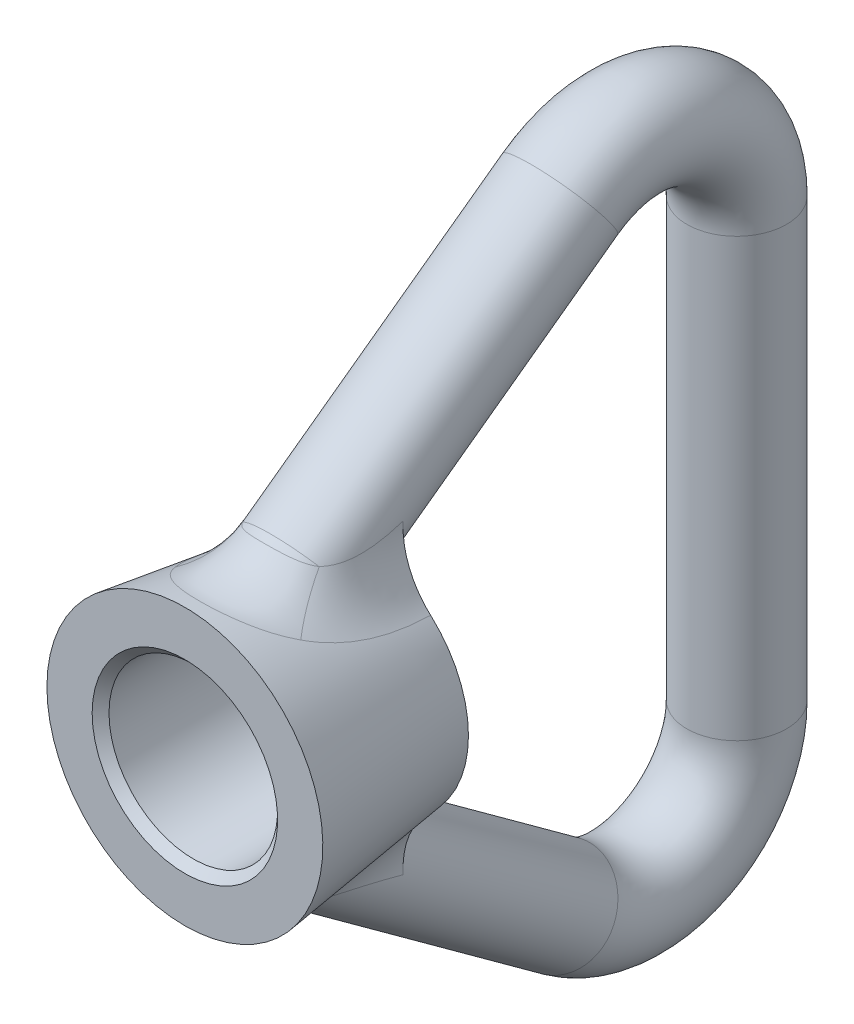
ISO-10303-21;
HEADER;
FILE_DESCRIPTION(('STEP AP214'),'2;1');
FILE_NAME('part.step','',(''),(''),'','','');
FILE_SCHEMA(('AUTOMOTIVE_DESIGN { 1 0 10303 214 1 1 1 1 }'));
ENDSEC;
DATA;
#1=APPLICATION_CONTEXT('core data for automotive mechanical design processes');
#2=APPLICATION_PROTOCOL_DEFINITION('international standard','automotive_design',2000,#1);
#3=PRODUCT_CONTEXT('',#1,'mechanical');
#4=PRODUCT('Part','Part','',(#3));
#5=PRODUCT_RELATED_PRODUCT_CATEGORY('part','',(#4));
#6=PRODUCT_DEFINITION_FORMATION('','',#4);
#7=PRODUCT_DEFINITION_CONTEXT('part definition',#1,'design');
#8=PRODUCT_DEFINITION('design','',#6,#7);
#9=PRODUCT_DEFINITION_SHAPE('','',#8);
#10=(LENGTH_UNIT() NAMED_UNIT(*) SI_UNIT(.MILLI.,.METRE.));
#11=(NAMED_UNIT(*) PLANE_ANGLE_UNIT() SI_UNIT($,.RADIAN.));
#12=(NAMED_UNIT(*) SI_UNIT($,.STERADIAN.) SOLID_ANGLE_UNIT());
#13=UNCERTAINTY_MEASURE_WITH_UNIT(LENGTH_MEASURE(1.E-05),#10,'distance_accuracy_value','');
#14=(GEOMETRIC_REPRESENTATION_CONTEXT(3) GLOBAL_UNCERTAINTY_ASSIGNED_CONTEXT((#13)) GLOBAL_UNIT_ASSIGNED_CONTEXT((#10,
#11,#12)) REPRESENTATION_CONTEXT('',''));
#15=CARTESIAN_POINT('',(0.,0.,0.));
#16=DIRECTION('',(0.,0.,1.));
#17=DIRECTION('',(1.,0.,0.));
#18=AXIS2_PLACEMENT_3D('',#15,#16,#17);
#19=CARTESIAN_POINT('',(0.,0.,0.));
#20=DIRECTION('',(0.,0.,-1.));
#21=DIRECTION('',(-1.,0.,0.));
#22=AXIS2_PLACEMENT_3D('',#19,#20,#21);
#23=PLANE('',#22);
#24=CARTESIAN_POINT('',(0.,0.,0.));
#25=DIRECTION('',(0.,0.,-1.));
#26=DIRECTION('',(-1.,0.,0.));
#27=AXIS2_PLACEMENT_3D('',#24,#25,#26);
#28=CIRCLE('',#27,12.1);
#29=CARTESIAN_POINT('',(-12.1,0.,0.));
#30=VERTEX_POINT('',#29);
#31=EDGE_CURVE('E47',#30,#30,#28,.T.);
#32=ORIENTED_EDGE('',*,*,#31,.T.);
#33=EDGE_LOOP('',(#32));
#34=FACE_BOUND('',#33,.T.);
#35=CARTESIAN_POINT('',(0.,0.,0.));
#36=DIRECTION('',(0.,0.,-1.));
#37=DIRECTION('',(-1.,0.,0.));
#38=AXIS2_PLACEMENT_3D('',#35,#36,#37);
#39=CIRCLE('',#38,18.);
#40=CARTESIAN_POINT('',(-18.,0.,0.));
#41=VERTEX_POINT('',#40);
#42=EDGE_CURVE('E122',#41,#41,#39,.T.);
#43=ORIENTED_EDGE('',*,*,#42,.F.);
#44=EDGE_LOOP('',(#43));
#45=FACE_BOUND('',#44,.T.);
#46=ADVANCED_FACE('F41',(#34,#45),#23,.F.);
#47=CARTESIAN_POINT('',(0.,0.,0.));
#48=DIRECTION('',(0.,0.,1.));
#49=DIRECTION('',(1.,0.,0.));
#50=AXIS2_PLACEMENT_3D('',#47,#48,#49);
#51=CONICAL_SURFACE('',#50,18.,0.135527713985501);
#52=CARTESIAN_POINT('',(0.,0.,-22.));
#53=DIRECTION('',(0.,0.,-1.));
#54=DIRECTION('',(-1.,0.,0.));
#55=AXIS2_PLACEMENT_3D('',#52,#53,#54);
#56=CIRCLE('',#55,15.);
#57=CARTESIAN_POINT('',(-10.0690193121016,-11.1182215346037,-22.));
#58=VERTEX_POINT('',#57);
#59=CARTESIAN_POINT('',(-10.0690193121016,11.1182215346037,-22.));
#60=VERTEX_POINT('',#59);
#61=EDGE_CURVE('E125',#58,#60,#56,.T.);
#62=ORIENTED_EDGE('',*,*,#61,.F.);
#63=CARTESIAN_POINT('',(-8.32269480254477,-10.5355533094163,-33.540575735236));
#64=CARTESIAN_POINT('',(-2.09751817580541,-15.8580531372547,-31.2109370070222));
#65=CARTESIAN_POINT('',(-5.60071798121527,-23.6011598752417,-31.7409692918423));
#66=CARTESIAN_POINT('',(-8.44234776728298,-10.5400195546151,-32.9709011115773));
#67=CARTESIAN_POINT('',(-2.36520279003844,-15.7880249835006,-30.8011278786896));
#68=CARTESIAN_POINT('',(-5.66671893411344,-23.4063787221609,-31.2829659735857));
#69=CARTESIAN_POINT('',(-8.557975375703,-10.5470357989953,-32.3981540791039));
#70=CARTESIAN_POINT('',(-2.62401272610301,-15.7180152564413,-30.3763991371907));
#71=CARTESIAN_POINT('',(-5.72955782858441,-23.2137232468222,-30.8241048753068));
#72=CARTESIAN_POINT('',(-8.78073499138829,-10.5672348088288,-31.2470058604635));
#73=CARTESIAN_POINT('',(-3.11873882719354,-15.5812226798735,-29.5086741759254));
#74=CARTESIAN_POINT('',(-5.84878884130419,-22.8337896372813,-29.9055480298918));
#75=CARTESIAN_POINT('',(-8.8878643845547,-10.5804194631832,-30.6686029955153));
#76=CARTESIAN_POINT('',(-3.35532321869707,-15.5143024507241,-29.0653980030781));
#77=CARTESIAN_POINT('',(-5.90517897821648,-22.6465131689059,-29.4458520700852));
#78=CARTESIAN_POINT('',(-9.09384981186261,-10.6141417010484,-29.5027896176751));
#79=CARTESIAN_POINT('',(-3.80777072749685,-15.3848714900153,-28.161114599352));
#80=CARTESIAN_POINT('',(-6.01173252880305,-22.2772559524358,-28.5234700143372));
#81=CARTESIAN_POINT('',(-9.19264051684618,-10.6347316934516,-28.9153442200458));
#82=CARTESIAN_POINT('',(-4.02408919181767,-15.3222411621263,-27.6996127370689));
#83=CARTESIAN_POINT('',(-6.06184803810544,-22.0953232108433,-28.0607862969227));
#84=CARTESIAN_POINT('',(-9.38026595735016,-10.6844988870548,-27.7363646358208));
#85=CARTESIAN_POINT('',(-4.43441575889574,-15.203549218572,-26.7650497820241));
#86=CARTESIAN_POINT('',(-6.15502395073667,-21.7395600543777,-27.1369543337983));
#87=CARTESIAN_POINT('',(-9.46910150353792,-10.7136753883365,-27.1448307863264));
#88=CARTESIAN_POINT('',(-4.62894499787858,-15.1473353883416,-26.2915976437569));
#89=CARTESIAN_POINT('',(-6.19808492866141,-21.5657289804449,-26.6758059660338));
#90=CARTESIAN_POINT('',(-9.63769693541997,-10.7827953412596,-25.9446269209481));
#91=CARTESIAN_POINT('',(-4.99992903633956,-15.0418881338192,-25.3249243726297));
#92=CARTESIAN_POINT('',(-6.27756152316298,-21.2237130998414,-25.7455728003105));
#93=CARTESIAN_POINT('',(-9.71719556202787,-10.8229749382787,-25.3358800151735));
#94=CARTESIAN_POINT('',(-5.17638788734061,-14.9926750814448,-24.8309117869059));
#95=CARTESIAN_POINT('',(-6.31379789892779,-21.0557558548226,-25.2765550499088));
#96=CARTESIAN_POINT('',(-9.86311416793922,-10.9153926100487,-24.1161574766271));
#97=CARTESIAN_POINT('',(-5.50546227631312,-14.9045824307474,-23.8367523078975));
#98=CARTESIAN_POINT('',(-6.37757224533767,-20.7317104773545,-24.3431397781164));
#99=CARTESIAN_POINT('',(-9.9295324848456,-10.9676322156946,-23.5051815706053));
#100=CARTESIAN_POINT('',(-5.65850550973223,-14.8655481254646,-23.3361089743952));
#101=CARTESIAN_POINT('',(-6.40510911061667,-20.5756238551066,-23.8787428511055));
#102=CARTESIAN_POINT('',(-10.047126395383,-11.0856954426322,-22.2845676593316));
#103=CARTESIAN_POINT('',(-5.9393625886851,-14.7996759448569,-22.3334202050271));
#104=CARTESIAN_POINT('',(-6.45037838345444,-20.2778173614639,-22.9580855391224));
#105=CARTESIAN_POINT('',(-10.0983461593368,-11.1514787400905,-21.6749309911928));
#106=CARTESIAN_POINT('',(-6.06762211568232,-14.7726586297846,-21.8308749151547));
#107=CARTESIAN_POINT('',(-6.46813933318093,-20.1360566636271,-22.5018052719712));
#108=CARTESIAN_POINT('',(-10.1833412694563,-11.298383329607,-20.4577198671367));
#109=CARTESIAN_POINT('',(-6.29801377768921,-14.7323400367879,-20.8266711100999));
#110=CARTESIAN_POINT('',(-6.49267751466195,-19.8686252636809,-21.5987126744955));
#111=CARTESIAN_POINT('',(-10.2171236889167,-11.3794983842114,-19.850144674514));
#112=CARTESIAN_POINT('',(-6.40048508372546,-14.7189039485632,-20.3244666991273));
#113=CARTESIAN_POINT('',(-6.49945920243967,-19.7429480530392,-21.1518965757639));
#114=CARTESIAN_POINT('',(-10.2608579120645,-11.5454415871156,-18.7287999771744));
#115=CARTESIAN_POINT('',(-6.56462082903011,-14.7080489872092,-19.3978224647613));
#116=CARTESIAN_POINT('',(-6.5004038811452,-19.5269989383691,-20.3353729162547));
#117=CARTESIAN_POINT('',(-10.2735787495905,-11.6279791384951,-18.2143454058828));
#118=CARTESIAN_POINT('',(-6.63018854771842,-14.7085007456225,-18.9727884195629));
#119=CARTESIAN_POINT('',(-6.49627217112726,-19.434237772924,-19.9639698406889));
#120=CARTESIAN_POINT('',(-10.2820970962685,-11.8060368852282,-17.1915369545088));
#121=CARTESIAN_POINT('',(-6.73974472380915,-14.721113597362,-18.1291384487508));
#122=CARTESIAN_POINT('',(-6.47775983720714,-19.263391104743,-19.2324595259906));
#123=CARTESIAN_POINT('',(-10.2778932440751,-11.9015581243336,-16.6831835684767));
#124=CARTESIAN_POINT('',(-6.78388020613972,-14.7332231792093,-17.7101606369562));
#125=CARTESIAN_POINT('',(-6.46337838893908,-19.1853067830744,-18.872353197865));
#126=CARTESIAN_POINT('',(-10.250369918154,-12.105410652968,-15.6781699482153));
#127=CARTESIAN_POINT('',(-6.84905402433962,-14.7694109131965,-16.8840448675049));
#128=CARTESIAN_POINT('',(-6.42327155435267,-19.0453529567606,-18.1677432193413));
#129=CARTESIAN_POINT('',(-10.2271428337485,-12.2136778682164,-15.1814651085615));
#130=CARTESIAN_POINT('',(-6.87032019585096,-14.7933958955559,-16.4765080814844));
#131=CARTESIAN_POINT('',(-6.397601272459,-18.9834069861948,-17.8231726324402));
#132=CARTESIAN_POINT('',(-10.1594363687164,-12.4431647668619,-14.200857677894));
#133=CARTESIAN_POINT('',(-6.88892285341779,-14.8531678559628,-15.674876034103));
#134=CARTESIAN_POINT('',(-6.33375553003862,-18.8760763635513,-17.150509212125));
#135=CARTESIAN_POINT('',(-10.1149583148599,-12.5643836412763,-13.7169542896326));
#136=CARTESIAN_POINT('',(-6.88634654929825,-14.8889381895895,-15.2804292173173));
#137=CARTESIAN_POINT('',(-6.29558085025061,-18.8306906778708,-16.822415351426));
#138=CARTESIAN_POINT('',(-10.0019271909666,-12.8204995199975,-12.7598574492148));
#139=CARTESIAN_POINT('',(-6.85618457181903,-14.9720830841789,-14.5038706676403));
#140=CARTESIAN_POINT('',(-6.20507784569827,-18.7563273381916,-16.1813085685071));
#141=CARTESIAN_POINT('',(-9.93307410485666,-12.9555513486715,-12.2868795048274));
#142=CARTESIAN_POINT('',(-6.82833259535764,-15.0196042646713,-14.1216263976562));
#143=CARTESIAN_POINT('',(-6.15257510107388,-18.7275664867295,-15.868541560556));
#144=CARTESIAN_POINT('',(-9.76959138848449,-13.2362791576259,-11.3624058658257));
#145=CARTESIAN_POINT('',(-6.7467879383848,-15.1245846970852,-13.3786666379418));
#146=CARTESIAN_POINT('',(-6.03274670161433,-18.6869911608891,-15.2651526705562));
#147=CARTESIAN_POINT('',(-9.67495772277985,-13.3819567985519,-10.9109135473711));
#148=CARTESIAN_POINT('',(-6.69310810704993,-15.1820657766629,-13.0176455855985));
#149=CARTESIAN_POINT('',(-5.96541872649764,-18.6751793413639,-14.9745342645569));
#150=CARTESIAN_POINT('',(-9.45887595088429,-13.6811249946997,-10.034275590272));
#151=CARTESIAN_POINT('',(-6.56035250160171,-15.3047944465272,-12.3211458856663));
#152=CARTESIAN_POINT('',(-5.81551665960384,-18.6673514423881,-14.4179250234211));
#153=CARTESIAN_POINT('',(-9.33746419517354,-13.8346047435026,-9.60909522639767));
#154=CARTESIAN_POINT('',(-6.48129489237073,-15.3700636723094,-11.9853741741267));
#155=CARTESIAN_POINT('',(-5.73296326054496,-18.6713140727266,-14.1519014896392));
#156=CARTESIAN_POINT('',(-9.06735603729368,-14.1462393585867,-8.78827144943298));
#157=CARTESIAN_POINT('',(-6.29892491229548,-15.5058425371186,-11.3417297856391));
#158=CARTESIAN_POINT('',(-5.55246924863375,-18.6930660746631,-13.6454936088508));
#159=CARTESIAN_POINT('',(-8.91867883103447,-14.3043908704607,-8.39260752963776));
#160=CARTESIAN_POINT('',(-6.19558740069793,-15.5763859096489,-11.033635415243));
#161=CARTESIAN_POINT('',(-5.45453946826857,-18.7108457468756,-13.4050914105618));
#162=CARTESIAN_POINT('',(-8.67399378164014,-14.5438456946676,-7.81980317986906));
#163=CARTESIAN_POINT('',(-6.02274891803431,-15.6847024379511,-10.5909715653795));
#164=CARTESIAN_POINT('',(-5.29538285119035,-18.7461778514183,-13.0619295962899));
#165=CARTESIAN_POINT('',(-8.58792734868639,-14.6247887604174,-7.63067977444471));
#166=CARTESIAN_POINT('',(-5.96150443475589,-15.721583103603,-10.445387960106));
#167=CARTESIAN_POINT('',(-5.23971764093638,-18.7595631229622,-12.9495004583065));
#168=CARTESIAN_POINT('',(-8.40900719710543,-14.7863795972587,-7.26119949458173));
#169=CARTESIAN_POINT('',(-5.83355602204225,-15.7955928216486,-10.1620921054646));
#170=CARTESIAN_POINT('',(-5.12460772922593,-18.7888627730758,-12.731452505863));
#171=CARTESIAN_POINT('',(-8.31615945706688,-14.86702756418,-7.08083512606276));
#172=CARTESIAN_POINT('',(-5.76684872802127,-15.8327258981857,-10.0243581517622));
#173=CARTESIAN_POINT('',(-5.06516636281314,-18.8047749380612,-12.625827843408));
#174=CARTESIAN_POINT('',(-8.05230894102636,-15.0872212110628,-6.59827431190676));
#175=CARTESIAN_POINT('',(-5.57675572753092,-15.9344690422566,-9.65731308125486));
#176=CARTESIAN_POINT('',(-4.89702383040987,-18.8513647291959,-12.3452706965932));
#177=CARTESIAN_POINT('',(-7.87445794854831,-15.2260424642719,-6.30503975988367));
#178=CARTESIAN_POINT('',(-5.4480558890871,-15.9990096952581,-9.43594492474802));
#179=CARTESIAN_POINT('',(-4.78451397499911,-18.8842340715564,-12.1771004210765));
#180=CARTESIAN_POINT('',(-7.4994105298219,-15.4989316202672,-5.74614392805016));
#181=CARTESIAN_POINT('',(-5.17669667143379,-16.1261013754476,-9.01701255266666));
#182=CARTESIAN_POINT('',(-4.54878955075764,-18.9543884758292,-11.8603837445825));
#183=CARTESIAN_POINT('',(-7.30220010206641,-15.6329959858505,-5.48050289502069));
#184=CARTESIAN_POINT('',(-5.03398634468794,-16.1886638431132,-8.81943574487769));
#185=CARTESIAN_POINT('',(-4.42556724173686,-18.9916767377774,-11.7118517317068));
#186=CARTESIAN_POINT('',(-6.88845442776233,-15.894735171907,-4.97566058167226));
#187=CARTESIAN_POINT('',(-4.73555256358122,-16.3106368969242,-8.44658575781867));
#188=CARTESIAN_POINT('',(-4.1683824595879,-19.068804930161,-11.4327507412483));
#189=CARTESIAN_POINT('',(-6.67179088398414,-16.0223573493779,-4.7366623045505));
#190=CARTESIAN_POINT('',(-4.5797103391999,-16.3700272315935,-8.27147737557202));
#191=CARTESIAN_POINT('',(-4.03434938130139,-19.1086612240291,-11.3023180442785));
#192=CARTESIAN_POINT('',(-6.22223109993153,-16.2678371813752,-4.28760165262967));
#193=CARTESIAN_POINT('',(-4.25793915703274,-16.483900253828,-7.94469018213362));
#194=CARTESIAN_POINT('',(-3.75739454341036,-19.1886540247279,-11.0598361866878));
#195=CARTESIAN_POINT('',(-5.98934675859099,-16.3857018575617,-4.07751839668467));
#196=CARTESIAN_POINT('',(-4.09199437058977,-16.5383858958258,-7.79300581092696));
#197=CARTESIAN_POINT('',(-3.61447930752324,-19.228790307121,-10.9477737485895));
#198=CARTESIAN_POINT('',(-5.74912899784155,-16.497615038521,-3.88186331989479));
#199=CARTESIAN_POINT('',(-3.92203918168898,-16.5897834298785,-7.6527496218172));
#200=CARTESIAN_POINT('',(-3.46756209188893,-19.2680832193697,-10.8443787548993));
#201=(BOUNDED_SURFACE() B_SPLINE_SURFACE(3,2,((#63,#64,#65),(#66,#67,#68),(#69,#70,#71),(#72,
#73,#74),(#75,#76,#77),(#78,#79,#80),(#81,#82,#83),(#84,#85,#86),(#87,#88,#89),(#90,#91,#92),
(#93,#94,#95),(#96,#97,#98),(#99,#100,#101),(#102,#103,#104),(#105,#106,#107),(#108,#109,#110),
(#111,#112,#113),(#114,#115,#116),(#117,#118,#119),(#120,#121,#122),(#123,#124,#125),(#126,#127,
#128),(#129,#130,#131),(#132,#133,#134),(#135,#136,#137),(#138,#139,#140),(#141,#142,#143),
(#144,#145,#146),(#147,#148,#149),(#150,#151,#152),(#153,#154,#155),(#156,#157,#158),(#159,#160,
#161),(#162,#163,#164),(#165,#166,#167),(#168,#169,#170),(#171,#172,#173),(#174,#175,#176),
(#177,#178,#179),(#180,#181,#182),(#183,#184,#185),(#186,#187,#188),(#189,#190,#191),(#192,#193,
#194),(#195,#196,#197),(#198,#199,#200)),.UNSPECIFIED.,.F.,.F.,
.F.) B_SPLINE_SURFACE_WITH_KNOTS((4,2,2,2,2,2,2,2,2,2,2,2,2,2,2,2,2,2,2,2,2,2,4),(3,3),(0.,
1.794505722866,3.58956132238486,5.39757923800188,7.20544981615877,9.05565814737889,
10.9061014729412,12.7511131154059,14.5953757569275,16.1690704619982,17.742891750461,
19.3091145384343,20.8752395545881,22.4613524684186,24.047713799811,25.6319348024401,
27.2150447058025,28.0215466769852,28.8273460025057,30.2313751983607,31.6364274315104,
33.0515433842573,34.4656319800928),(0.,1.),
.UNSPECIFIED.) GEOMETRIC_REPRESENTATION_ITEM() RATIONAL_B_SPLINE_SURFACE(((1.,0.790755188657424,
1.),(1.,0.797699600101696,1.),(1.,0.804369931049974,1.),(1.,0.817186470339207,1.),(1.,
0.823332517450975,1.),(1.,0.835162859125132,1.),(1.,0.840843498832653,1.),(1.,0.851709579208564,
1.),(1.,0.856895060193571,1.),(1.,0.866899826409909,1.),(1.,0.871707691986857,1.),(1.,
0.880827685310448,1.),(1.,0.885139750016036,1.),(1.,0.8932592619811,1.),(1.,0.89706815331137,
1.),(1.,0.904194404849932,1.),(1.,0.907511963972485,1.),(1.,0.913203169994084,1.),(1.,
0.91564389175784,1.),(1.,0.920164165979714,1.),(1.,0.92224368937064,1.),(1.,0.926030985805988,
1.),(1.,0.92774050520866,1.),(1.,0.930802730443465,1.),(1.,0.932155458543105,1.),(1.,
0.934527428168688,1.),(1.,0.935542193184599,1.),(1.,0.937231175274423,1.),(1.,0.937905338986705,
1.),(1.,0.93893890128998,1.),(1.,0.93929872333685,1.),(1.,0.939741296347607,1.),(1.,
0.939824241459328,1.),(1.,0.939774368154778,1.),(1.,0.939727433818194,1.),(1.,0.939579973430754,
1.),(1.,0.939479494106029,1.),(1.,0.939139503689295,1.),(1.,0.938852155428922,1.),(1.,
0.938170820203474,1.),(1.,0.937776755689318,1.),(1.,0.936915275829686,1.),(1.,0.936447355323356,
1.),(1.,0.935475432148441,1.),(1.,0.934971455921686,1.),(1.,0.934466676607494,1.))) REPRESENTATION_ITEM('') SURFACE());
#202=CARTESIAN_POINT('',(-8.32269480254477,-10.5355533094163,-33.540575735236));
#203=CARTESIAN_POINT('',(-8.44234776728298,-10.5400195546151,-32.9709011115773));
#204=CARTESIAN_POINT('',(-8.557975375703,-10.5470357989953,-32.3981540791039));
#205=CARTESIAN_POINT('',(-8.78073499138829,-10.5672348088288,-31.2470058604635));
#206=CARTESIAN_POINT('',(-8.88786438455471,-10.5804194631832,-30.6686029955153));
#207=CARTESIAN_POINT('',(-9.09384981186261,-10.6141417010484,-29.5027896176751));
#208=CARTESIAN_POINT('',(-9.19264051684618,-10.6347316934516,-28.9153442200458));
#209=CARTESIAN_POINT('',(-9.38026595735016,-10.6844988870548,-27.7363646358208));
#210=CARTESIAN_POINT('',(-9.46910150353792,-10.7136753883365,-27.1448307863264));
#211=CARTESIAN_POINT('',(-9.63769693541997,-10.7827953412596,-25.9446269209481));
#212=CARTESIAN_POINT('',(-9.71719556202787,-10.8229749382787,-25.3358800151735));
#213=CARTESIAN_POINT('',(-9.86311416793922,-10.9153926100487,-24.1161574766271));
#214=CARTESIAN_POINT('',(-9.9295324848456,-10.9676322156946,-23.5051815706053));
#215=CARTESIAN_POINT('',(-10.047126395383,-11.0856954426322,-22.2845676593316));
#216=CARTESIAN_POINT('',(-10.0983461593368,-11.1514787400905,-21.6749309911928));
#217=CARTESIAN_POINT('',(-10.1833412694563,-11.298383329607,-20.4577198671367));
#218=CARTESIAN_POINT('',(-10.2171236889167,-11.3794983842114,-19.850144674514));
#219=CARTESIAN_POINT('',(-10.2608579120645,-11.5454415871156,-18.7287999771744));
#220=CARTESIAN_POINT('',(-10.2735787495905,-11.6279791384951,-18.2143454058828));
#221=CARTESIAN_POINT('',(-10.2820970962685,-11.8060368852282,-17.1915369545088));
#222=CARTESIAN_POINT('',(-10.2778932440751,-11.9015581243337,-16.6831835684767));
#223=CARTESIAN_POINT('',(-10.250369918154,-12.105410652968,-15.6781699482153));
#224=CARTESIAN_POINT('',(-10.2271428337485,-12.2136778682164,-15.1814651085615));
#225=CARTESIAN_POINT('',(-10.1594363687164,-12.4431647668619,-14.200857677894));
#226=CARTESIAN_POINT('',(-10.1149583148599,-12.5643836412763,-13.7169542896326));
#227=CARTESIAN_POINT('',(-10.0019271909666,-12.8204995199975,-12.7598574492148));
#228=CARTESIAN_POINT('',(-9.93307410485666,-12.9555513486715,-12.2868795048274));
#229=CARTESIAN_POINT('',(-9.76959138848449,-13.2362791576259,-11.3624058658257));
#230=CARTESIAN_POINT('',(-9.67495772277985,-13.3819567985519,-10.9109135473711));
#231=CARTESIAN_POINT('',(-9.45887595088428,-13.6811249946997,-10.034275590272));
#232=CARTESIAN_POINT('',(-9.33746419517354,-13.8346047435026,-9.60909522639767));
#233=CARTESIAN_POINT('',(-9.06735603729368,-14.1462393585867,-8.78827144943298));
#234=CARTESIAN_POINT('',(-8.91867883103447,-14.3043908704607,-8.39260752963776));
#235=CARTESIAN_POINT('',(-8.67399378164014,-14.5438456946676,-7.81980317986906));
#236=CARTESIAN_POINT('',(-8.58792734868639,-14.6247887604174,-7.63067977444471));
#237=CARTESIAN_POINT('',(-8.40900719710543,-14.7863795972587,-7.26119949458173));
#238=CARTESIAN_POINT('',(-8.31615945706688,-14.86702756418,-7.08083512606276));
#239=CARTESIAN_POINT('',(-8.05230894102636,-15.0872212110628,-6.59827431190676));
#240=CARTESIAN_POINT('',(-7.87445794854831,-15.2260424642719,-6.30503975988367));
#241=CARTESIAN_POINT('',(-7.4994105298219,-15.4989316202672,-5.74614392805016));
#242=CARTESIAN_POINT('',(-7.30220010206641,-15.6329959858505,-5.48050289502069));
#243=CARTESIAN_POINT('',(-6.88845442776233,-15.894735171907,-4.97566058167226));
#244=CARTESIAN_POINT('',(-6.67179088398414,-16.0223573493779,-4.7366623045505));
#245=CARTESIAN_POINT('',(-6.22223109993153,-16.2678371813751,-4.28760165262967));
#246=CARTESIAN_POINT('',(-5.98934675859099,-16.3857018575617,-4.07751839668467));
#247=CARTESIAN_POINT('',(-5.74912899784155,-16.497615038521,-3.88186331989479));
#248=B_SPLINE_CURVE_WITH_KNOTS('',3,(#202,#203,#204,#205,#206,#207,#208,#209,#210,#211,#212,
#213,#214,#215,#216,#217,#218,#219,#220,#221,#222,#223,#224,#225,#226,#227,#228,#229,#230,#231,
#232,#233,#234,#235,#236,#237,#238,#239,#240,#241,#242,#243,#244,#245,#246,#247),.UNSPECIFIED.,
.F.,.F.,(4,2,2,2,2,2,2,2,2,2,2,2,2,2,2,2,2,2,2,2,2,2,4),(0.,1.794505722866,3.58956132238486,
5.39757923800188,7.20544981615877,9.05565814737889,10.9061014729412,12.7511131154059,
14.5953757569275,16.1690704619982,17.742891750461,19.3091145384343,20.8752395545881,
22.4613524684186,24.047713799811,25.6319348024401,27.2150447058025,28.0215466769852,
28.8273460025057,30.2313751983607,31.6364274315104,33.0515433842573,34.4656319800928),.UNSPECIFIED.);
#249=CARTESIAN_POINT('',(-8.21994811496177,-14.9473197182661,-6.90487252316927));
#250=VERTEX_POINT('',#249);
#251=EDGE_CURVE('E373',#58,#250,#248,.T.);
#252=ORIENTED_EDGE('',*,*,#251,.T.);
#253=CARTESIAN_POINT('',(-9.6498327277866,-13.390400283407,-10.9617635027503));
#254=CARTESIAN_POINT('',(-6.78424289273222,-15.1316509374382,-12.8884521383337));
#255=CARTESIAN_POINT('',(-5.95104689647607,-18.4351869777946,-14.7182395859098));
#256=CARTESIAN_POINT('',(-9.61037396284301,-13.4508578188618,-10.7712424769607));
#257=CARTESIAN_POINT('',(-6.75687277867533,-15.1593692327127,-12.7408468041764));
#258=CARTESIAN_POINT('',(-5.92298708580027,-18.4414233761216,-14.6041967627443));
#259=CARTESIAN_POINT('',(-9.56843769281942,-13.5122197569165,-10.5829632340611));
#260=CARTESIAN_POINT('',(-6.72710103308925,-15.1877309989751,-12.5959432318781));
#261=CARTESIAN_POINT('',(-5.89350675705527,-18.4490922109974,-14.4932200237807));
#262=CARTESIAN_POINT('',(-9.47951252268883,-13.636540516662,-10.2111974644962));
#263=CARTESIAN_POINT('',(-6.66281950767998,-15.2455665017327,-12.3116654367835));
#264=CARTESIAN_POINT('',(-5.83165960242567,-18.4672037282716,-14.277195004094));
#265=CARTESIAN_POINT('',(-9.43252341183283,-13.6994994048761,-10.0277111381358));
#266=CARTESIAN_POINT('',(-6.62830509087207,-15.2750442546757,-12.1722720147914));
#267=CARTESIAN_POINT('',(-5.79929265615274,-18.477646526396,-14.1721469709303));
#268=CARTESIAN_POINT('',(-9.28388142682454,-13.8903870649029,-9.48509610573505));
#269=CARTESIAN_POINT('',(-6.51775978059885,-15.3648757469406,-11.7626131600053));
#270=CARTESIAN_POINT('',(-5.6978286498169,-18.5129874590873,-13.8656986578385));
#271=CARTESIAN_POINT('',(-9.17451760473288,-14.0203831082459,-9.13363466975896));
#272=CARTESIAN_POINT('',(-6.43468315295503,-15.4266655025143,-11.5006888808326));
#273=CARTESIAN_POINT('',(-5.6243425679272,-18.5419040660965,-13.6728891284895));
#274=CARTESIAN_POINT('',(-8.93571938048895,-14.2830222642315,-8.4550776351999));
#275=CARTESIAN_POINT('',(-6.25147192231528,-15.5520165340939,-11.0009516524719));
#276=CARTESIAN_POINT('',(-5.46609008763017,-18.6087652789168,-13.3094486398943));
#277=CARTESIAN_POINT('',(-8.80636598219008,-14.4156528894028,-8.12789125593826));
#278=CARTESIAN_POINT('',(-6.15135135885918,-15.6155996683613,-10.762952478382));
#279=CARTESIAN_POINT('',(-5.38136940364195,-18.6466737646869,-13.1387330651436));
#280=CARTESIAN_POINT('',(-8.52780826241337,-14.681598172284,-7.4978771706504));
#281=CARTESIAN_POINT('',(-5.9355922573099,-15.7429759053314,-10.3097527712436));
#282=CARTESIAN_POINT('',(-5.20080450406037,-18.7295149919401,-12.8168691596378));
#283=CARTESIAN_POINT('',(-8.37860392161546,-14.8149128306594,-7.19504948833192));
#284=CARTESIAN_POINT('',(-5.81989698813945,-15.8067919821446,-10.0944981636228));
#285=CARTESIAN_POINT('',(-5.10496027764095,-18.7744477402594,-12.6657208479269));
#286=CARTESIAN_POINT('',(-8.05475060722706,-15.0851860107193,-6.60273097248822));
#287=CARTESIAN_POINT('',(-5.56996239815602,-15.9355407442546,-9.67786765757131));
#288=CARTESIAN_POINT('',(-4.89857952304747,-18.8710303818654,-12.3754651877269));
#289=CARTESIAN_POINT('',(-7.8793061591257,-15.2220681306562,-6.31430487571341));
#290=CARTESIAN_POINT('',(-5.43510575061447,-16.0004225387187,-9.47742134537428));
#291=CARTESIAN_POINT('',(-4.78760014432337,-18.9228808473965,-12.2371112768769));
#292=CARTESIAN_POINT('',(-7.50931211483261,-15.4911792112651,-5.76534678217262));
#293=CARTESIAN_POINT('',(-5.1531233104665,-16.1269261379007,-9.09981588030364));
#294=CARTESIAN_POINT('',(-4.55506762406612,-19.0292295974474,-11.9780553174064));
#295=CARTESIAN_POINT('',(-7.31476077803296,-15.6234077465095,-5.50481733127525));
#296=CARTESIAN_POINT('',(-5.00595021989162,-16.188552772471,-8.92266766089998));
#297=CARTESIAN_POINT('',(-4.4335135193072,-19.0837281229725,-11.8573548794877));
#298=CARTESIAN_POINT('',(-6.90804804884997,-15.88081655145,-5.01159811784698));
#299=CARTESIAN_POINT('',(-4.70150307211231,-16.307269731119,-8.59049976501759));
#300=CARTESIAN_POINT('',(-4.18070071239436,-19.1930728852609,-11.6319968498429));
#301=CARTESIAN_POINT('',(-6.69587639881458,-16.0059926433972,-4.7789247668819));
#302=CARTESIAN_POINT('',(-4.54419313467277,-16.3643528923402,-8.43552368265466));
#303=CARTESIAN_POINT('',(-4.04943636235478,-19.2479193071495,-11.5273487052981));
#304=CARTESIAN_POINT('',(-6.2557549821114,-16.2470189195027,-4.34142367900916));
#305=CARTESIAN_POINT('',(-4.22159404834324,-16.4729785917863,-8.14668187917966));
#306=CARTESIAN_POINT('',(-3.77825736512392,-19.3558653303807,-11.3328486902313));
#307=CARTESIAN_POINT('',(-6.02780558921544,-16.3628693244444,-4.13659528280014));
#308=CARTESIAN_POINT('',(-4.05629241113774,-16.5245095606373,-8.0128591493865));
#309=CARTESIAN_POINT('',(-3.63834292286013,-19.4089649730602,-11.242996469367));
#310=CARTESIAN_POINT('',(-5.55857136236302,-16.583037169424,-3.75500484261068));
#311=CARTESIAN_POINT('',(-3.7199472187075,-16.6212474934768,-7.76553651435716));
#312=CARTESIAN_POINT('',(-3.3512703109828,-19.5115101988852,-11.0772032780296));
#313=CARTESIAN_POINT('',(-5.31732477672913,-16.6873853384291,-3.57816743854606));
#314=CARTESIAN_POINT('',(-3.54892421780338,-16.6664553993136,-7.65203063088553));
#315=CARTESIAN_POINT('',(-3.20413303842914,-19.5609653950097,-11.001224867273));
#316=CARTESIAN_POINT('',(-4.822767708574,-16.8832929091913,-3.25155473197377));
#317=CARTESIAN_POINT('',(-3.20219893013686,-16.7503207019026,-7.4438588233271));
#318=CARTESIAN_POINT('',(-2.90328602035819,-19.6549120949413,-10.8619830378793));
#319=CARTESIAN_POINT('',(-4.56945724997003,-16.9748523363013,-3.10177937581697));
#320=CARTESIAN_POINT('',(-3.02651656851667,-16.7889597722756,-7.34924292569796));
#321=CARTESIAN_POINT('',(-2.74957628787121,-19.6994036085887,-10.7987195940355));
#322=CARTESIAN_POINT('',(-4.05261767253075,-17.1438350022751,-2.82895756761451));
#323=CARTESIAN_POINT('',(-2.67167758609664,-16.8594908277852,-7.17792358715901));
#324=CARTESIAN_POINT('',(-2.43660024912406,-19.7822231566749,-10.6841908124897));
#325=CARTESIAN_POINT('',(-3.7890873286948,-17.22125654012,-2.7059143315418));
#326=CARTESIAN_POINT('',(-2.49255386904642,-16.891363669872,-7.10126922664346));
#327=CARTESIAN_POINT('',(-2.27733327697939,-19.8205504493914,-10.6329269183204));
#328=CARTESIAN_POINT('',(-3.25373846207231,-17.3608459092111,-2.48629959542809));
#329=CARTESIAN_POINT('',(-2.13183261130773,-16.9482896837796,-6.96510797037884));
#330=CARTESIAN_POINT('',(-1.95430141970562,-19.890075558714,-10.5418565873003));
#331=CARTESIAN_POINT('',(-2.98191952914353,-17.4230129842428,-2.38972940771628));
#332=CARTESIAN_POINT('',(-1.9502792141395,-16.9733258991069,-6.90564279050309));
#333=CARTESIAN_POINT('',(-1.79053631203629,-19.9212730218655,-10.5020507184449));
#334=CARTESIAN_POINT('',(-2.41971850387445,-17.5336280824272,-2.21913767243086));
#335=CARTESIAN_POINT('',(-1.57736840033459,-17.0175504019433,-6.80096316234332));
#336=CARTESIAN_POINT('',(-1.45221479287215,-19.9770108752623,-10.4319672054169));
#337=CARTESIAN_POINT('',(-2.12904812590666,-17.5813441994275,-2.14630802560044));
#338=CARTESIAN_POINT('',(-1.38600160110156,-17.0364133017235,-6.75653794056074));
#339=CARTESIAN_POINT('',(-1.27750213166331,-20.0011940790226,-10.402191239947));
#340=CARTESIAN_POINT('',(-1.54302529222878,-17.6584781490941,-2.0291071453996));
#341=CARTESIAN_POINT('',(-1.00211755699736,-17.0667619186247,-6.6851981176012));
#342=CARTESIAN_POINT('',(-0.925541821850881,-20.0403818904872,-10.3543731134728));
#343=CARTESIAN_POINT('',(-1.24767270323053,-17.6878954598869,-1.98473672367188));
#344=CARTESIAN_POINT('',(-0.80966755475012,-17.0782364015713,-6.65831005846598));
#345=CARTESIAN_POINT('',(-0.74829410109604,-20.0553862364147,-10.33633128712));
#346=CARTESIAN_POINT('',(-0.654560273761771,-17.7279989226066,-1.92434593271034));
#347=CARTESIAN_POINT('',(-0.424184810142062,-17.0938553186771,-6.62173347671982));
#348=CARTESIAN_POINT('',(-0.392496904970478,-20.0758584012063,-10.3117933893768));
#349=CARTESIAN_POINT('',(-0.356800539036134,-17.7386858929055,-1.90832432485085));
#350=CARTESIAN_POINT('',(-0.231223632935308,-17.0979942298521,-6.61205790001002));
#351=CARTESIAN_POINT('',(-0.213947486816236,-20.0813266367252,-10.3052968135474));
#352=CARTESIAN_POINT('',(0.238863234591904,-17.7411755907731,-1.90458735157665));
#353=CARTESIAN_POINT('',(0.15479934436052,-17.0989602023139,-6.60979872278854));
#354=CARTESIAN_POINT('',(0.143229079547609,-20.0825997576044,-10.3037806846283));
#355=CARTESIAN_POINT('',(0.536767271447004,-17.7329785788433,-1.91687159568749));
#356=CARTESIAN_POINT('',(0.347788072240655,-17.0957869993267,-6.61721574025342));
#357=CARTESIAN_POINT('',(0.321856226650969,-20.0784047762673,-10.3087609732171));
#358=CARTESIAN_POINT('',(1.13512090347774,-17.697543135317,-1.97019229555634));
#359=CARTESIAN_POINT('',(0.736415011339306,-17.0819983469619,-6.64949622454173));
#360=CARTESIAN_POINT('',(0.680762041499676,-20.0603083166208,-10.3304185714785));
#361=CARTESIAN_POINT('',(1.43553703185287,-17.6700077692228,-2.01167714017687));
#362=CARTESIAN_POINT('',(0.931973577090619,-17.0712721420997,-6.67461934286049));
#363=CARTESIAN_POINT('',(0.861022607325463,-20.0462554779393,-10.3472782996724));
#364=CARTESIAN_POINT('',(2.03181985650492,-17.5959922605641,-2.12398906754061));
#365=CARTESIAN_POINT('',(1.32212505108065,-17.042194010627,-6.74293279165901));
#366=CARTESIAN_POINT('',(1.21908138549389,-20.0086248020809,-10.3930733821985));
#367=CARTESIAN_POINT('',(2.32768645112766,-17.5495116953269,-2.19481680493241));
#368=CARTESIAN_POINT('',(1.51664678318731,-17.0238528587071,-6.78609770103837));
#369=CARTESIAN_POINT('',(1.39687954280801,-19.9850467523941,-10.4220090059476));
#370=CARTESIAN_POINT('',(2.91268705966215,-17.4382845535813,-2.36604838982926));
#371=CARTESIAN_POINT('',(1.90411027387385,-16.9794668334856,-6.89106823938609));
#372=CARTESIAN_POINT('',(1.74883815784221,-19.9289443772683,-10.4922972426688));
#373=CARTESIAN_POINT('',(3.20181707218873,-17.3735274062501,-2.46646935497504));
#374=CARTESIAN_POINT('',(2.09698720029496,-16.9534333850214,-6.95284663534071));
#375=CARTESIAN_POINT('',(1.92299644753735,-19.8964148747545,-10.5336570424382));
#376=CARTESIAN_POINT('',(3.77083423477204,-17.2267730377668,-2.69712799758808));
#377=CARTESIAN_POINT('',(2.48010497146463,-16.8936417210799,-7.09578324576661));
#378=CARTESIAN_POINT('',(2.26629752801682,-19.8232776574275,-10.6292624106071));
#379=CARTESIAN_POINT('',(4.05072170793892,-17.1447764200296,-2.82736463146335));
#380=CARTESIAN_POINT('',(2.67029244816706,-16.8599035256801,-7.17689228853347));
#381=CARTESIAN_POINT('',(2.43544049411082,-19.7826702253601,-10.6835075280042));
#382=CARTESIAN_POINT('',(4.59835714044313,-16.965066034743,-3.11765592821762));
#383=CARTESIAN_POINT('',(3.04640927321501,-16.7848618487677,-7.3592270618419));
#384=CARTESIAN_POINT('',(2.76708904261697,-19.6946223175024,-10.8053997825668));
#385=CARTESIAN_POINT('',(4.86613112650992,-16.8673882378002,-3.27764247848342));
#386=CARTESIAN_POINT('',(3.23230721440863,-16.7435976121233,-7.46035063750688));
#387=CARTESIAN_POINT('',(2.92960877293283,-19.6471975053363,-10.8730163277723));
#388=CARTESIAN_POINT('',(5.38801778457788,-16.6577973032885,-3.62802819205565));
#389=CARTESIAN_POINT('',(3.59880697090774,-16.6536949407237,-7.68394882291));
#390=CARTESIAN_POINT('',(3.24720630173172,-19.5468854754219,-11.022591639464));
#391=CARTESIAN_POINT('',(5.64212870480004,-16.5458823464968,-3.81843124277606));
#392=CARTESIAN_POINT('',(3.77938577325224,-16.6050772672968,-7.80636654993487));
#393=CARTESIAN_POINT('',(3.40228314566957,-19.4939975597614,-11.1045522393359));
#394=CARTESIAN_POINT('',(6.13400077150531,-16.3100131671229,-4.22963010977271));
#395=CARTESIAN_POINT('',(4.1330384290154,-16.5010737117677,-8.07352560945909));
#396=CARTESIAN_POINT('',(3.70346932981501,-19.3846517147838,-11.2837248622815));
#397=CARTESIAN_POINT('',(6.37179203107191,-16.1860821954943,-4.45036756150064));
#398=CARTESIAN_POINT('',(4.30612258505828,-16.4457196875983,-8.21816591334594));
#399=CARTESIAN_POINT('',(3.84959512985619,-19.3282007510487,-11.3809076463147));
#400=CARTESIAN_POINT('',(6.82934612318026,-15.9283496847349,-4.92274129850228));
#401=CARTESIAN_POINT('',(4.64289555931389,-16.3290259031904,-8.53118165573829));
#402=CARTESIAN_POINT('',(4.1319479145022,-19.2137919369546,-11.59193267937));
#403=CARTESIAN_POINT('',(7.04911814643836,-15.7945532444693,-5.17436166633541));
#404=CARTESIAN_POINT('',(4.80660766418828,-16.2677016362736,-8.69949595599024));
#405=CARTESIAN_POINT('',(4.26817994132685,-19.1558348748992,-11.7057663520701));
#406=CARTESIAN_POINT('',(7.43365883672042,-15.542677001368,-5.66402452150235));
#407=CARTESIAN_POINT('',(5.09587316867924,-16.1509257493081,-9.03099420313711));
#408=CARTESIAN_POINT('',(4.50779995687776,-19.0504961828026,-11.931167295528));
#409=CARTESIAN_POINT('',(7.60148122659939,-15.4257080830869,-5.89730706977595));
#410=CARTESIAN_POINT('',(5.22321668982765,-16.0962235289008,-9.19026850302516));
#411=CARTESIAN_POINT('',(4.61287172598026,-19.0029660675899,-12.0399332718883));
#412=CARTESIAN_POINT('',(7.92213766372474,-15.1885188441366,-6.38517075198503));
#413=CARTESIAN_POINT('',(5.46805949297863,-15.9845051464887,-9.52674678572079));
#414=CARTESIAN_POINT('',(4.81470507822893,-18.9102172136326,-12.2711546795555));
#415=CARTESIAN_POINT('',(8.07498387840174,-15.0683012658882,-6.63973427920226));
#416=CARTESIAN_POINT('',(5.58559903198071,-15.9274866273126,-9.70393208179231));
#417=CARTESIAN_POINT('',(4.91147339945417,-18.8649966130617,-12.3935988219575));
#418=CARTESIAN_POINT('',(8.37830322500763,-14.815162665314,-7.19450255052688));
#419=CARTESIAN_POINT('',(5.81966594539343,-15.8069101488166,-10.0941143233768));
#420=CARTESIAN_POINT('',(5.10476876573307,-18.7745369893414,-12.6654519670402));
#421=CARTESIAN_POINT('',(8.52725292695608,-14.6820939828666,-7.49675117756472));
#422=CARTESIAN_POINT('',(5.93516209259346,-15.7432129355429,-10.3089530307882));
#423=CARTESIAN_POINT('',(5.20044780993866,-18.7296821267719,-12.8163070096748));
#424=CARTESIAN_POINT('',(8.8054386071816,-14.4165724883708,-8.12566446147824));
#425=CARTESIAN_POINT('',(6.15063336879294,-15.6160403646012,-10.7613411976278));
#426=CARTESIAN_POINT('',(5.38076500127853,-18.6469475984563,-13.1375823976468));
#427=CARTESIAN_POINT('',(8.93466492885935,-14.2841200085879,-8.45234096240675));
#428=CARTESIAN_POINT('',(6.25065743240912,-15.5525422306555,-10.9989556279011));
#429=CARTESIAN_POINT('',(5.4653977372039,-18.6090713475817,-13.308012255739));
#430=CARTESIAN_POINT('',(9.17365103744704,-14.0213980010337,-9.13091351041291));
#431=CARTESIAN_POINT('',(6.43402353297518,-15.4271482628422,-11.4986650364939));
#432=CARTESIAN_POINT('',(5.62376187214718,-18.5421359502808,-13.6714023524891));
#433=CARTESIAN_POINT('',(9.28326416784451,-13.8911510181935,-9.48297400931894));
#434=CARTESIAN_POINT('',(6.51729598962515,-15.3652369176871,-11.7610204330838));
#435=CARTESIAN_POINT('',(5.69741050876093,-18.5131421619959,-13.8645157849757));
#436=CARTESIAN_POINT('',(9.43219874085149,-13.6999306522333,-10.0264606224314));
#437=CARTESIAN_POINT('',(6.62806597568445,-15.2752463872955,-12.1713231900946));
#438=CARTESIAN_POINT('',(5.79906943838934,-18.4777197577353,-14.171432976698));
#439=CARTESIAN_POINT('',(9.47926256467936,-13.6368824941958,-10.210187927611));
#440=CARTESIAN_POINT('',(6.66263731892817,-15.2457261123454,-12.3108959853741));
#441=CARTESIAN_POINT('',(5.83148661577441,-18.4672570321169,-14.2766126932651));
#442=CARTESIAN_POINT('',(9.56832308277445,-13.5123874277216,-10.5824487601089));
#443=CARTESIAN_POINT('',(6.72701968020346,-15.1878084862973,-12.5955472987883));
#444=CARTESIAN_POINT('',(5.89342619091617,-18.4491131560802,-14.4929167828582));
#445=CARTESIAN_POINT('',(9.6103200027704,-13.4509404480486,-10.7709820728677));
#446=CARTESIAN_POINT('',(6.75683536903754,-15.1594070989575,-12.7406450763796));
#447=CARTESIAN_POINT('',(5.9229487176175,-18.4414318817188,-14.6040408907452));
#448=CARTESIAN_POINT('',(9.64983272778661,-13.390400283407,-10.9617635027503));
#449=CARTESIAN_POINT('',(6.78424289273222,-15.1316509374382,-12.8884521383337));
#450=CARTESIAN_POINT('',(5.95104689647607,-18.4351869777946,-14.7182395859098));
#451=(BOUNDED_SURFACE() B_SPLINE_SURFACE(3,2,((#253,#254,#255),(#256,#257,#258),(#259,#260,
#261),(#262,#263,#264),(#265,#266,#267),(#268,#269,#270),(#271,#272,#273),(#274,#275,#276),
(#277,#278,#279),(#280,#281,#282),(#283,#284,#285),(#286,#287,#288),(#289,#290,#291),(#292,#293,
#294),(#295,#296,#297),(#298,#299,#300),(#301,#302,#303),(#304,#305,#306),(#307,#308,#309),
(#310,#311,#312),(#313,#314,#315),(#316,#317,#318),(#319,#320,#321),(#322,#323,#324),(#325,#326,
#327),(#328,#329,#330),(#331,#332,#333),(#334,#335,#336),(#337,#338,#339),(#340,#341,#342),
(#343,#344,#345),(#346,#347,#348),(#349,#350,#351),(#352,#353,#354),(#355,#356,#357),(#358,#359,
#360),(#361,#362,#363),(#364,#365,#366),(#367,#368,#369),(#370,#371,#372),(#373,#374,#375),
(#376,#377,#378),(#379,#380,#381),(#382,#383,#384),(#385,#386,#387),(#388,#389,#390),(#391,#392,
#393),(#394,#395,#396),(#397,#398,#399),(#400,#401,#402),(#403,#404,#405),(#406,#407,#408),
(#409,#410,#411),(#412,#413,#414),(#415,#416,#417),(#418,#419,#420),(#421,#422,#423),(#424,#425,
#426),(#427,#428,#429),(#430,#431,#432),(#433,#434,#435),(#436,#437,#438),(#439,#440,#441),
(#442,#443,#444),(#445,#446,#447),(#448,#449,#450)),.UNSPECIFIED.,.F.,.F.,
.F.) B_SPLINE_SURFACE_WITH_KNOTS((4,2,2,2,2,2,2,2,2,2,2,2,2,2,2,2,2,2,2,2,2,2,2,2,2,2,2,2,2,2,2,
2,4),(3,3),(0.,0.667233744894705,1.33449533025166,2.6684017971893,3.99703814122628,
5.3256757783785,6.70909584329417,8.09264205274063,9.47699941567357,10.8613239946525,
12.2418557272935,13.6223847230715,15.0030797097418,16.3838431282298,17.8259287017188,
19.2680554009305,20.710119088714,22.1521628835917,23.6168471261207,25.0815640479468,
26.547129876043,28.0126444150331,29.4748440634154,30.937230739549,32.3968421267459,
33.8557043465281,35.0707295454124,36.2847592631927,37.6109333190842,38.9377546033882,
40.2741164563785,40.9422912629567,41.610436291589),(0.,1.),
.UNSPECIFIED.) GEOMETRIC_REPRESENTATION_ITEM() RATIONAL_B_SPLINE_SURFACE(((1.,0.943395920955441,
1.),(1.,0.94345826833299,1.),(1.,0.943486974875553,1.),(1.,0.94347976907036,1.),(1.,
0.943443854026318,1.),(1.,0.943243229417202,1.),(1.,0.94298569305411,1.),(1.,0.942259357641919,
1.),(1.,0.941791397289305,1.),(1.,0.940687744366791,1.),(1.,0.940052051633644,1.),(1.,
0.938630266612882,1.),(1.,0.937839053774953,1.),(1.,0.93617562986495,1.),(1.,0.935303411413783,
1.),(1.,0.933524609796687,1.),(1.,0.932618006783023,1.),(1.,0.930812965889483,1.),(1.,
0.929914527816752,1.),(1.,0.928164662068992,1.),(1.,0.92731311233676,1.),(1.,0.925685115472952,
1.),(1.,0.924908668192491,1.),(1.,0.92345635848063,1.),(1.,0.922780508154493,1.),(1.,
0.921550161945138,1.),(1.,0.920995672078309,1.),(1.,0.920002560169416,1.),(1.,0.919570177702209,
1.),(1.,0.918868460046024,1.),(1.,0.918599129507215,1.),(1.,0.918231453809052,1.),(1.,
0.918133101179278,1.),(1.,0.918110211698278,1.),(1.,0.918185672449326,1.),(1.,0.918510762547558,
1.),(1.,0.918763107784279,1.),(1.,0.919437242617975,1.),(1.,0.919859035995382,1.),(1.,
0.920859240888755,1.),(1.,0.921437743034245,1.),(1.,0.92273245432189,1.),(1.,0.923448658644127,
1.),(1.,0.924992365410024,1.),(1.,0.925819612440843,1.),(1.,0.927556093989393,1.),(1.,
0.928465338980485,1.),(1.,0.930326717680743,1.),(1.,0.931278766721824,1.),(1.,0.933183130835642,
1.),(1.,0.934135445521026,1.),(1.,0.935834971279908,1.),(1.,0.936589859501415,1.),(1.,
0.938031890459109,1.),(1.,0.938719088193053,1.),(1.,0.94005073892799,1.),(1.,0.940685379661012,
1.),(1.,0.941787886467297,1.),(1.,0.94225567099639,1.),(1.,0.942983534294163,1.),(1.,
0.943242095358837,1.),(1.,0.943443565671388,1.),(1.,0.943479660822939,1.),(1.,0.943487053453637,
1.),(1.,0.943458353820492,1.),(1.,0.943395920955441,1.))) REPRESENTATION_ITEM('') SURFACE());
#452=CARTESIAN_POINT('',(-9.6498327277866,-13.390400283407,-10.9617635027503));
#453=CARTESIAN_POINT('',(-9.61037396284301,-13.4508578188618,-10.7712424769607));
#454=CARTESIAN_POINT('',(-9.56843769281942,-13.5122197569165,-10.5829632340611));
#455=CARTESIAN_POINT('',(-9.47951252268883,-13.636540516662,-10.2111974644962));
#456=CARTESIAN_POINT('',(-9.43252341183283,-13.6994994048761,-10.0277111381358));
#457=CARTESIAN_POINT('',(-9.28388142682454,-13.8903870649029,-9.48509610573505));
#458=CARTESIAN_POINT('',(-9.17451760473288,-14.0203831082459,-9.13363466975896));
#459=CARTESIAN_POINT('',(-8.93571938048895,-14.2830222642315,-8.4550776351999));
#460=CARTESIAN_POINT('',(-8.80636598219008,-14.4156528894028,-8.12789125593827));
#461=CARTESIAN_POINT('',(-8.52780826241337,-14.681598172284,-7.4978771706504));
#462=CARTESIAN_POINT('',(-8.37860392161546,-14.8149128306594,-7.19504948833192));
#463=CARTESIAN_POINT('',(-8.05475060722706,-15.0851860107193,-6.60273097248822));
#464=CARTESIAN_POINT('',(-7.87930615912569,-15.2220681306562,-6.31430487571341));
#465=CARTESIAN_POINT('',(-7.50931211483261,-15.4911792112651,-5.76534678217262));
#466=CARTESIAN_POINT('',(-7.31476077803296,-15.6234077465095,-5.50481733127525));
#467=CARTESIAN_POINT('',(-6.90804804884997,-15.88081655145,-5.01159811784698));
#468=CARTESIAN_POINT('',(-6.69587639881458,-16.0059926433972,-4.7789247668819));
#469=CARTESIAN_POINT('',(-6.2557549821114,-16.2470189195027,-4.34142367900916));
#470=CARTESIAN_POINT('',(-6.02780558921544,-16.3628693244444,-4.13659528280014));
#471=CARTESIAN_POINT('',(-5.55857136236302,-16.583037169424,-3.75500484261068));
#472=CARTESIAN_POINT('',(-5.31732477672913,-16.6873853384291,-3.57816743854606));
#473=CARTESIAN_POINT('',(-4.822767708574,-16.8832929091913,-3.25155473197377));
#474=CARTESIAN_POINT('',(-4.56945724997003,-16.9748523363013,-3.10177937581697));
#475=CARTESIAN_POINT('',(-4.05261767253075,-17.1438350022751,-2.82895756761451));
#476=CARTESIAN_POINT('',(-3.7890873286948,-17.22125654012,-2.7059143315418));
#477=CARTESIAN_POINT('',(-3.25373846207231,-17.3608459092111,-2.48629959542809));
#478=CARTESIAN_POINT('',(-2.98191952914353,-17.4230129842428,-2.38972940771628));
#479=CARTESIAN_POINT('',(-2.41971850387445,-17.5336280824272,-2.21913767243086));
#480=CARTESIAN_POINT('',(-2.12904812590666,-17.5813441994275,-2.14630802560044));
#481=CARTESIAN_POINT('',(-1.54302529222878,-17.6584781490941,-2.0291071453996));
#482=CARTESIAN_POINT('',(-1.24767270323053,-17.6878954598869,-1.98473672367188));
#483=CARTESIAN_POINT('',(-0.654560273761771,-17.7279989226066,-1.92434593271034));
#484=CARTESIAN_POINT('',(-0.356800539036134,-17.7386858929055,-1.90832432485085));
#485=CARTESIAN_POINT('',(0.238863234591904,-17.7411755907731,-1.90458735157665));
#486=CARTESIAN_POINT('',(0.536767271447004,-17.7329785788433,-1.91687159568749));
#487=CARTESIAN_POINT('',(1.13512090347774,-17.697543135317,-1.97019229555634));
#488=CARTESIAN_POINT('',(1.43553703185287,-17.6700077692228,-2.01167714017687));
#489=CARTESIAN_POINT('',(2.03181985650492,-17.5959922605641,-2.12398906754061));
#490=CARTESIAN_POINT('',(2.32768645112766,-17.5495116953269,-2.19481680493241));
#491=CARTESIAN_POINT('',(2.91268705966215,-17.4382845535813,-2.36604838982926));
#492=CARTESIAN_POINT('',(3.20181707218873,-17.3735274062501,-2.46646935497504));
#493=CARTESIAN_POINT('',(3.77083423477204,-17.2267730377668,-2.69712799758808));
#494=CARTESIAN_POINT('',(4.05072170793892,-17.1447764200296,-2.82736463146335));
#495=CARTESIAN_POINT('',(4.59835714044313,-16.965066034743,-3.11765592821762));
#496=CARTESIAN_POINT('',(4.86613112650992,-16.8673882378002,-3.27764247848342));
#497=CARTESIAN_POINT('',(5.38801778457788,-16.6577973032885,-3.62802819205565));
#498=CARTESIAN_POINT('',(5.64212870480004,-16.5458823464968,-3.81843124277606));
#499=CARTESIAN_POINT('',(6.13400077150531,-16.3100131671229,-4.22963010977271));
#500=CARTESIAN_POINT('',(6.37179203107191,-16.1860821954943,-4.45036756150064));
#501=CARTESIAN_POINT('',(6.82934612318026,-15.9283496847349,-4.92274129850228));
#502=CARTESIAN_POINT('',(7.04911814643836,-15.7945532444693,-5.17436166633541));
#503=CARTESIAN_POINT('',(7.43365883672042,-15.542677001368,-5.66402452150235));
#504=CARTESIAN_POINT('',(7.60148122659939,-15.4257080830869,-5.89730706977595));
#505=CARTESIAN_POINT('',(7.92213766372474,-15.1885188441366,-6.38517075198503));
#506=CARTESIAN_POINT('',(8.07498387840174,-15.0683012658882,-6.63973427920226));
#507=CARTESIAN_POINT('',(8.37830322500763,-14.815162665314,-7.19450255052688));
#508=CARTESIAN_POINT('',(8.52725292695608,-14.6820939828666,-7.49675117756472));
#509=CARTESIAN_POINT('',(8.8054386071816,-14.4165724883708,-8.12566446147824));
#510=CARTESIAN_POINT('',(8.93466492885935,-14.2841200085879,-8.45234096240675));
#511=CARTESIAN_POINT('',(9.17365103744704,-14.0213980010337,-9.13091351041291));
#512=CARTESIAN_POINT('',(9.28326416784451,-13.8911510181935,-9.48297400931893));
#513=CARTESIAN_POINT('',(9.43219874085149,-13.6999306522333,-10.0264606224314));
#514=CARTESIAN_POINT('',(9.47926256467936,-13.6368824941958,-10.210187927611));
#515=CARTESIAN_POINT('',(9.56832308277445,-13.5123874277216,-10.5824487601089));
#516=CARTESIAN_POINT('',(9.6103200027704,-13.4509404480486,-10.7709820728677));
#517=CARTESIAN_POINT('',(9.64983272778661,-13.390400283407,-10.9617635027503));
#518=B_SPLINE_CURVE_WITH_KNOTS('',3,(#452,#453,#454,#455,#456,#457,#458,#459,#460,#461,#462,
#463,#464,#465,#466,#467,#468,#469,#470,#471,#472,#473,#474,#475,#476,#477,#478,#479,#480,#481,
#482,#483,#484,#485,#486,#487,#488,#489,#490,#491,#492,#493,#494,#495,#496,#497,#498,#499,#500,
#501,#502,#503,#504,#505,#506,#507,#508,#509,#510,#511,#512,#513,#514,#515,#516,#517),
.UNSPECIFIED.,.F.,.F.,(4,2,2,2,2,2,2,2,2,2,2,2,2,2,2,2,2,2,2,2,2,2,2,2,2,2,2,2,2,2,2,2,4),(0.,
0.667233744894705,1.33449533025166,2.6684017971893,3.99703814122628,5.3256757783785,
6.70909584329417,8.09264205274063,9.47699941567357,10.8613239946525,12.2418557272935,
13.6223847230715,15.0030797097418,16.3838431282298,17.8259287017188,19.2680554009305,
20.710119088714,22.1521628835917,23.6168471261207,25.0815640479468,26.547129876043,
28.0126444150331,29.4748440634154,30.937230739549,32.3968421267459,33.8557043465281,
35.0707295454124,36.2847592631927,37.6109333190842,38.9377546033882,40.2741164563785,
40.9422912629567,41.610436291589),.UNSPECIFIED.);
#519=CARTESIAN_POINT('',(8.21994811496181,-14.947319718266,-6.90487252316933));
#520=VERTEX_POINT('',#519);
#521=EDGE_CURVE('E134',#250,#520,#518,.T.);
#522=ORIENTED_EDGE('',*,*,#521,.T.);
#523=CARTESIAN_POINT('',(5.64159030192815,-16.5471286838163,-3.79558671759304));
#524=CARTESIAN_POINT('',(3.84595559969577,-16.6125345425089,-7.59092389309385));
#525=CARTESIAN_POINT('',(3.40182086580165,-19.2855578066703,-10.7988604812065));
#526=CARTESIAN_POINT('',(5.89228425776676,-16.4331944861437,-3.99355813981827));
#527=CARTESIAN_POINT('',(4.02300749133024,-16.5602923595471,-7.73254476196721));
#528=CARTESIAN_POINT('',(3.55500013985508,-19.2451772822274,-10.9031635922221));
#529=CARTESIAN_POINT('',(6.13527799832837,-16.312738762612,-4.20695117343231));
#530=CARTESIAN_POINT('',(4.19591427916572,-16.5046732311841,-7.88631993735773));
#531=CARTESIAN_POINT('',(3.70397920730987,-19.2037507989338,-11.0166575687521));
#532=CARTESIAN_POINT('',(6.6039991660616,-16.0612111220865,-4.66451521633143));
#533=CARTESIAN_POINT('',(4.53103321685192,-16.3880881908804,-8.21874063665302));
#534=CARTESIAN_POINT('',(3.99247713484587,-19.1209872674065,-11.26309346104));
#535=CARTESIAN_POINT('',(6.82972399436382,-15.9301376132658,-4.90869084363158));
#536=CARTESIAN_POINT('',(4.69326783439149,-16.327122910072,-8.3973753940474));
#537=CARTESIAN_POINT('',(4.13199457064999,-19.0796502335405,-11.3960382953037));
#538=CARTESIAN_POINT('',(7.26175347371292,-15.6599692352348,-5.42744130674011));
#539=CARTESIAN_POINT('',(5.0047373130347,-16.201248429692,-8.78003764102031));
#540=CARTESIAN_POINT('',(4.40033139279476,-18.9992997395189,-11.6822712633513));
#541=CARTESIAN_POINT('',(7.46807691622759,-15.5208823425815,-5.70198615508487));
#542=CARTESIAN_POINT('',(5.15402116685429,-16.1363372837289,-8.98404503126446));
#543=CARTESIAN_POINT('',(4.52916111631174,-18.9602840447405,-11.8355393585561));
#544=CARTESIAN_POINT('',(7.85992475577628,-15.2373703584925,-6.28112985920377));
#545=CARTESIAN_POINT('',(5.4375354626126,-16.0042779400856,-9.41789271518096));
#546=CARTESIAN_POINT('',(4.77532155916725,-18.8869219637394,-12.1633920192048));
#547=CARTESIAN_POINT('',(8.04545162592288,-15.0929459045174,-6.58572513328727));
#548=CARTESIAN_POINT('',(5.57181348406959,-15.937115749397,-9.64776265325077));
#549=CARTESIAN_POINT('',(4.89265364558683,-18.8525750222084,-12.3379740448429));
#550=CARTESIAN_POINT('',(8.39110097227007,-14.8044839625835,-7.21790453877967));
#551=CARTESIAN_POINT('',(5.82081580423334,-15.8038397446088,-10.1285690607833));
#552=CARTESIAN_POINT('',(5.11292417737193,-18.7915425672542,-12.705519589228));
#553=CARTESIAN_POINT('',(8.55164211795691,-14.6604920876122,-7.54493632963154));
#554=CARTESIAN_POINT('',(5.93591159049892,-15.7377101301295,-10.3790795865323));
#555=CARTESIAN_POINT('',(5.21609534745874,-18.7647228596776,-12.8980667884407));
#556=CARTESIAN_POINT('',(8.85069797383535,-14.3730359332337,-8.22555518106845));
#557=CARTESIAN_POINT('',(6.14784090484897,-15.6072759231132,-10.9041610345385));
#558=CARTESIAN_POINT('',(5.41011787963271,-18.7200635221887,-13.3044603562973));
#559=CARTESIAN_POINT('',(8.98921247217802,-14.2295716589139,-8.57914249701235));
#560=CARTESIAN_POINT('',(6.2447182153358,-15.5429453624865,-11.1788332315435));
#561=CARTESIAN_POINT('',(5.50096912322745,-18.7022239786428,-13.5183069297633));
#562=CARTESIAN_POINT('',(9.24358438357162,-13.9462521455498,-9.31000324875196));
#563=CARTESIAN_POINT('',(6.41859616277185,-15.4183354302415,-11.7502672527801));
#564=CARTESIAN_POINT('',(5.6698803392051,-18.677488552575,-13.9664873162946));
#565=CARTESIAN_POINT('',(9.35949275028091,-13.8063894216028,-9.68722082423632));
#566=CARTESIAN_POINT('',(6.49567591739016,-15.3580193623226,-12.0471175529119));
#567=CARTESIAN_POINT('',(5.74796901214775,-18.6705678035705,-14.2007732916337));
#568=CARTESIAN_POINT('',(9.56922725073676,-13.532420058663,-10.4635176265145));
#569=CARTESIAN_POINT('',(6.62930962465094,-15.2432146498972,-12.6615349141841));
#570=CARTESIAN_POINT('',(5.89161065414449,-18.669132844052,-14.6894249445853));
#571=CARTESIAN_POINT('',(9.66305364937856,-13.3983133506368,-10.8625965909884));
#572=CARTESIAN_POINT('',(6.6858822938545,-15.1887004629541,-12.9792802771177));
#573=CARTESIAN_POINT('',(5.95716377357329,-18.6746184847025,-14.9437903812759));
#574=CARTESIAN_POINT('',(9.82885158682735,-13.1386659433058,-11.6773792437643));
#575=CARTESIAN_POINT('',(6.77782930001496,-15.0874349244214,-13.6312122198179));
#576=CARTESIAN_POINT('',(6.07568959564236,-18.6989839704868,-15.469800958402));
#577=CARTESIAN_POINT('',(9.90094279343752,-13.0130814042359,-12.0929770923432));
#578=CARTESIAN_POINT('',(6.8133190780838,-15.0406226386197,-13.9655089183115));
#579=CARTESIAN_POINT('',(6.12873081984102,-18.7177884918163,-15.7413411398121));
#580=CARTESIAN_POINT('',(10.0250951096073,-12.7712005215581,-12.9397839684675));
#581=CARTESIAN_POINT('',(6.8636872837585,-14.9556214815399,-14.649437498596));
#582=CARTESIAN_POINT('',(6.22323554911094,-18.7692302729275,-16.3012848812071));
#583=CARTESIAN_POINT('',(10.0771557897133,-12.6549043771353,-13.3709933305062));
#584=CARTESIAN_POINT('',(6.87854026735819,-14.9174239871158,-14.9993057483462));
#585=CARTESIAN_POINT('',(6.2646988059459,-18.8018678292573,-16.589688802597));
#586=CARTESIAN_POINT('',(10.1628943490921,-12.4320644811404,-14.2480599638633));
#587=CARTESIAN_POINT('',(6.88816737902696,-14.8502809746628,-15.7132235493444));
#588=CARTESIAN_POINT('',(6.336942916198,-18.881200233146,-17.182866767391));
#589=CARTESIAN_POINT('',(10.196481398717,-12.3255710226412,-14.6939783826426));
#590=CARTESIAN_POINT('',(6.88279390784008,-14.8213852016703,-16.0775872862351));
#591=CARTESIAN_POINT('',(6.36767072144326,-18.9279628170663,-17.4877137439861));
#592=CARTESIAN_POINT('',(10.2465363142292,-12.1234763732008,-15.5954504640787));
#593=CARTESIAN_POINT('',(6.85258347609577,-14.7734537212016,-16.8159302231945));
#594=CARTESIAN_POINT('',(6.41901170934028,-19.0350791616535,-18.1103812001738));
#595=CARTESIAN_POINT('',(10.2630043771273,-12.0278750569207,-16.0510040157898));
#596=CARTESIAN_POINT('',(6.82767400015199,-14.7544343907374,-17.1901781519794));
#597=CARTESIAN_POINT('',(6.4396250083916,-19.0954327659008,-18.4282015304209));
#598=CARTESIAN_POINT('',(10.2852492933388,-11.7992650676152,-17.2154824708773));
#599=CARTESIAN_POINT('',(6.74096058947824,-14.7186585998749,-18.1492595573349));
#600=CARTESIAN_POINT('',(6.48022825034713,-19.2648923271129,-19.2483169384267));
#601=CARTESIAN_POINT('',(10.2805573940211,-11.6736881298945,-17.9292771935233));
#602=CARTESIAN_POINT('',(6.66638570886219,-14.7087327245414,-18.7386854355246));
#603=CARTESIAN_POINT('',(6.49395629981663,-19.3827862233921,-19.7581430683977));
#604=CARTESIAN_POINT('',(10.2407869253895,-11.4469570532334,-19.3663469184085));
#605=CARTESIAN_POINT('',(6.47746293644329,-14.7106982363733,-19.9253343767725));
#606=CARTESIAN_POINT('',(6.50283740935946,-19.6457156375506,-20.7975498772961));
#607=CARTESIAN_POINT('',(10.2056706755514,-11.3458333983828,-20.0896325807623));
#608=CARTESIAN_POINT('',(6.3626164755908,-14.7227854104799,-20.5235337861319));
#609=CARTESIAN_POINT('',(6.49796741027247,-19.7907846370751,-21.3271542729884));
#610=CARTESIAN_POINT('',(10.1107729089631,-11.1668050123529,-21.53052335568));
#611=CARTESIAN_POINT('',(6.09821828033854,-14.7660756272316,-21.7126177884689));
#612=CARTESIAN_POINT('',(6.47253013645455,-20.1022235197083,-22.3935951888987));
#613=CARTESIAN_POINT('',(10.051297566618,-11.0886320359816,-22.248090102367));
#614=CARTESIAN_POINT('',(5.94856288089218,-14.7972541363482,-22.3044734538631));
#615=CARTESIAN_POINT('',(6.45215511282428,-20.2683119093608,-22.930264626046));
#616=CARTESIAN_POINT('',(9.94673118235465,-10.9856213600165,-23.3227288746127));
#617=CARTESIAN_POINT('',(5.70029550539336,-14.8559005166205,-23.1846463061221));
#618=CARTESIAN_POINT('',(6.41163136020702,-20.5314584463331,-23.7413039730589));
#619=CARTESIAN_POINT('',(9.90937817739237,-10.9536931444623,-23.6801702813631));
#620=CARTESIAN_POINT('',(5.61326253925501,-14.877513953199,-23.4777187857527));
#621=CARTESIAN_POINT('',(6.39649064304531,-20.6213774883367,-24.0122826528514));
#622=CARTESIAN_POINT('',(9.82994672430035,-10.8941878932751,-24.3944585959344));
#623=CARTESIAN_POINT('',(5.43115856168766,-14.9244176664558,-24.0618675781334));
#624=CARTESIAN_POINT('',(6.36310135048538,-20.8055280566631,-24.5560544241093));
#625=CARTESIAN_POINT('',(9.78786930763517,-10.8666099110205,-24.7513056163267));
#626=CARTESIAN_POINT('',(5.33600695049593,-14.9497377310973,-24.353046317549));
#627=CARTESIAN_POINT('',(6.3448534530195,-20.8997586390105,-24.8288471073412));
#628=CARTESIAN_POINT('',(9.74361941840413,-10.8410293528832,-25.1077584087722));
#629=CARTESIAN_POINT('',(5.23722519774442,-14.9766372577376,-24.6420581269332));
#630=CARTESIAN_POINT('',(6.32515195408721,-20.9959584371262,-25.1023909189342));
#631=(BOUNDED_SURFACE() B_SPLINE_SURFACE(3,2,((#523,#524,#525),(#526,#527,#528),(#529,#530,
#531),(#532,#533,#534),(#535,#536,#537),(#538,#539,#540),(#541,#542,#543),(#544,#545,#546),
(#547,#548,#549),(#550,#551,#552),(#553,#554,#555),(#556,#557,#558),(#559,#560,#561),(#562,#563,
#564),(#565,#566,#567),(#568,#569,#570),(#571,#572,#573),(#574,#575,#576),(#577,#578,#579),
(#580,#581,#582),(#583,#584,#585),(#586,#587,#588),(#589,#590,#591),(#592,#593,#594),(#595,#596,
#597),(#598,#599,#600),(#601,#602,#603),(#604,#605,#606),(#607,#608,#609),(#610,#611,#612),
(#613,#614,#615),(#616,#617,#618),(#619,#620,#621),(#622,#623,#624),(#625,#626,#627),(#628,#629,
#630)),.UNSPECIFIED.,.F.,.F.,.F.) B_SPLINE_SURFACE_WITH_KNOTS((4,2,2,2,2,2,2,2,2,2,2,2,2,2,2,2,
2,4),(3,3),(0.,1.46265690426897,2.9255334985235,4.38697828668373,5.84824909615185,
7.28151962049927,8.71480392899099,10.1448193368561,11.5748175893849,12.9967925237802,
14.4187979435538,15.84773385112,17.2766533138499,19.4718292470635,21.66972779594,
23.8408092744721,24.9234012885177,26.0057574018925),(0.,1.),
.UNSPECIFIED.) GEOMETRIC_REPRESENTATION_ITEM() RATIONAL_B_SPLINE_SURFACE(((1.,0.93424141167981,
1.),(1.,0.934763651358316,1.),(1.,0.935287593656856,1.),(1.,0.936300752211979,1.),(1.,
0.936789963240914,1.),(1.,0.937694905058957,1.),(1.,0.938110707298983,1.),(1.,0.938828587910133,
1.),(1.,0.939130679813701,1.),(1.,0.939576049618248,1.),(1.,0.939722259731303,1.),(1.,
0.93982894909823,1.),(1.,0.939789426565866,1.),(1.,0.939491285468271,1.),(1.,0.939233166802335,
1.),(1.,0.93847009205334,1.),(1.,0.93796513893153,1.),(1.,0.936689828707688,1.),(1.,
0.935920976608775,1.),(1.,0.934101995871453,1.),(1.,0.933051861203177,1.),(1.,0.930655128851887,
1.),(1.,0.929307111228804,1.),(1.,0.926313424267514,1.),(1.,0.924667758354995,1.),(1.,
0.920114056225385,1.),(1.,0.91700230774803,1.),(1.,0.910074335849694,1.),(1.,0.906257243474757,
1.),(1.,0.897977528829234,1.),(1.,0.893523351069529,1.),(1.,0.886341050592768,1.),(1.,
0.88386715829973,1.),(1.,0.878750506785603,1.),(1.,0.876107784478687,1.),(1.,0.873379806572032,1.))) REPRESENTATION_ITEM('') SURFACE());
#632=CARTESIAN_POINT('',(5.64159030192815,-16.5471286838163,-3.79558671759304));
#633=CARTESIAN_POINT('',(5.89228425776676,-16.4331944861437,-3.99355813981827));
#634=CARTESIAN_POINT('',(6.13527799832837,-16.312738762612,-4.20695117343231));
#635=CARTESIAN_POINT('',(6.6039991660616,-16.0612111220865,-4.66451521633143));
#636=CARTESIAN_POINT('',(6.82972399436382,-15.9301376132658,-4.90869084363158));
#637=CARTESIAN_POINT('',(7.26175347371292,-15.6599692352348,-5.42744130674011));
#638=CARTESIAN_POINT('',(7.46807691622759,-15.5208823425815,-5.70198615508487));
#639=CARTESIAN_POINT('',(7.85992475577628,-15.2373703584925,-6.28112985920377));
#640=CARTESIAN_POINT('',(8.04545162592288,-15.0929459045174,-6.58572513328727));
#641=CARTESIAN_POINT('',(8.39110097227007,-14.8044839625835,-7.21790453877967));
#642=CARTESIAN_POINT('',(8.55164211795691,-14.6604920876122,-7.54493632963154));
#643=CARTESIAN_POINT('',(8.85069797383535,-14.3730359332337,-8.22555518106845));
#644=CARTESIAN_POINT('',(8.98921247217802,-14.2295716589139,-8.57914249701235));
#645=CARTESIAN_POINT('',(9.24358438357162,-13.9462521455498,-9.31000324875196));
#646=CARTESIAN_POINT('',(9.35949275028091,-13.8063894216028,-9.68722082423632));
#647=CARTESIAN_POINT('',(9.56922725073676,-13.532420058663,-10.4635176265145));
#648=CARTESIAN_POINT('',(9.66305364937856,-13.3983133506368,-10.8625965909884));
#649=CARTESIAN_POINT('',(9.82885158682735,-13.1386659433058,-11.6773792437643));
#650=CARTESIAN_POINT('',(9.90094279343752,-13.0130814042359,-12.0929770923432));
#651=CARTESIAN_POINT('',(10.0250951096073,-12.7712005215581,-12.9397839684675));
#652=CARTESIAN_POINT('',(10.0771557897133,-12.6549043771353,-13.3709933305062));
#653=CARTESIAN_POINT('',(10.1628943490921,-12.4320644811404,-14.2480599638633));
#654=CARTESIAN_POINT('',(10.196481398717,-12.3255710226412,-14.6939783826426));
#655=CARTESIAN_POINT('',(10.2465363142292,-12.1234763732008,-15.5954504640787));
#656=CARTESIAN_POINT('',(10.2630043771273,-12.0278750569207,-16.0510040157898));
#657=CARTESIAN_POINT('',(10.2852492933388,-11.7992650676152,-17.2154824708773));
#658=CARTESIAN_POINT('',(10.2805573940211,-11.6736881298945,-17.9292771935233));
#659=CARTESIAN_POINT('',(10.2407869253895,-11.4469570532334,-19.3663469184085));
#660=CARTESIAN_POINT('',(10.2056706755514,-11.3458333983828,-20.0896325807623));
#661=CARTESIAN_POINT('',(10.1107729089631,-11.1668050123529,-21.53052335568));
#662=CARTESIAN_POINT('',(10.051297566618,-11.0886320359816,-22.248090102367));
#663=CARTESIAN_POINT('',(9.94673118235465,-10.9856213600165,-23.3227288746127));
#664=CARTESIAN_POINT('',(9.90937817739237,-10.9536931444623,-23.6801702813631));
#665=CARTESIAN_POINT('',(9.82994672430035,-10.8941878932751,-24.3944585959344));
#666=CARTESIAN_POINT('',(9.78786930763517,-10.8666099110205,-24.7513056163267));
#667=CARTESIAN_POINT('',(9.74361941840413,-10.8410293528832,-25.1077584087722));
#668=B_SPLINE_CURVE_WITH_KNOTS('',3,(#632,#633,#634,#635,#636,#637,#638,#639,#640,#641,#642,
#643,#644,#645,#646,#647,#648,#649,#650,#651,#652,#653,#654,#655,#656,#657,#658,#659,#660,#661,
#662,#663,#664,#665,#666,#667),.UNSPECIFIED.,.F.,.F.,(4,2,2,2,2,2,2,2,2,2,2,2,2,2,2,2,2,4),(0.,
1.46265690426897,2.9255334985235,4.38697828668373,5.84824909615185,7.28151962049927,
8.71480392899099,10.1448193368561,11.5748175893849,12.9967925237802,14.4187979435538,
15.84773385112,17.2766533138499,19.4718292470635,21.66972779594,23.8408092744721,
24.9234012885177,26.0057574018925),.UNSPECIFIED.);
#669=CARTESIAN_POINT('',(10.0690193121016,-11.1182215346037,-22.));
#670=VERTEX_POINT('',#669);
#671=EDGE_CURVE('E119',#520,#670,#668,.T.);
#672=ORIENTED_EDGE('',*,*,#671,.T.);
#673=CARTESIAN_POINT('',(10.0690193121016,11.1182215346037,-22.));
#674=VERTEX_POINT('',#673);
#675=EDGE_CURVE('E106',#674,#670,#56,.T.);
#676=ORIENTED_EDGE('',*,*,#675,.F.);
#677=CARTESIAN_POINT('',(8.3226948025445,10.5355533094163,-33.5405757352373));
#678=CARTESIAN_POINT('',(2.0975181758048,15.8580531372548,-31.2109370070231));
#679=CARTESIAN_POINT('',(5.60071798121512,23.6011598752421,-31.7409692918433));
#680=CARTESIAN_POINT('',(8.44234776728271,10.5400195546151,-32.9709011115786));
#681=CARTESIAN_POINT('',(2.36520279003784,15.7880249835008,-30.8011278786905));
#682=CARTESIAN_POINT('',(5.66671893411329,23.4063787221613,-31.2829659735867));
#683=CARTESIAN_POINT('',(8.55797537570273,10.5470357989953,-32.3981540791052));
#684=CARTESIAN_POINT('',(2.62401272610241,15.7180152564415,-30.3763991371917));
#685=CARTESIAN_POINT('',(5.72955782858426,23.2137232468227,-30.8241048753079));
#686=CARTESIAN_POINT('',(8.78073499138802,10.5672348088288,-31.2470058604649));
#687=CARTESIAN_POINT('',(3.11873882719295,15.5812226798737,-29.5086741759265));
#688=CARTESIAN_POINT('',(5.84878884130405,22.8337896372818,-29.9055480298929));
#689=CARTESIAN_POINT('',(8.88786438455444,10.5804194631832,-30.6686029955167));
#690=CARTESIAN_POINT('',(3.35532321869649,15.5143024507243,-29.0653980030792));
#691=CARTESIAN_POINT('',(5.90517897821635,22.6465131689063,-29.4458520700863));
#692=CARTESIAN_POINT('',(9.09384981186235,10.6141417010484,-29.5027896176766));
#693=CARTESIAN_POINT('',(3.80777072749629,15.3848714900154,-28.1611145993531));
#694=CARTESIAN_POINT('',(6.01173252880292,22.2772559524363,-28.5234700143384));
#695=CARTESIAN_POINT('',(9.19264051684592,10.6347316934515,-28.9153442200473));
#696=CARTESIAN_POINT('',(4.02408919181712,15.3222411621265,-27.6996127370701));
#697=CARTESIAN_POINT('',(6.06184803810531,22.0953232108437,-28.0607862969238));
#698=CARTESIAN_POINT('',(9.38026595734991,10.6844988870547,-27.7363646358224));
#699=CARTESIAN_POINT('',(4.43441575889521,15.2035492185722,-26.7650497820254));
#700=CARTESIAN_POINT('',(6.15502395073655,21.7395600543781,-27.1369543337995));
#701=CARTESIAN_POINT('',(9.46910150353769,10.7136753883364,-27.144830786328));
#702=CARTESIAN_POINT('',(4.62894499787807,15.1473353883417,-26.2915976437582));
#703=CARTESIAN_POINT('',(6.1980849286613,21.5657289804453,-26.6758059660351));
#704=CARTESIAN_POINT('',(9.63769693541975,10.7827953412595,-25.9446269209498));
#705=CARTESIAN_POINT('',(4.99992903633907,15.0418881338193,-25.324924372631));
#706=CARTESIAN_POINT('',(6.27756152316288,21.2237130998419,-25.7455728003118));
#707=CARTESIAN_POINT('',(9.71719556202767,10.8229749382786,-25.3358800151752));
#708=CARTESIAN_POINT('',(5.17638788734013,14.9926750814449,-24.8309117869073));
#709=CARTESIAN_POINT('',(6.31379789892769,21.0557558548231,-25.2765550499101));
#710=CARTESIAN_POINT('',(9.86311416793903,10.9153926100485,-24.1161574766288));
#711=CARTESIAN_POINT('',(5.50546227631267,14.9045824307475,-23.8367523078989));
#712=CARTESIAN_POINT('',(6.37757224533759,20.731710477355,-24.3431397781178));
#713=CARTESIAN_POINT('',(9.92953248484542,10.9676322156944,-23.5051815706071));
#714=CARTESIAN_POINT('',(5.65850550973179,14.8655481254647,-23.3361089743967));
#715=CARTESIAN_POINT('',(6.4051091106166,20.5756238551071,-23.8787428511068));
#716=CARTESIAN_POINT('',(10.0471263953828,11.085695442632,-22.2845676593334));
#717=CARTESIAN_POINT('',(5.9393625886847,14.799675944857,-22.3334202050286));
#718=CARTESIAN_POINT('',(6.45037838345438,20.2778173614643,-22.9580855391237));
#719=CARTESIAN_POINT('',(10.0983461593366,11.1514787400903,-21.6749309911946));
#720=CARTESIAN_POINT('',(6.06762211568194,14.7726586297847,-21.8308749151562));
#721=CARTESIAN_POINT('',(6.46813933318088,20.1360566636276,-22.5018052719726));
#722=CARTESIAN_POINT('',(10.1833412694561,11.2983833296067,-20.4577198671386));
#723=CARTESIAN_POINT('',(6.29801377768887,14.7323400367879,-20.8266711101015));
#724=CARTESIAN_POINT('',(6.49267751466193,19.8686252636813,-21.5987126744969));
#725=CARTESIAN_POINT('',(10.2171236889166,11.3794983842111,-19.8501446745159));
#726=CARTESIAN_POINT('',(6.40048508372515,14.7189039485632,-20.3244666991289));
#727=CARTESIAN_POINT('',(6.49945920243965,19.7429480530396,-21.1518965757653));
#728=CARTESIAN_POINT('',(10.2608579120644,11.5454415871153,-18.7287999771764));
#729=CARTESIAN_POINT('',(6.56462082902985,14.7080489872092,-19.3978224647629));
#730=CARTESIAN_POINT('',(6.50040388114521,19.5269989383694,-20.3353729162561));
#731=CARTESIAN_POINT('',(10.2735787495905,11.6279791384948,-18.2143454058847));
#732=CARTESIAN_POINT('',(6.63018854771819,14.7085007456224,-18.9727884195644));
#733=CARTESIAN_POINT('',(6.49627217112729,19.4342377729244,-19.9639698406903));
#734=CARTESIAN_POINT('',(10.2820970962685,11.8060368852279,-17.1915369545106));
#735=CARTESIAN_POINT('',(6.73974472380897,14.721113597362,-18.1291384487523));
#736=CARTESIAN_POINT('',(6.47775983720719,19.2633911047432,-19.2324595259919));
#737=CARTESIAN_POINT('',(10.2778932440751,11.9015581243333,-16.6831835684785));
#738=CARTESIAN_POINT('',(6.78388020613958,14.7332231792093,-17.7101606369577));
#739=CARTESIAN_POINT('',(6.46337838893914,19.1853067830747,-18.8723531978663));
#740=CARTESIAN_POINT('',(10.2503699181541,12.1054106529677,-15.6781699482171));
#741=CARTESIAN_POINT('',(6.84905402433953,14.7694109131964,-16.8840448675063));
#742=CARTESIAN_POINT('',(6.42327155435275,19.0453529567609,-18.1677432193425));
#743=CARTESIAN_POINT('',(10.2271428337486,12.213677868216,-15.1814651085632));
#744=CARTESIAN_POINT('',(6.8703201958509,14.7933958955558,-16.4765080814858));
#745=CARTESIAN_POINT('',(6.3976012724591,18.983406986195,-17.8231726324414));
#746=CARTESIAN_POINT('',(10.1594363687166,12.4431647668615,-14.2008576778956));
#747=CARTESIAN_POINT('',(6.88892285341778,14.8531678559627,-15.6748760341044));
#748=CARTESIAN_POINT('',(6.33375553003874,18.8760763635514,-17.1505092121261));
#749=CARTESIAN_POINT('',(10.11495831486,12.5643836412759,-13.7169542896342));
#750=CARTESIAN_POINT('',(6.88634654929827,14.8889381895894,-15.2804292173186));
#751=CARTESIAN_POINT('',(6.29558085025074,18.8306906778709,-16.8224153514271));
#752=CARTESIAN_POINT('',(10.0019271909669,12.8204995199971,-12.7598574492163));
#753=CARTESIAN_POINT('',(6.8561845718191,14.9720830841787,-14.5038706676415));
#754=CARTESIAN_POINT('',(6.20507784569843,18.7563273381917,-16.1813085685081));
#755=CARTESIAN_POINT('',(9.93307410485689,12.9555513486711,-12.2868795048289));
#756=CARTESIAN_POINT('',(6.82833259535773,15.0196042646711,-14.1216263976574));
#757=CARTESIAN_POINT('',(6.15257510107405,18.7275664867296,-15.868541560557));
#758=CARTESIAN_POINT('',(9.76959138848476,13.2362791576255,-11.3624058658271));
#759=CARTESIAN_POINT('',(6.74678793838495,15.124584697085,-13.3786666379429));
#760=CARTESIAN_POINT('',(6.03274670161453,18.6869911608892,-15.2651526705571));
#761=CARTESIAN_POINT('',(9.67495772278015,13.3819567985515,-10.9109135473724));
#762=CARTESIAN_POINT('',(6.69310810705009,15.1820657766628,-13.0176455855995));
#763=CARTESIAN_POINT('',(5.96541872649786,18.6751793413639,-14.9745342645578));
#764=CARTESIAN_POINT('',(9.45887595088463,13.6811249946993,-10.0342755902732));
#765=CARTESIAN_POINT('',(6.56035250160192,15.304794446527,-12.3211458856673));
#766=CARTESIAN_POINT('',(5.81551665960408,18.6673514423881,-14.4179250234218));
#767=CARTESIAN_POINT('',(9.3374641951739,13.8346047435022,-9.60909522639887));
#768=CARTESIAN_POINT('',(6.48129489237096,15.3700636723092,-11.9853741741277));
#769=CARTESIAN_POINT('',(5.7329632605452,18.6713140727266,-14.1519014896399));
#770=CARTESIAN_POINT('',(9.06735603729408,14.1462393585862,-8.7882714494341));
#771=CARTESIAN_POINT('',(6.29892491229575,15.5058425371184,-11.34172978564));
#772=CARTESIAN_POINT('',(5.55246924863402,18.693066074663,-13.6454936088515));
#773=CARTESIAN_POINT('',(8.91867883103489,14.3043908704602,-8.39260752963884));
#774=CARTESIAN_POINT('',(6.19558740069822,15.5763859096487,-11.0336354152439));
#775=CARTESIAN_POINT('',(5.45453946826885,18.7108457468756,-13.4050914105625));
#776=CARTESIAN_POINT('',(8.67399378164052,14.5438456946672,-7.81980317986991));
#777=CARTESIAN_POINT('',(6.02274891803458,15.6847024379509,-10.5909715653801));
#778=CARTESIAN_POINT('',(5.2953828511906,18.7461778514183,-13.0619295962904));
#779=CARTESIAN_POINT('',(8.58792734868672,14.6247887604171,-7.6306797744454));
#780=CARTESIAN_POINT('',(5.96150443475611,15.7215831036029,-10.4453879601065));
#781=CARTESIAN_POINT('',(5.23971764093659,18.7595631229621,-12.9495004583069));
#782=CARTESIAN_POINT('',(8.40900719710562,14.7863795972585,-7.2611994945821));
#783=CARTESIAN_POINT('',(5.83355602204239,15.7955928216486,-10.1620921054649));
#784=CARTESIAN_POINT('',(5.12460772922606,18.7888627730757,-12.7314525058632));
#785=CARTESIAN_POINT('',(8.316159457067,14.8670275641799,-7.08083512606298));
#786=CARTESIAN_POINT('',(5.76684872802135,15.8327258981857,-10.0243581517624));
#787=CARTESIAN_POINT('',(5.06516636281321,18.8047749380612,-12.6258278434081));
#788=CARTESIAN_POINT('',(8.0523089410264,15.0872212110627,-6.59827431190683));
#789=CARTESIAN_POINT('',(5.57675572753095,15.9344690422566,-9.65731308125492));
#790=CARTESIAN_POINT('',(4.8970238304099,18.8513647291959,-12.3452706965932));
#791=CARTESIAN_POINT('',(7.87445794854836,15.2260424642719,-6.30503975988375));
#792=CARTESIAN_POINT('',(5.44805588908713,15.9990096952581,-9.43594492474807));
#793=CARTESIAN_POINT('',(4.78451397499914,18.8842340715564,-12.1771004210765));
#794=CARTESIAN_POINT('',(7.49941052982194,15.4989316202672,-5.74614392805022));
#795=CARTESIAN_POINT('',(5.17669667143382,16.1261013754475,-9.01701255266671));
#796=CARTESIAN_POINT('',(4.54878955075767,18.9543884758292,-11.8603837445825));
#797=CARTESIAN_POINT('',(7.30220010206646,15.6329959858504,-5.48050289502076));
#798=CARTESIAN_POINT('',(5.03398634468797,16.1886638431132,-8.81943574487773));
#799=CARTESIAN_POINT('',(4.42556724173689,18.9916767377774,-11.7118517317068));
#800=CARTESIAN_POINT('',(6.88845442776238,15.8947351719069,-4.97566058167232));
#801=CARTESIAN_POINT('',(4.73555256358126,16.3106368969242,-8.44658575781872));
#802=CARTESIAN_POINT('',(4.16838245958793,19.068804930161,-11.4327507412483));
#803=CARTESIAN_POINT('',(6.67179088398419,16.0223573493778,-4.73666230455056));
#804=CARTESIAN_POINT('',(4.57971033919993,16.3700272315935,-8.27147737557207));
#805=CARTESIAN_POINT('',(4.03434938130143,19.1086612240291,-11.3023180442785));
#806=CARTESIAN_POINT('',(6.22223109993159,16.2678371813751,-4.28760165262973));
#807=CARTESIAN_POINT('',(4.25793915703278,16.483900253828,-7.94469018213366));
#808=CARTESIAN_POINT('',(3.7573945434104,19.1886540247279,-11.0598361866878));
#809=CARTESIAN_POINT('',(5.98934675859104,16.3857018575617,-4.07751839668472));
#810=CARTESIAN_POINT('',(4.0919943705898,16.5383858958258,-7.793005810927));
#811=CARTESIAN_POINT('',(3.61447930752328,19.228790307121,-10.9477737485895));
#812=CARTESIAN_POINT('',(5.74912899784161,16.497615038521,-3.88186331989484));
#813=CARTESIAN_POINT('',(3.92203918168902,16.5897834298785,-7.65274962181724));
#814=CARTESIAN_POINT('',(3.46756209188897,19.2680832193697,-10.8443787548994));
#815=(BOUNDED_SURFACE() B_SPLINE_SURFACE(3,2,((#677,#678,#679),(#680,#681,#682),(#683,#684,
#685),(#686,#687,#688),(#689,#690,#691),(#692,#693,#694),(#695,#696,#697),(#698,#699,#700),
(#701,#702,#703),(#704,#705,#706),(#707,#708,#709),(#710,#711,#712),(#713,#714,#715),(#716,#717,
#718),(#719,#720,#721),(#722,#723,#724),(#725,#726,#727),(#728,#729,#730),(#731,#732,#733),
(#734,#735,#736),(#737,#738,#739),(#740,#741,#742),(#743,#744,#745),(#746,#747,#748),(#749,#750,
#751),(#752,#753,#754),(#755,#756,#757),(#758,#759,#760),(#761,#762,#763),(#764,#765,#766),
(#767,#768,#769),(#770,#771,#772),(#773,#774,#775),(#776,#777,#778),(#779,#780,#781),(#782,#783,
#784),(#785,#786,#787),(#788,#789,#790),(#791,#792,#793),(#794,#795,#796),(#797,#798,#799),
(#800,#801,#802),(#803,#804,#805),(#806,#807,#808),(#809,#810,#811),(#812,#813,#814)),
.UNSPECIFIED.,.F.,.F.,.F.) B_SPLINE_SURFACE_WITH_KNOTS((4,2,2,2,2,2,2,2,2,2,2,2,2,2,2,2,2,2,2,2,
2,2,4),(3,3),(0.,1.79450572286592,3.5895613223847,5.39757923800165,7.20544981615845,
9.05565814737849,10.9061014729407,12.7511131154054,14.5953757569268,16.1690704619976,
17.7428917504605,19.3091145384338,20.8752395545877,22.4613524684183,24.0477137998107,
25.6319348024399,27.2150447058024,28.0215466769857,28.8273460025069,30.231375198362,
31.6364274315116,33.0515433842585,34.465631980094),(0.,1.),
.UNSPECIFIED.) GEOMETRIC_REPRESENTATION_ITEM() RATIONAL_B_SPLINE_SURFACE(((1.,0.790755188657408,
1.),(1.,0.79769960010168,1.),(1.,0.804369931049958,1.),(1.,0.817186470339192,1.),(1.,
0.82333251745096,1.),(1.,0.835162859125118,1.),(1.,0.840843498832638,1.),(1.,0.85170957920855,
1.),(1.,0.856895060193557,1.),(1.,0.866899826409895,1.),(1.,0.871707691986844,1.),(1.,
0.880827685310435,1.),(1.,0.885139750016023,1.),(1.,0.893259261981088,1.),(1.,0.897068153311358,
1.),(1.,0.904194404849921,1.),(1.,0.907511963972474,1.),(1.,0.913203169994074,1.),(1.,
0.915643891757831,1.),(1.,0.920164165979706,1.),(1.,0.922243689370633,1.),(1.,0.926030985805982,
1.),(1.,0.927740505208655,1.),(1.,0.930802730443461,1.),(1.,0.932155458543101,1.),(1.,
0.934527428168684,1.),(1.,0.935542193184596,1.),(1.,0.937231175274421,1.),(1.,0.937905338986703,
1.),(1.,0.938938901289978,1.),(1.,0.939298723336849,1.),(1.,0.939741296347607,1.),(1.,
0.939824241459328,1.),(1.,0.939774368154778,1.),(1.,0.939727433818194,1.),(1.,0.939579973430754,
1.),(1.,0.939479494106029,1.),(1.,0.939139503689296,1.),(1.,0.938852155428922,1.),(1.,
0.938170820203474,1.),(1.,0.937776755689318,1.),(1.,0.936915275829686,1.),(1.,0.936447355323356,
1.),(1.,0.935475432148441,1.),(1.,0.934971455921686,1.),(1.,0.934466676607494,1.))) REPRESENTATION_ITEM('') SURFACE());
#816=CARTESIAN_POINT('',(8.3226948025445,10.5355533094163,-33.5405757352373));
#817=CARTESIAN_POINT('',(8.44234776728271,10.5400195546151,-32.9709011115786));
#818=CARTESIAN_POINT('',(8.55797537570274,10.5470357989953,-32.3981540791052));
#819=CARTESIAN_POINT('',(8.78073499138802,10.5672348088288,-31.2470058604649));
#820=CARTESIAN_POINT('',(8.88786438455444,10.5804194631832,-30.6686029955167));
#821=CARTESIAN_POINT('',(9.09384981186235,10.6141417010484,-29.5027896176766));
#822=CARTESIAN_POINT('',(9.19264051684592,10.6347316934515,-28.9153442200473));
#823=CARTESIAN_POINT('',(9.38026595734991,10.6844988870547,-27.7363646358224));
#824=CARTESIAN_POINT('',(9.46910150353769,10.7136753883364,-27.144830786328));
#825=CARTESIAN_POINT('',(9.63769693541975,10.7827953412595,-25.9446269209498));
#826=CARTESIAN_POINT('',(9.71719556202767,10.8229749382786,-25.3358800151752));
#827=CARTESIAN_POINT('',(9.86311416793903,10.9153926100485,-24.1161574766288));
#828=CARTESIAN_POINT('',(9.92953248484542,10.9676322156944,-23.5051815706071));
#829=CARTESIAN_POINT('',(10.0471263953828,11.085695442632,-22.2845676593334));
#830=CARTESIAN_POINT('',(10.0983461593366,11.1514787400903,-21.6749309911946));
#831=CARTESIAN_POINT('',(10.1833412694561,11.2983833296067,-20.4577198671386));
#832=CARTESIAN_POINT('',(10.2171236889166,11.3794983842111,-19.8501446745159));
#833=CARTESIAN_POINT('',(10.2608579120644,11.5454415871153,-18.7287999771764));
#834=CARTESIAN_POINT('',(10.2735787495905,11.6279791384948,-18.2143454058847));
#835=CARTESIAN_POINT('',(10.2820970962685,11.8060368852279,-17.1915369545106));
#836=CARTESIAN_POINT('',(10.2778932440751,11.9015581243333,-16.6831835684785));
#837=CARTESIAN_POINT('',(10.2503699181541,12.1054106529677,-15.6781699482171));
#838=CARTESIAN_POINT('',(10.2271428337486,12.213677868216,-15.1814651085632));
#839=CARTESIAN_POINT('',(10.1594363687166,12.4431647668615,-14.2008576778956));
#840=CARTESIAN_POINT('',(10.11495831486,12.5643836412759,-13.7169542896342));
#841=CARTESIAN_POINT('',(10.0019271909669,12.8204995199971,-12.7598574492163));
#842=CARTESIAN_POINT('',(9.93307410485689,12.9555513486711,-12.2868795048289));
#843=CARTESIAN_POINT('',(9.76959138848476,13.2362791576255,-11.3624058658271));
#844=CARTESIAN_POINT('',(9.67495772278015,13.3819567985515,-10.9109135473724));
#845=CARTESIAN_POINT('',(9.45887595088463,13.6811249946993,-10.0342755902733));
#846=CARTESIAN_POINT('',(9.3374641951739,13.8346047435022,-9.60909522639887));
#847=CARTESIAN_POINT('',(9.06735603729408,14.1462393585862,-8.7882714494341));
#848=CARTESIAN_POINT('',(8.91867883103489,14.3043908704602,-8.39260752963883));
#849=CARTESIAN_POINT('',(8.67399378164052,14.5438456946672,-7.81980317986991));
#850=CARTESIAN_POINT('',(8.58792734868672,14.6247887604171,-7.6306797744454));
#851=CARTESIAN_POINT('',(8.40900719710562,14.7863795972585,-7.2611994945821));
#852=CARTESIAN_POINT('',(8.316159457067,14.8670275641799,-7.08083512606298));
#853=CARTESIAN_POINT('',(8.05230894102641,15.0872212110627,-6.59827431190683));
#854=CARTESIAN_POINT('',(7.87445794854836,15.2260424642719,-6.30503975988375));
#855=CARTESIAN_POINT('',(7.49941052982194,15.4989316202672,-5.74614392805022));
#856=CARTESIAN_POINT('',(7.30220010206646,15.6329959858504,-5.48050289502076));
#857=CARTESIAN_POINT('',(6.88845442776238,15.8947351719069,-4.97566058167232));
#858=CARTESIAN_POINT('',(6.67179088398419,16.0223573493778,-4.73666230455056));
#859=CARTESIAN_POINT('',(6.22223109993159,16.2678371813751,-4.28760165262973));
#860=CARTESIAN_POINT('',(5.98934675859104,16.3857018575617,-4.07751839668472));
#861=CARTESIAN_POINT('',(5.74912899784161,16.497615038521,-3.88186331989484));
#862=B_SPLINE_CURVE_WITH_KNOTS('',3,(#816,#817,#818,#819,#820,#821,#822,#823,#824,#825,#826,
#827,#828,#829,#830,#831,#832,#833,#834,#835,#836,#837,#838,#839,#840,#841,#842,#843,#844,#845,
#846,#847,#848,#849,#850,#851,#852,#853,#854,#855,#856,#857,#858,#859,#860,#861),.UNSPECIFIED.,
.F.,.F.,(4,2,2,2,2,2,2,2,2,2,2,2,2,2,2,2,2,2,2,2,2,2,4),(0.,1.79450572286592,3.5895613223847,
5.39757923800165,7.20544981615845,9.05565814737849,10.9061014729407,12.7511131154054,
14.5953757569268,16.1690704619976,17.7428917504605,19.3091145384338,20.8752395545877,
22.4613524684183,24.0477137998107,25.6319348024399,27.2150447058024,28.0215466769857,
28.8273460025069,30.231375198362,31.6364274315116,33.0515433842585,34.465631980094),.UNSPECIFIED.);
#863=CARTESIAN_POINT('',(8.21994811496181,14.947319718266,-6.90487252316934));
#864=VERTEX_POINT('',#863);
#865=EDGE_CURVE('E120',#674,#864,#862,.T.);
#866=ORIENTED_EDGE('',*,*,#865,.T.);
#867=CARTESIAN_POINT('',(9.64983272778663,13.3904002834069,-10.9617635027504));
#868=CARTESIAN_POINT('',(6.78424289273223,15.1316509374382,-12.8884521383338));
#869=CARTESIAN_POINT('',(5.95104689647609,18.4351869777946,-14.7182395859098));
#870=CARTESIAN_POINT('',(9.61037396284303,13.4508578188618,-10.7712424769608));
#871=CARTESIAN_POINT('',(6.75687277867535,15.1593692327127,-12.7408468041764));
#872=CARTESIAN_POINT('',(5.92298708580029,18.4414233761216,-14.6041967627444));
#873=CARTESIAN_POINT('',(9.56843769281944,13.5122197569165,-10.5829632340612));
#874=CARTESIAN_POINT('',(6.72710103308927,15.1877309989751,-12.5959432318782));
#875=CARTESIAN_POINT('',(5.89350675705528,18.4490922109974,-14.4932200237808));
#876=CARTESIAN_POINT('',(9.47951252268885,13.6365405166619,-10.2111974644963));
#877=CARTESIAN_POINT('',(6.66281950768,15.2455665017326,-12.3116654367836));
#878=CARTESIAN_POINT('',(5.83165960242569,18.4672037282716,-14.2771950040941));
#879=CARTESIAN_POINT('',(9.43252341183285,13.6994994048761,-10.0277111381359));
#880=CARTESIAN_POINT('',(6.62830509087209,15.2750442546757,-12.1722720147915));
#881=CARTESIAN_POINT('',(5.79929265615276,18.477646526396,-14.1721469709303));
#882=CARTESIAN_POINT('',(9.28388142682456,13.8903870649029,-9.48509610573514));
#883=CARTESIAN_POINT('',(6.51775978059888,15.3648757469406,-11.7626131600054));
#884=CARTESIAN_POINT('',(5.69782864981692,18.5129874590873,-13.8656986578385));
#885=CARTESIAN_POINT('',(9.17451760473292,14.0203831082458,-9.13363466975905));
#886=CARTESIAN_POINT('',(6.43468315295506,15.4266655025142,-11.5006888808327));
#887=CARTESIAN_POINT('',(5.62434256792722,18.5419040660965,-13.6728891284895));
#888=CARTESIAN_POINT('',(8.93571938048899,14.2830222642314,-8.45507763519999));
#889=CARTESIAN_POINT('',(6.25147192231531,15.5520165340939,-11.000951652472));
#890=CARTESIAN_POINT('',(5.4660900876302,18.6087652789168,-13.3094486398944));
#891=CARTESIAN_POINT('',(8.80636598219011,14.4156528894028,-8.12789125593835));
#892=CARTESIAN_POINT('',(6.15135135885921,15.6155996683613,-10.762952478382));
#893=CARTESIAN_POINT('',(5.38136940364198,18.6466737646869,-13.1387330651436));
#894=CARTESIAN_POINT('',(8.52780826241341,14.681598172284,-7.49787717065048));
#895=CARTESIAN_POINT('',(5.93559225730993,15.7429759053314,-10.3097527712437));
#896=CARTESIAN_POINT('',(5.2008045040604,18.7295149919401,-12.8168691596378));
#897=CARTESIAN_POINT('',(8.37860392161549,14.8149128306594,-7.195049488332));
#898=CARTESIAN_POINT('',(5.81989698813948,15.8067919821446,-10.0944981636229));
#899=CARTESIAN_POINT('',(5.10496027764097,18.7744477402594,-12.665720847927));
#900=CARTESIAN_POINT('',(8.0547506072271,15.0851860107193,-6.60273097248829));
#901=CARTESIAN_POINT('',(5.56996239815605,15.9355407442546,-9.67786765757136));
#902=CARTESIAN_POINT('',(4.8985795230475,18.8710303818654,-12.3754651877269));
#903=CARTESIAN_POINT('',(7.87930615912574,15.2220681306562,-6.31430487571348));
#904=CARTESIAN_POINT('',(5.43510575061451,16.0004225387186,-9.47742134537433));
#905=CARTESIAN_POINT('',(4.7876001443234,18.9228808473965,-12.2371112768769));
#906=CARTESIAN_POINT('',(7.50931211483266,15.491179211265,-5.76534678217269));
#907=CARTESIAN_POINT('',(5.15312331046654,16.1269261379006,-9.09981588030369));
#908=CARTESIAN_POINT('',(4.55506762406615,19.0292295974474,-11.9780553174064));
#909=CARTESIAN_POINT('',(7.314760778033,15.6234077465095,-5.50481733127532));
#910=CARTESIAN_POINT('',(5.00595021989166,16.188552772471,-8.92266766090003));
#911=CARTESIAN_POINT('',(4.43351351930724,19.0837281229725,-11.8573548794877));
#912=CARTESIAN_POINT('',(6.90804804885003,15.88081655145,-5.01159811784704));
#913=CARTESIAN_POINT('',(4.70150307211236,16.307269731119,-8.59049976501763));
#914=CARTESIAN_POINT('',(4.1807007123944,19.1930728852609,-11.6319968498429));
#915=CARTESIAN_POINT('',(6.69587639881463,16.0059926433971,-4.77892476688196));
#916=CARTESIAN_POINT('',(4.54419313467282,16.3643528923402,-8.4355236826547));
#917=CARTESIAN_POINT('',(4.04943636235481,19.2479193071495,-11.5273487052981));
#918=CARTESIAN_POINT('',(6.25575498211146,16.2470189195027,-4.34142367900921));
#919=CARTESIAN_POINT('',(4.22159404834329,16.4729785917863,-8.14668187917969));
#920=CARTESIAN_POINT('',(3.77825736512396,19.3558653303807,-11.3328486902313));
#921=CARTESIAN_POINT('',(6.0278055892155,16.3628693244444,-4.13659528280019));
#922=CARTESIAN_POINT('',(4.05629241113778,16.5245095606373,-8.01285914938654));
#923=CARTESIAN_POINT('',(3.63834292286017,19.4089649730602,-11.242996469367));
#924=CARTESIAN_POINT('',(5.55857136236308,16.583037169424,-3.75500484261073));
#925=CARTESIAN_POINT('',(3.71994721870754,16.6212474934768,-7.7655365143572));
#926=CARTESIAN_POINT('',(3.35127031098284,19.5115101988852,-11.0772032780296));
#927=CARTESIAN_POINT('',(5.31732477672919,16.6873853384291,-3.57816743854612));
#928=CARTESIAN_POINT('',(3.54892421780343,16.6664553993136,-7.65203063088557));
#929=CARTESIAN_POINT('',(3.20413303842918,19.5609653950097,-11.001224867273));
#930=CARTESIAN_POINT('',(4.82276770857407,16.8832929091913,-3.25155473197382));
#931=CARTESIAN_POINT('',(3.20219893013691,16.7503207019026,-7.44385882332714));
#932=CARTESIAN_POINT('',(2.90328602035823,19.6549120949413,-10.8619830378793));
#933=CARTESIAN_POINT('',(4.5694572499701,16.9748523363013,-3.10177937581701));
#934=CARTESIAN_POINT('',(3.02651656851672,16.7889597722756,-7.34924292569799));
#935=CARTESIAN_POINT('',(2.74957628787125,19.6994036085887,-10.7987195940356));
#936=CARTESIAN_POINT('',(4.05261767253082,17.1438350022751,-2.82895756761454));
#937=CARTESIAN_POINT('',(2.67167758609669,16.8594908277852,-7.17792358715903));
#938=CARTESIAN_POINT('',(2.4366002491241,19.7822231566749,-10.6841908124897));
#939=CARTESIAN_POINT('',(3.78908732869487,17.22125654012,-2.70591433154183));
#940=CARTESIAN_POINT('',(2.49255386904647,16.891363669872,-7.10126922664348));
#941=CARTESIAN_POINT('',(2.27733327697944,19.8205504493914,-10.6329269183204));
#942=CARTESIAN_POINT('',(3.25373846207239,17.360845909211,-2.48629959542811));
#943=CARTESIAN_POINT('',(2.13183261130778,16.9482896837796,-6.96510797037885));
#944=CARTESIAN_POINT('',(1.95430141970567,19.890075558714,-10.5418565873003));
#945=CARTESIAN_POINT('',(2.98191952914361,17.4230129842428,-2.38972940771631));
#946=CARTESIAN_POINT('',(1.95027921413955,16.9733258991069,-6.9056427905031));
#947=CARTESIAN_POINT('',(1.79053631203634,19.9212730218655,-10.5020507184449));
#948=CARTESIAN_POINT('',(2.41971850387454,17.5336280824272,-2.21913767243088));
#949=CARTESIAN_POINT('',(1.57736840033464,17.0175504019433,-6.80096316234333));
#950=CARTESIAN_POINT('',(1.4522147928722,19.9770108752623,-10.4319672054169));
#951=CARTESIAN_POINT('',(2.12904812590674,17.5813441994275,-2.14630802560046));
#952=CARTESIAN_POINT('',(1.38600160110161,17.0364133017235,-6.75653794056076));
#953=CARTESIAN_POINT('',(1.27750213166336,20.0011940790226,-10.402191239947));
#954=CARTESIAN_POINT('',(1.54302529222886,17.658478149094,-2.02910714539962));
#955=CARTESIAN_POINT('',(1.00211755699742,17.0667619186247,-6.68519811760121));
#956=CARTESIAN_POINT('',(0.925541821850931,20.0403818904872,-10.3543731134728));
#957=CARTESIAN_POINT('',(1.24767270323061,17.6878954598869,-1.98473672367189));
#958=CARTESIAN_POINT('',(0.809667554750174,17.0782364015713,-6.65831005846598));
#959=CARTESIAN_POINT('',(0.74829410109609,20.0553862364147,-10.33633128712));
#960=CARTESIAN_POINT('',(0.654560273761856,17.7279989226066,-1.92434593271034));
#961=CARTESIAN_POINT('',(0.424184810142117,17.0938553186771,-6.62173347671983));
#962=CARTESIAN_POINT('',(0.392496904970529,20.0758584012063,-10.3117933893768));
#963=CARTESIAN_POINT('',(0.356800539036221,17.7386858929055,-1.90832432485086));
#964=CARTESIAN_POINT('',(0.231223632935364,17.0979942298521,-6.61205790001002));
#965=CARTESIAN_POINT('',(0.213947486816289,20.0813266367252,-10.3052968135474));
#966=CARTESIAN_POINT('',(-0.238863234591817,17.7411755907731,-1.90458735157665));
#967=CARTESIAN_POINT('',(-0.154799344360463,17.0989602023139,-6.60979872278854));
#968=CARTESIAN_POINT('',(-0.143229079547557,20.0825997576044,-10.3037806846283));
#969=CARTESIAN_POINT('',(-0.536767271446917,17.7329785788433,-1.91687159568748));
#970=CARTESIAN_POINT('',(-0.347788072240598,17.0957869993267,-6.61721574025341));
#971=CARTESIAN_POINT('',(-0.321856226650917,20.0784047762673,-10.3087609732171));
#972=CARTESIAN_POINT('',(-1.13512090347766,17.697543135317,-1.97019229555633));
#973=CARTESIAN_POINT('',(-0.736415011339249,17.0819983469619,-6.64949622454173));
#974=CARTESIAN_POINT('',(-0.680762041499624,20.0603083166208,-10.3304185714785));
#975=CARTESIAN_POINT('',(-1.43553703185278,17.6700077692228,-2.01167714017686));
#976=CARTESIAN_POINT('',(-0.931973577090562,17.0712721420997,-6.67461934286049));
#977=CARTESIAN_POINT('',(-0.86102260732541,20.0462554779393,-10.3472782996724));
#978=CARTESIAN_POINT('',(-2.03181985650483,17.5959922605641,-2.12398906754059));
#979=CARTESIAN_POINT('',(-1.3221250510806,17.042194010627,-6.74293279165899));
#980=CARTESIAN_POINT('',(-1.21908138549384,20.0086248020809,-10.3930733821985));
#981=CARTESIAN_POINT('',(-2.32768645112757,17.549511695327,-2.19481680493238));
#982=CARTESIAN_POINT('',(-1.51664678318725,17.0238528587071,-6.78609770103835));
#983=CARTESIAN_POINT('',(-1.39687954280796,19.9850467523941,-10.4220090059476));
#984=CARTESIAN_POINT('',(-2.91268705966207,17.4382845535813,-2.36604838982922));
#985=CARTESIAN_POINT('',(-1.9041102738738,16.9794668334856,-6.89106823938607));
#986=CARTESIAN_POINT('',(-1.74883815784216,19.9289443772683,-10.4922972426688));
#987=CARTESIAN_POINT('',(-3.20181707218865,17.3735274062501,-2.466469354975));
#988=CARTESIAN_POINT('',(-2.0969872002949,16.9534333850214,-6.95284663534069));
#989=CARTESIAN_POINT('',(-1.9229964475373,19.8964148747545,-10.5336570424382));
#990=CARTESIAN_POINT('',(-3.77083423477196,17.2267730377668,-2.69712799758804));
#991=CARTESIAN_POINT('',(-2.48010497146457,16.8936417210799,-7.09578324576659));
#992=CARTESIAN_POINT('',(-2.26629752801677,19.8232776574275,-10.6292624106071));
#993=CARTESIAN_POINT('',(-4.05072170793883,17.1447764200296,-2.82736463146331));
#994=CARTESIAN_POINT('',(-2.670292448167,16.8599035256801,-7.17689228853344));
#995=CARTESIAN_POINT('',(-2.43544049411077,19.7826702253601,-10.6835075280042));
#996=CARTESIAN_POINT('',(-4.59835714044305,16.965066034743,-3.11765592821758));
#997=CARTESIAN_POINT('',(-3.04640927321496,16.7848618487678,-7.35922706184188));
#998=CARTESIAN_POINT('',(-2.76708904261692,19.6946223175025,-10.8053997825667));
#999=CARTESIAN_POINT('',(-4.86613112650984,16.8673882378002,-3.27764247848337));
#1000=CARTESIAN_POINT('',(-3.23230721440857,16.7435976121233,-7.46035063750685));
#1001=CARTESIAN_POINT('',(-2.92960877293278,19.6471975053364,-10.8730163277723));
#1002=CARTESIAN_POINT('',(-5.3880177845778,16.6577973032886,-3.62802819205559));
#1003=CARTESIAN_POINT('',(-3.59880697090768,16.6536949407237,-7.68394882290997));
#1004=CARTESIAN_POINT('',(-3.24720630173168,19.5468854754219,-11.022591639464));
#1005=CARTESIAN_POINT('',(-5.64212870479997,16.5458823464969,-3.818431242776));
#1006=CARTESIAN_POINT('',(-3.77938577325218,16.6050772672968,-7.80636654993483));
#1007=CARTESIAN_POINT('',(-3.40228314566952,19.4939975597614,-11.1045522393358));
#1008=CARTESIAN_POINT('',(-6.13400077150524,16.3100131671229,-4.22963010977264));
#1009=CARTESIAN_POINT('',(-4.13303842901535,16.5010737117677,-8.07352560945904));
#1010=CARTESIAN_POINT('',(-3.70346932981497,19.3846517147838,-11.2837248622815));
#1011=CARTESIAN_POINT('',(-6.37179203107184,16.1860821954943,-4.45036756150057));
#1012=CARTESIAN_POINT('',(-4.30612258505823,16.4457196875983,-8.2181659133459));
#1013=CARTESIAN_POINT('',(-3.84959512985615,19.3282007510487,-11.3809076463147));
#1014=CARTESIAN_POINT('',(-6.8293461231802,15.928349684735,-4.9227412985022));
#1015=CARTESIAN_POINT('',(-4.64289555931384,16.3290259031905,-8.53118165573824));
#1016=CARTESIAN_POINT('',(-4.13194791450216,19.2137919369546,-11.59193267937));
#1017=CARTESIAN_POINT('',(-7.04911814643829,15.7945532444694,-5.17436166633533));
#1018=CARTESIAN_POINT('',(-4.80660766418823,16.2677016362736,-8.69949595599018));
#1019=CARTESIAN_POINT('',(-4.26817994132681,19.1558348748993,-11.7057663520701));
#1020=CARTESIAN_POINT('',(-7.43365883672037,15.542677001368,-5.66402452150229));
#1021=CARTESIAN_POINT('',(-5.09587316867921,16.1509257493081,-9.03099420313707));
#1022=CARTESIAN_POINT('',(-4.50779995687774,19.0504961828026,-11.931167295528));
#1023=CARTESIAN_POINT('',(-7.60148122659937,15.4257080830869,-5.89730706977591));
#1024=CARTESIAN_POINT('',(-5.22321668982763,16.0962235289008,-9.19026850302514));
#1025=CARTESIAN_POINT('',(-4.61287172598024,19.0029660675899,-12.0399332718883));
#1026=CARTESIAN_POINT('',(-7.92213766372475,15.1885188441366,-6.38517075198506));
#1027=CARTESIAN_POINT('',(-5.46805949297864,15.9845051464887,-9.52674678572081));
#1028=CARTESIAN_POINT('',(-4.81470507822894,18.9102172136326,-12.2711546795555));
#1029=CARTESIAN_POINT('',(-8.07498387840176,15.0683012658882,-6.63973427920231));
#1030=CARTESIAN_POINT('',(-5.58559903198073,15.9274866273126,-9.70393208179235));
#1031=CARTESIAN_POINT('',(-4.91147339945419,18.8649966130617,-12.3935988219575));
#1032=CARTESIAN_POINT('',(-8.37830322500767,14.815162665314,-7.19450255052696));
#1033=CARTESIAN_POINT('',(-5.81966594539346,15.8069101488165,-10.0941143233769));
#1034=CARTESIAN_POINT('',(-5.1047687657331,18.7745369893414,-12.6654519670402));
#1035=CARTESIAN_POINT('',(-8.52725292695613,14.6820939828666,-7.4967511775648));
#1036=CARTESIAN_POINT('',(-5.93516209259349,15.7432129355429,-10.3089530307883));
#1037=CARTESIAN_POINT('',(-5.20044780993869,18.7296821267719,-12.8163070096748));
#1038=CARTESIAN_POINT('',(-8.80543860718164,14.4165724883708,-8.12566446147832));
#1039=CARTESIAN_POINT('',(-6.15063336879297,15.6160403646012,-10.7613411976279));
#1040=CARTESIAN_POINT('',(-5.38076500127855,18.6469475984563,-13.1375823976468));
#1041=CARTESIAN_POINT('',(-8.93466492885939,14.2841200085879,-8.45234096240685));
#1042=CARTESIAN_POINT('',(-6.25065743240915,15.5525422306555,-10.9989556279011));
#1043=CARTESIAN_POINT('',(-5.46539773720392,18.6090713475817,-13.308012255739));
#1044=CARTESIAN_POINT('',(-9.17365103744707,14.0213980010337,-9.13091351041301));
#1045=CARTESIAN_POINT('',(-6.4340235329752,15.4271482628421,-11.4986650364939));
#1046=CARTESIAN_POINT('',(-5.62376187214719,18.5421359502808,-13.6714023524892));
#1047=CARTESIAN_POINT('',(-9.28326416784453,13.8911510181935,-9.48297400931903));
#1048=CARTESIAN_POINT('',(-6.51729598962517,15.3652369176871,-11.7610204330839));
#1049=CARTESIAN_POINT('',(-5.69741050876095,18.5131421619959,-13.8645157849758));
#1050=CARTESIAN_POINT('',(-9.43219874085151,13.6999306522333,-10.0264606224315));
#1051=CARTESIAN_POINT('',(-6.62806597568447,15.2752463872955,-12.1713231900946));
#1052=CARTESIAN_POINT('',(-5.79906943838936,18.4777197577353,-14.1714329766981));
#1053=CARTESIAN_POINT('',(-9.47926256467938,13.6368824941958,-10.2101879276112));
#1054=CARTESIAN_POINT('',(-6.66263731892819,15.2457261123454,-12.3108959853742));
#1055=CARTESIAN_POINT('',(-5.83148661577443,18.4672570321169,-14.2766126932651));
#1056=CARTESIAN_POINT('',(-9.56832308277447,13.5123874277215,-10.582448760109));
#1057=CARTESIAN_POINT('',(-6.72701968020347,15.1878084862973,-12.5955472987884));
#1058=CARTESIAN_POINT('',(-5.89342619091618,18.4491131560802,-14.4929167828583));
#1059=CARTESIAN_POINT('',(-9.61032000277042,13.4509404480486,-10.7709820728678));
#1060=CARTESIAN_POINT('',(-6.75683536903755,15.1594070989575,-12.7406450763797));
#1061=CARTESIAN_POINT('',(-5.92294871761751,18.4414318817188,-14.6040408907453));
#1062=CARTESIAN_POINT('',(-9.64983272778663,13.3904002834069,-10.9617635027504));
#1063=CARTESIAN_POINT('',(-6.78424289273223,15.1316509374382,-12.8884521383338));
#1064=CARTESIAN_POINT('',(-5.95104689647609,18.4351869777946,-14.7182395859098));
#1065=(BOUNDED_SURFACE() B_SPLINE_SURFACE(3,2,((#867,#868,#869),(#870,#871,#872),(#873,#874,
#875),(#876,#877,#878),(#879,#880,#881),(#882,#883,#884),(#885,#886,#887),(#888,#889,#890),
(#891,#892,#893),(#894,#895,#896),(#897,#898,#899),(#900,#901,#902),(#903,#904,#905),(#906,#907,
#908),(#909,#910,#911),(#912,#913,#914),(#915,#916,#917),(#918,#919,#920),(#921,#922,#923),
(#924,#925,#926),(#927,#928,#929),(#930,#931,#932),(#933,#934,#935),(#936,#937,#938),(#939,#940,
#941),(#942,#943,#944),(#945,#946,#947),(#948,#949,#950),(#951,#952,#953),(#954,#955,#956),
(#957,#958,#959),(#960,#961,#962),(#963,#964,#965),(#966,#967,#968),(#969,#970,#971),(#972,#973,
#974),(#975,#976,#977),(#978,#979,#980),(#981,#982,#983),(#984,#985,#986),(#987,#988,#989),
(#990,#991,#992),(#993,#994,#995),(#996,#997,#998),(#999,#1000,#1001),(#1002,#1003,#1004),
(#1005,#1006,#1007),(#1008,#1009,#1010),(#1011,#1012,#1013),(#1014,#1015,#1016),(#1017,#1018,
#1019),(#1020,#1021,#1022),(#1023,#1024,#1025),(#1026,#1027,#1028),(#1029,#1030,#1031),(#1032,
#1033,#1034),(#1035,#1036,#1037),(#1038,#1039,#1040),(#1041,#1042,#1043),(#1044,#1045,#1046),
(#1047,#1048,#1049),(#1050,#1051,#1052),(#1053,#1054,#1055),(#1056,#1057,#1058),(#1059,#1060,
#1061),(#1062,#1063,#1064)),.UNSPECIFIED.,.F.,.F.,.F.) B_SPLINE_SURFACE_WITH_KNOTS((4,2,2,2,2,2,
2,2,2,2,2,2,2,2,2,2,2,2,2,2,2,2,2,2,2,2,2,2,2,2,2,2,4),(3,3),(0.,0.667233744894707,
1.33449533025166,2.6684017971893,3.99703814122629,5.32567577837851,6.70909584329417,
8.09264205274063,9.47699941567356,10.8613239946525,12.2418557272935,13.6223847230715,
15.0030797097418,16.3838431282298,17.8259287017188,19.2680554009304,20.710119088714,
22.1521628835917,23.6168471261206,25.0815640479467,26.547129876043,28.0126444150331,
29.4748440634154,30.937230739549,32.3968421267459,33.8557043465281,35.0707295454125,
36.2847592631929,37.6109333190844,38.9377546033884,40.2741164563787,40.9422912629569,
41.6104362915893),(0.,1.),
.UNSPECIFIED.) GEOMETRIC_REPRESENTATION_ITEM() RATIONAL_B_SPLINE_SURFACE(((1.,0.943395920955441,
1.),(1.,0.94345826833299,1.),(1.,0.943486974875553,1.),(1.,0.94347976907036,1.),(1.,
0.943443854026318,1.),(1.,0.943243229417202,1.),(1.,0.94298569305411,1.),(1.,0.942259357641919,
1.),(1.,0.941791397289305,1.),(1.,0.940687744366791,1.),(1.,0.940052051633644,1.),(1.,
0.938630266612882,1.),(1.,0.937839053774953,1.),(1.,0.93617562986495,1.),(1.,0.935303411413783,
1.),(1.,0.933524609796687,1.),(1.,0.932618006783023,1.),(1.,0.930812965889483,1.),(1.,
0.929914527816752,1.),(1.,0.928164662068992,1.),(1.,0.92731311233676,1.),(1.,0.925685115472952,
1.),(1.,0.924908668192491,1.),(1.,0.92345635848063,1.),(1.,0.922780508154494,1.),(1.,
0.921550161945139,1.),(1.,0.920995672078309,1.),(1.,0.920002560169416,1.),(1.,0.919570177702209,
1.),(1.,0.918868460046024,1.),(1.,0.918599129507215,1.),(1.,0.918231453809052,1.),(1.,
0.918133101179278,1.),(1.,0.918110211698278,1.),(1.,0.918185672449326,1.),(1.,0.918510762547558,
1.),(1.,0.918763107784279,1.),(1.,0.919437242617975,1.),(1.,0.919859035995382,1.),(1.,
0.920859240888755,1.),(1.,0.921437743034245,1.),(1.,0.92273245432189,1.),(1.,0.923448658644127,
1.),(1.,0.924992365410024,1.),(1.,0.925819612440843,1.),(1.,0.927556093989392,1.),(1.,
0.928465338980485,1.),(1.,0.930326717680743,1.),(1.,0.931278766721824,1.),(1.,0.933183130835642,
1.),(1.,0.934135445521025,1.),(1.,0.935834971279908,1.),(1.,0.936589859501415,1.),(1.,
0.93803189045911,1.),(1.,0.938719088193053,1.),(1.,0.94005073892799,1.),(1.,0.940685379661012,
1.),(1.,0.941787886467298,1.),(1.,0.94225567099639,1.),(1.,0.942983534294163,1.),(1.,
0.943242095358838,1.),(1.,0.943443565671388,1.),(1.,0.943479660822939,1.),(1.,0.943487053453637,
1.),(1.,0.943458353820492,1.),(1.,0.943395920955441,1.))) REPRESENTATION_ITEM('') SURFACE());
#1066=CARTESIAN_POINT('',(9.64983272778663,13.3904002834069,-10.9617635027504));
#1067=CARTESIAN_POINT('',(9.61037396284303,13.4508578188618,-10.7712424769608));
#1068=CARTESIAN_POINT('',(9.56843769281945,13.5122197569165,-10.5829632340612));
#1069=CARTESIAN_POINT('',(9.47951252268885,13.6365405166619,-10.2111974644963));
#1070=CARTESIAN_POINT('',(9.43252341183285,13.6994994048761,-10.0277111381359));
#1071=CARTESIAN_POINT('',(9.28388142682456,13.8903870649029,-9.48509610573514));
#1072=CARTESIAN_POINT('',(9.17451760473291,14.0203831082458,-9.13363466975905));
#1073=CARTESIAN_POINT('',(8.93571938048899,14.2830222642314,-8.45507763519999));
#1074=CARTESIAN_POINT('',(8.80636598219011,14.4156528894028,-8.12789125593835));
#1075=CARTESIAN_POINT('',(8.52780826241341,14.681598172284,-7.49787717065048));
#1076=CARTESIAN_POINT('',(8.37860392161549,14.8149128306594,-7.195049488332));
#1077=CARTESIAN_POINT('',(8.0547506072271,15.0851860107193,-6.60273097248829));
#1078=CARTESIAN_POINT('',(7.87930615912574,15.2220681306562,-6.31430487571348));
#1079=CARTESIAN_POINT('',(7.50931211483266,15.491179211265,-5.76534678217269));
#1080=CARTESIAN_POINT('',(7.314760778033,15.6234077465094,-5.50481733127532));
#1081=CARTESIAN_POINT('',(6.90804804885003,15.88081655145,-5.01159811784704));
#1082=CARTESIAN_POINT('',(6.69587639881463,16.0059926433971,-4.77892476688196));
#1083=CARTESIAN_POINT('',(6.25575498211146,16.2470189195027,-4.34142367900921));
#1084=CARTESIAN_POINT('',(6.0278055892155,16.3628693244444,-4.13659528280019));
#1085=CARTESIAN_POINT('',(5.55857136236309,16.583037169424,-3.75500484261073));
#1086=CARTESIAN_POINT('',(5.31732477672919,16.6873853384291,-3.57816743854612));
#1087=CARTESIAN_POINT('',(4.82276770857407,16.8832929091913,-3.25155473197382));
#1088=CARTESIAN_POINT('',(4.5694572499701,16.9748523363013,-3.10177937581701));
#1089=CARTESIAN_POINT('',(4.05261767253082,17.1438350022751,-2.82895756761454));
#1090=CARTESIAN_POINT('',(3.78908732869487,17.22125654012,-2.70591433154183));
#1091=CARTESIAN_POINT('',(3.25373846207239,17.360845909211,-2.48629959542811));
#1092=CARTESIAN_POINT('',(2.98191952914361,17.4230129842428,-2.38972940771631));
#1093=CARTESIAN_POINT('',(2.41971850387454,17.5336280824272,-2.21913767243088));
#1094=CARTESIAN_POINT('',(2.12904812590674,17.5813441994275,-2.14630802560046));
#1095=CARTESIAN_POINT('',(1.54302529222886,17.658478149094,-2.02910714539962));
#1096=CARTESIAN_POINT('',(1.24767270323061,17.6878954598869,-1.98473672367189));
#1097=CARTESIAN_POINT('',(0.654560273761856,17.7279989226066,-1.92434593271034));
#1098=CARTESIAN_POINT('',(0.356800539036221,17.7386858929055,-1.90832432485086));
#1099=CARTESIAN_POINT('',(-0.238863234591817,17.7411755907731,-1.90458735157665));
#1100=CARTESIAN_POINT('',(-0.536767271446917,17.7329785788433,-1.91687159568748));
#1101=CARTESIAN_POINT('',(-1.13512090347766,17.697543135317,-1.97019229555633));
#1102=CARTESIAN_POINT('',(-1.43553703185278,17.6700077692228,-2.01167714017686));
#1103=CARTESIAN_POINT('',(-2.03181985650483,17.5959922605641,-2.12398906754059));
#1104=CARTESIAN_POINT('',(-2.32768645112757,17.549511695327,-2.19481680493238));
#1105=CARTESIAN_POINT('',(-2.91268705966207,17.4382845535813,-2.36604838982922));
#1106=CARTESIAN_POINT('',(-3.20181707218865,17.3735274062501,-2.466469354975));
#1107=CARTESIAN_POINT('',(-3.77083423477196,17.2267730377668,-2.69712799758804));
#1108=CARTESIAN_POINT('',(-4.05072170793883,17.1447764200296,-2.82736463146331));
#1109=CARTESIAN_POINT('',(-4.59835714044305,16.965066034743,-3.11765592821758));
#1110=CARTESIAN_POINT('',(-4.86613112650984,16.8673882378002,-3.27764247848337));
#1111=CARTESIAN_POINT('',(-5.3880177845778,16.6577973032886,-3.62802819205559));
#1112=CARTESIAN_POINT('',(-5.64212870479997,16.5458823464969,-3.818431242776));
#1113=CARTESIAN_POINT('',(-6.13400077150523,16.3100131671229,-4.22963010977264));
#1114=CARTESIAN_POINT('',(-6.37179203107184,16.1860821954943,-4.45036756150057));
#1115=CARTESIAN_POINT('',(-6.8293461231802,15.928349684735,-4.9227412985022));
#1116=CARTESIAN_POINT('',(-7.04911814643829,15.7945532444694,-5.17436166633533));
#1117=CARTESIAN_POINT('',(-7.43365883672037,15.542677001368,-5.66402452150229));
#1118=CARTESIAN_POINT('',(-7.60148122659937,15.4257080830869,-5.89730706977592));
#1119=CARTESIAN_POINT('',(-7.92213766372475,15.1885188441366,-6.38517075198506));
#1120=CARTESIAN_POINT('',(-8.07498387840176,15.0683012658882,-6.63973427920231));
#1121=CARTESIAN_POINT('',(-8.37830322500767,14.815162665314,-7.19450255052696));
#1122=CARTESIAN_POINT('',(-8.52725292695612,14.6820939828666,-7.4967511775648));
#1123=CARTESIAN_POINT('',(-8.80543860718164,14.4165724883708,-8.12566446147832));
#1124=CARTESIAN_POINT('',(-8.93466492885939,14.2841200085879,-8.45234096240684));
#1125=CARTESIAN_POINT('',(-9.17365103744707,14.0213980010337,-9.13091351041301));
#1126=CARTESIAN_POINT('',(-9.28326416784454,13.8911510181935,-9.48297400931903));
#1127=CARTESIAN_POINT('',(-9.43219874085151,13.6999306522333,-10.0264606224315));
#1128=CARTESIAN_POINT('',(-9.47926256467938,13.6368824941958,-10.2101879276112));
#1129=CARTESIAN_POINT('',(-9.56832308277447,13.5123874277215,-10.582448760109));
#1130=CARTESIAN_POINT('',(-9.61032000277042,13.4509404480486,-10.7709820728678));
#1131=CARTESIAN_POINT('',(-9.64983272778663,13.3904002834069,-10.9617635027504));
#1132=B_SPLINE_CURVE_WITH_KNOTS('',3,(#1066,#1067,#1068,#1069,#1070,#1071,#1072,#1073,#1074,
#1075,#1076,#1077,#1078,#1079,#1080,#1081,#1082,#1083,#1084,#1085,#1086,#1087,#1088,#1089,#1090,
#1091,#1092,#1093,#1094,#1095,#1096,#1097,#1098,#1099,#1100,#1101,#1102,#1103,#1104,#1105,#1106,
#1107,#1108,#1109,#1110,#1111,#1112,#1113,#1114,#1115,#1116,#1117,#1118,#1119,#1120,#1121,#1122,
#1123,#1124,#1125,#1126,#1127,#1128,#1129,#1130,#1131),.UNSPECIFIED.,.F.,.F.,(4,2,2,2,2,2,2,2,2,
2,2,2,2,2,2,2,2,2,2,2,2,2,2,2,2,2,2,2,2,2,2,2,4),(0.,0.667233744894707,1.33449533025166,
2.6684017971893,3.99703814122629,5.32567577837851,6.70909584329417,8.09264205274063,
9.47699941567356,10.8613239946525,12.2418557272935,13.6223847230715,15.0030797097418,
16.3838431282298,17.8259287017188,19.2680554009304,20.710119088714,22.1521628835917,
23.6168471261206,25.0815640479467,26.547129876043,28.0126444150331,29.4748440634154,
30.937230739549,32.3968421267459,33.8557043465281,35.0707295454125,36.2847592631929,
37.6109333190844,38.9377546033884,40.2741164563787,40.9422912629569,41.6104362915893),.UNSPECIFIED.);
#1133=CARTESIAN_POINT('',(-8.21994811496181,14.947319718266,-6.90487252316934));
#1134=VERTEX_POINT('',#1133);
#1135=EDGE_CURVE('E126',#864,#1134,#1132,.T.);
#1136=ORIENTED_EDGE('',*,*,#1135,.T.);
#1137=CARTESIAN_POINT('',(-5.64159030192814,16.5471286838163,-3.79558671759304));
#1138=CARTESIAN_POINT('',(-3.84595559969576,16.6125345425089,-7.59092389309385));
#1139=CARTESIAN_POINT('',(-3.40182086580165,19.2855578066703,-10.7988604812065));
#1140=CARTESIAN_POINT('',(-5.89228425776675,16.4331944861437,-3.99355813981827));
#1141=CARTESIAN_POINT('',(-4.02300749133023,16.5602923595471,-7.7325447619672));
#1142=CARTESIAN_POINT('',(-3.55500013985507,19.2451772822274,-10.9031635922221));
#1143=CARTESIAN_POINT('',(-6.13527799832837,16.312738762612,-4.20695117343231));
#1144=CARTESIAN_POINT('',(-4.19591427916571,16.5046732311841,-7.88631993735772));
#1145=CARTESIAN_POINT('',(-3.70397920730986,19.2037507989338,-11.0166575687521));
#1146=CARTESIAN_POINT('',(-6.6039991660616,16.0612111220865,-4.66451521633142));
#1147=CARTESIAN_POINT('',(-4.53103321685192,16.3880881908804,-8.21874063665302));
#1148=CARTESIAN_POINT('',(-3.99247713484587,19.1209872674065,-11.26309346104));
#1149=CARTESIAN_POINT('',(-6.82972399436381,15.9301376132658,-4.90869084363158));
#1150=CARTESIAN_POINT('',(-4.69326783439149,16.327122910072,-8.3973753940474));
#1151=CARTESIAN_POINT('',(-4.13199457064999,19.0796502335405,-11.3960382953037));
#1152=CARTESIAN_POINT('',(-7.26175347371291,15.6599692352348,-5.42744130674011));
#1153=CARTESIAN_POINT('',(-5.0047373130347,16.201248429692,-8.78003764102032));
#1154=CARTESIAN_POINT('',(-4.40033139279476,18.9992997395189,-11.6822712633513));
#1155=CARTESIAN_POINT('',(-7.46807691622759,15.5208823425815,-5.70198615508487));
#1156=CARTESIAN_POINT('',(-5.15402116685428,16.1363372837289,-8.98404503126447));
#1157=CARTESIAN_POINT('',(-4.52916111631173,18.9602840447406,-11.8355393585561));
#1158=CARTESIAN_POINT('',(-7.85992475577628,15.2373703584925,-6.28112985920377));
#1159=CARTESIAN_POINT('',(-5.4375354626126,16.0042779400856,-9.41789271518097));
#1160=CARTESIAN_POINT('',(-4.77532155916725,18.8869219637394,-12.1633920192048));
#1161=CARTESIAN_POINT('',(-8.04545162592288,15.0929459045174,-6.58572513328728));
#1162=CARTESIAN_POINT('',(-5.57181348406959,15.937115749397,-9.64776265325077));
#1163=CARTESIAN_POINT('',(-4.89265364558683,18.8525750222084,-12.3379740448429));
#1164=CARTESIAN_POINT('',(-8.39110097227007,14.8044839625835,-7.21790453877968));
#1165=CARTESIAN_POINT('',(-5.82081580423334,15.8038397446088,-10.1285690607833));
#1166=CARTESIAN_POINT('',(-5.11292417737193,18.7915425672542,-12.705519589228));
#1167=CARTESIAN_POINT('',(-8.55164211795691,14.6604920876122,-7.54493632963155));
#1168=CARTESIAN_POINT('',(-5.93591159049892,15.7377101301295,-10.3790795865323));
#1169=CARTESIAN_POINT('',(-5.21609534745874,18.7647228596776,-12.8980667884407));
#1170=CARTESIAN_POINT('',(-8.85069797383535,14.3730359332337,-8.22555518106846));
#1171=CARTESIAN_POINT('',(-6.14784090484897,15.6072759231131,-10.9041610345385));
#1172=CARTESIAN_POINT('',(-5.41011787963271,18.7200635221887,-13.3044603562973));
#1173=CARTESIAN_POINT('',(-8.98921247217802,14.2295716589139,-8.57914249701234));
#1174=CARTESIAN_POINT('',(-6.24471821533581,15.5429453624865,-11.1788332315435));
#1175=CARTESIAN_POINT('',(-5.50096912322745,18.7022239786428,-13.5183069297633));
#1176=CARTESIAN_POINT('',(-9.24358438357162,13.9462521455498,-9.31000324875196));
#1177=CARTESIAN_POINT('',(-6.41859616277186,15.4183354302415,-11.7502672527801));
#1178=CARTESIAN_POINT('',(-5.66988033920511,18.677488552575,-13.9664873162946));
#1179=CARTESIAN_POINT('',(-9.35949275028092,13.8063894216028,-9.68722082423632));
#1180=CARTESIAN_POINT('',(-6.49567591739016,15.3580193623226,-12.0471175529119));
#1181=CARTESIAN_POINT('',(-5.74796901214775,18.6705678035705,-14.2007732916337));
#1182=CARTESIAN_POINT('',(-9.56922725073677,13.532420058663,-10.4635176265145));
#1183=CARTESIAN_POINT('',(-6.62930962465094,15.2432146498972,-12.6615349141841));
#1184=CARTESIAN_POINT('',(-5.89161065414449,18.669132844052,-14.6894249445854));
#1185=CARTESIAN_POINT('',(-9.66305364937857,13.3983133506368,-10.8625965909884));
#1186=CARTESIAN_POINT('',(-6.6858822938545,15.1887004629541,-12.9792802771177));
#1187=CARTESIAN_POINT('',(-5.95716377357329,18.6746184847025,-14.9437903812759));
#1188=CARTESIAN_POINT('',(-9.82885158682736,13.1386659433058,-11.6773792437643));
#1189=CARTESIAN_POINT('',(-6.77782930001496,15.0874349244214,-13.6312122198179));
#1190=CARTESIAN_POINT('',(-6.07568959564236,18.6989839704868,-15.469800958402));
#1191=CARTESIAN_POINT('',(-9.90094279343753,13.0130814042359,-12.0929770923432));
#1192=CARTESIAN_POINT('',(-6.8133190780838,15.0406226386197,-13.9655089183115));
#1193=CARTESIAN_POINT('',(-6.12873081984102,18.7177884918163,-15.7413411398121));
#1194=CARTESIAN_POINT('',(-10.0250951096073,12.7712005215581,-12.9397839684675));
#1195=CARTESIAN_POINT('',(-6.8636872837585,14.9556214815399,-14.649437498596));
#1196=CARTESIAN_POINT('',(-6.22323554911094,18.7692302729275,-16.3012848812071));
#1197=CARTESIAN_POINT('',(-10.0771557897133,12.6549043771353,-13.3709933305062));
#1198=CARTESIAN_POINT('',(-6.87854026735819,14.9174239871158,-14.9993057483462));
#1199=CARTESIAN_POINT('',(-6.2646988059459,18.8018678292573,-16.589688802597));
#1200=CARTESIAN_POINT('',(-10.1628943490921,12.4320644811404,-14.2480599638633));
#1201=CARTESIAN_POINT('',(-6.88816737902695,14.8502809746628,-15.7132235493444));
#1202=CARTESIAN_POINT('',(-6.33694291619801,18.881200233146,-17.182866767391));
#1203=CARTESIAN_POINT('',(-10.196481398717,12.3255710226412,-14.6939783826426));
#1204=CARTESIAN_POINT('',(-6.88279390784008,14.8213852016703,-16.0775872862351));
#1205=CARTESIAN_POINT('',(-6.36767072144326,18.9279628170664,-17.4877137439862));
#1206=CARTESIAN_POINT('',(-10.2465363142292,12.1234763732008,-15.5954504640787));
#1207=CARTESIAN_POINT('',(-6.85258347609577,14.7734537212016,-16.8159302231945));
#1208=CARTESIAN_POINT('',(-6.41901170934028,19.0350791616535,-18.1103812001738));
#1209=CARTESIAN_POINT('',(-10.2630043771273,12.0278750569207,-16.0510040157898));
#1210=CARTESIAN_POINT('',(-6.82767400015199,14.7544343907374,-17.1901781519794));
#1211=CARTESIAN_POINT('',(-6.4396250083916,19.0954327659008,-18.4282015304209));
#1212=CARTESIAN_POINT('',(-10.2852492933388,11.7992650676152,-17.2154824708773));
#1213=CARTESIAN_POINT('',(-6.74096058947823,14.7186585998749,-18.1492595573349));
#1214=CARTESIAN_POINT('',(-6.48022825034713,19.2648923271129,-19.2483169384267));
#1215=CARTESIAN_POINT('',(-10.2805573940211,11.6736881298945,-17.9292771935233));
#1216=CARTESIAN_POINT('',(-6.66638570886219,14.7087327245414,-18.7386854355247));
#1217=CARTESIAN_POINT('',(-6.49395629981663,19.3827862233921,-19.7581430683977));
#1218=CARTESIAN_POINT('',(-10.2407869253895,11.4469570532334,-19.3663469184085));
#1219=CARTESIAN_POINT('',(-6.47746293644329,14.7106982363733,-19.9253343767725));
#1220=CARTESIAN_POINT('',(-6.50283740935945,19.6457156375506,-20.7975498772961));
#1221=CARTESIAN_POINT('',(-10.2056706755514,11.3458333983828,-20.0896325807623));
#1222=CARTESIAN_POINT('',(-6.3626164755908,14.7227854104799,-20.5235337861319));
#1223=CARTESIAN_POINT('',(-6.49796741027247,19.7907846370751,-21.3271542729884));
#1224=CARTESIAN_POINT('',(-10.1107729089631,11.1668050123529,-21.53052335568));
#1225=CARTESIAN_POINT('',(-6.09821828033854,14.7660756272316,-21.7126177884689));
#1226=CARTESIAN_POINT('',(-6.47253013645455,20.1022235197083,-22.3935951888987));
#1227=CARTESIAN_POINT('',(-10.051297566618,11.0886320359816,-22.248090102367));
#1228=CARTESIAN_POINT('',(-5.94856288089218,14.7972541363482,-22.3044734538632));
#1229=CARTESIAN_POINT('',(-6.45215511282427,20.2683119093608,-22.9302646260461));
#1230=CARTESIAN_POINT('',(-9.94673118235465,10.9856213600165,-23.3227288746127));
#1231=CARTESIAN_POINT('',(-5.70029550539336,14.8559005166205,-23.1846463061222));
#1232=CARTESIAN_POINT('',(-6.41163136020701,20.5314584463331,-23.7413039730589));
#1233=CARTESIAN_POINT('',(-9.90937817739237,10.9536931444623,-23.6801702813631));
#1234=CARTESIAN_POINT('',(-5.61326253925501,14.8775139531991,-23.4777187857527));
#1235=CARTESIAN_POINT('',(-6.3964906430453,20.6213774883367,-24.0122826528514));
#1236=CARTESIAN_POINT('',(-9.82994672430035,10.8941878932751,-24.3944585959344));
#1237=CARTESIAN_POINT('',(-5.43115856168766,14.9244176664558,-24.0618675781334));
#1238=CARTESIAN_POINT('',(-6.36310135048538,20.8055280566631,-24.5560544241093));
#1239=CARTESIAN_POINT('',(-9.78786930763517,10.8666099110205,-24.7513056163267));
#1240=CARTESIAN_POINT('',(-5.33600695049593,14.9497377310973,-24.3530463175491));
#1241=CARTESIAN_POINT('',(-6.34485345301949,20.8997586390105,-24.8288471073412));
#1242=CARTESIAN_POINT('',(-9.74361941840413,10.8410293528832,-25.1077584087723));
#1243=CARTESIAN_POINT('',(-5.23722519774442,14.9766372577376,-24.6420581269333));
#1244=CARTESIAN_POINT('',(-6.32515195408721,20.9959584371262,-25.1023909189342));
#1245=(BOUNDED_SURFACE() B_SPLINE_SURFACE(3,2,((#1137,#1138,#1139),(#1140,#1141,#1142),(#1143,
#1144,#1145),(#1146,#1147,#1148),(#1149,#1150,#1151),(#1152,#1153,#1154),(#1155,#1156,#1157),
(#1158,#1159,#1160),(#1161,#1162,#1163),(#1164,#1165,#1166),(#1167,#1168,#1169),(#1170,#1171,
#1172),(#1173,#1174,#1175),(#1176,#1177,#1178),(#1179,#1180,#1181),(#1182,#1183,#1184),(#1185,
#1186,#1187),(#1188,#1189,#1190),(#1191,#1192,#1193),(#1194,#1195,#1196),(#1197,#1198,#1199),
(#1200,#1201,#1202),(#1203,#1204,#1205),(#1206,#1207,#1208),(#1209,#1210,#1211),(#1212,#1213,
#1214),(#1215,#1216,#1217),(#1218,#1219,#1220),(#1221,#1222,#1223),(#1224,#1225,#1226),(#1227,
#1228,#1229),(#1230,#1231,#1232),(#1233,#1234,#1235),(#1236,#1237,#1238),(#1239,#1240,#1241),
(#1242,#1243,#1244)),.UNSPECIFIED.,.F.,.F.,.F.) B_SPLINE_SURFACE_WITH_KNOTS((4,2,2,2,2,2,2,2,2,
2,2,2,2,2,2,2,2,4),(3,3),(0.,1.46265690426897,2.92553349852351,4.38697828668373,
5.84824909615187,7.28151962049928,8.71480392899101,10.1448193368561,11.5748175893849,
12.9967925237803,14.4187979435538,15.8477338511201,17.2766533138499,19.4718292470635,
21.66972779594,23.8408092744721,24.9234012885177,26.0057574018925),(0.,1.),
.UNSPECIFIED.) GEOMETRIC_REPRESENTATION_ITEM() RATIONAL_B_SPLINE_SURFACE(((1.,0.93424141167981,
1.),(1.,0.934763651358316,1.),(1.,0.935287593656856,1.),(1.,0.936300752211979,1.),(1.,
0.936789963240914,1.),(1.,0.937694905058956,1.),(1.,0.938110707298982,1.),(1.,0.938828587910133,
1.),(1.,0.939130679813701,1.),(1.,0.939576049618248,1.),(1.,0.939722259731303,1.),(1.,
0.93982894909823,1.),(1.,0.939789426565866,1.),(1.,0.939491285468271,1.),(1.,0.939233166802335,
1.),(1.,0.93847009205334,1.),(1.,0.93796513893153,1.),(1.,0.936689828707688,1.),(1.,
0.935920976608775,1.),(1.,0.934101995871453,1.),(1.,0.933051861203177,1.),(1.,0.930655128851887,
1.),(1.,0.929307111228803,1.),(1.,0.926313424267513,1.),(1.,0.924667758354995,1.),(1.,
0.920114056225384,1.),(1.,0.91700230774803,1.),(1.,0.910074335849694,1.),(1.,0.906257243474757,
1.),(1.,0.897977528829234,1.),(1.,0.893523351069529,1.),(1.,0.886341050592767,1.),(1.,
0.88386715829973,1.),(1.,0.878750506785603,1.),(1.,0.876107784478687,1.),(1.,0.873379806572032,1.))) REPRESENTATION_ITEM('') SURFACE());
#1246=CARTESIAN_POINT('',(-5.64159030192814,16.5471286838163,-3.79558671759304));
#1247=CARTESIAN_POINT('',(-5.89228425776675,16.4331944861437,-3.99355813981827));
#1248=CARTESIAN_POINT('',(-6.13527799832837,16.312738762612,-4.20695117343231));
#1249=CARTESIAN_POINT('',(-6.6039991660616,16.0612111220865,-4.66451521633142));
#1250=CARTESIAN_POINT('',(-6.82972399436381,15.9301376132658,-4.90869084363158));
#1251=CARTESIAN_POINT('',(-7.26175347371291,15.6599692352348,-5.42744130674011));
#1252=CARTESIAN_POINT('',(-7.46807691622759,15.5208823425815,-5.70198615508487));
#1253=CARTESIAN_POINT('',(-7.85992475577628,15.2373703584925,-6.28112985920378));
#1254=CARTESIAN_POINT('',(-8.04545162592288,15.0929459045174,-6.58572513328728));
#1255=CARTESIAN_POINT('',(-8.39110097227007,14.8044839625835,-7.21790453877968));
#1256=CARTESIAN_POINT('',(-8.55164211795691,14.6604920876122,-7.54493632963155));
#1257=CARTESIAN_POINT('',(-8.85069797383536,14.3730359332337,-8.22555518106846));
#1258=CARTESIAN_POINT('',(-8.98921247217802,14.2295716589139,-8.57914249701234));
#1259=CARTESIAN_POINT('',(-9.24358438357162,13.9462521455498,-9.31000324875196));
#1260=CARTESIAN_POINT('',(-9.35949275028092,13.8063894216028,-9.68722082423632));
#1261=CARTESIAN_POINT('',(-9.56922725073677,13.532420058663,-10.4635176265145));
#1262=CARTESIAN_POINT('',(-9.66305364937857,13.3983133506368,-10.8625965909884));
#1263=CARTESIAN_POINT('',(-9.82885158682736,13.1386659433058,-11.6773792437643));
#1264=CARTESIAN_POINT('',(-9.90094279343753,13.0130814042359,-12.0929770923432));
#1265=CARTESIAN_POINT('',(-10.0250951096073,12.7712005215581,-12.9397839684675));
#1266=CARTESIAN_POINT('',(-10.0771557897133,12.6549043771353,-13.3709933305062));
#1267=CARTESIAN_POINT('',(-10.1628943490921,12.4320644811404,-14.2480599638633));
#1268=CARTESIAN_POINT('',(-10.196481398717,12.3255710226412,-14.6939783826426));
#1269=CARTESIAN_POINT('',(-10.2465363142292,12.1234763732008,-15.5954504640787));
#1270=CARTESIAN_POINT('',(-10.2630043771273,12.0278750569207,-16.0510040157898));
#1271=CARTESIAN_POINT('',(-10.2852492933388,11.7992650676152,-17.2154824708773));
#1272=CARTESIAN_POINT('',(-10.2805573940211,11.6736881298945,-17.9292771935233));
#1273=CARTESIAN_POINT('',(-10.2407869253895,11.4469570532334,-19.3663469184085));
#1274=CARTESIAN_POINT('',(-10.2056706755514,11.3458333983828,-20.0896325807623));
#1275=CARTESIAN_POINT('',(-10.1107729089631,11.1668050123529,-21.53052335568));
#1276=CARTESIAN_POINT('',(-10.051297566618,11.0886320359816,-22.248090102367));
#1277=CARTESIAN_POINT('',(-9.94673118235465,10.9856213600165,-23.3227288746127));
#1278=CARTESIAN_POINT('',(-9.90937817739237,10.9536931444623,-23.6801702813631));
#1279=CARTESIAN_POINT('',(-9.82994672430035,10.8941878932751,-24.3944585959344));
#1280=CARTESIAN_POINT('',(-9.78786930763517,10.8666099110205,-24.7513056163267));
#1281=CARTESIAN_POINT('',(-9.74361941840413,10.8410293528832,-25.1077584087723));
#1282=B_SPLINE_CURVE_WITH_KNOTS('',3,(#1246,#1247,#1248,#1249,#1250,#1251,#1252,#1253,#1254,
#1255,#1256,#1257,#1258,#1259,#1260,#1261,#1262,#1263,#1264,#1265,#1266,#1267,#1268,#1269,#1270,
#1271,#1272,#1273,#1274,#1275,#1276,#1277,#1278,#1279,#1280,#1281),.UNSPECIFIED.,.F.,.F.,(4,2,2,
2,2,2,2,2,2,2,2,2,2,2,2,2,2,4),(0.,1.46265690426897,2.92553349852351,4.38697828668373,
5.84824909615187,7.28151962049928,8.71480392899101,10.1448193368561,11.5748175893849,
12.9967925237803,14.4187979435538,15.8477338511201,17.2766533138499,19.4718292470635,
21.66972779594,23.8408092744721,24.9234012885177,26.0057574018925),.UNSPECIFIED.);
#1283=EDGE_CURVE('E130',#1134,#60,#1282,.T.);
#1284=ORIENTED_EDGE('',*,*,#1283,.T.);
#1285=EDGE_LOOP('',(#62,#252,#522,#672,#676,#866,#1136,#1284));
#1286=FACE_BOUND('',#1285,.T.);
#1287=ORIENTED_EDGE('',*,*,#42,.T.);
#1288=EDGE_LOOP('',(#1287));
#1289=FACE_BOUND('',#1288,.T.);
#1290=ADVANCED_FACE('F114',(#1286,#1289),#51,.T.);
#1291=CARTESIAN_POINT('',(15.,0.,-22.));
#1292=DIRECTION('',(0.,0.,1.));
#1293=DIRECTION('',(1.,0.,0.));
#1294=AXIS2_PLACEMENT_3D('',#1291,#1292,#1293);
#1295=PLANE('',#1294);
#1296=CARTESIAN_POINT('',(0.,0.,-21.9999999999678));
#1297=DIRECTION('',(0.,0.,-1.));
#1298=DIRECTION('',(-1.,0.,0.));
#1299=AXIS2_PLACEMENT_3D('',#1296,#1297,#1298);
#1300=CIRCLE('',#1299,11.);
#1301=CARTESIAN_POINT('',(-11.,0.,-21.9999999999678));
#1302=VERTEX_POINT('',#1301);
#1303=EDGE_CURVE('E417',#1302,#1302,#1300,.T.);
#1304=ORIENTED_EDGE('',*,*,#1303,.F.);
#1305=EDGE_LOOP('',(#1304));
#1306=FACE_BOUND('',#1305,.T.);
#1307=CARTESIAN_POINT('',(0.,20.5895364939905,-22.));
#1308=DIRECTION('',(0.,0.,1.));
#1309=DIRECTION('',(0.,1.,0.));
#1310=AXIS2_PLACEMENT_3D('',#1307,#1308,#1309);
#1311=ELLIPSE('',#1310,8.04028054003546,6.5);
#1312=CARTESIAN_POINT('',(-6.48175187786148,19.9874850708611,-22.));
#1313=VERTEX_POINT('',#1312);
#1314=CARTESIAN_POINT('',(6.48175187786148,19.9874850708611,-22.));
#1315=VERTEX_POINT('',#1314);
#1316=EDGE_CURVE('E57',#1313,#1315,#1311,.T.);
#1317=ORIENTED_EDGE('',*,*,#1316,.T.);
#1318=CARTESIAN_POINT('',(6.48175187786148,19.9874850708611,-22.));
#1319=CARTESIAN_POINT('',(6.46272163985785,19.6745368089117,-22.));
#1320=CARTESIAN_POINT('',(6.45678313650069,19.3607863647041,-22.));
#1321=CARTESIAN_POINT('',(6.47111944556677,18.7338644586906,-22.));
#1322=CARTESIAN_POINT('',(6.49139605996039,18.4206930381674,-22.));
#1323=CARTESIAN_POINT('',(6.5582011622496,17.7970993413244,-22.));
#1324=CARTESIAN_POINT('',(6.60473443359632,17.4866775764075,-22.));
#1325=CARTESIAN_POINT('',(6.72383590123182,16.8708858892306,-22.));
#1326=CARTESIAN_POINT('',(6.79640254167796,16.565515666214,-22.));
#1327=CARTESIAN_POINT('',(6.96729060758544,15.9616377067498,-22.));
#1328=CARTESIAN_POINT('',(7.06564517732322,15.6631393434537,-22.));
#1329=CARTESIAN_POINT('',(7.28744309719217,15.0756163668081,-22.));
#1330=CARTESIAN_POINT('',(7.410886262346,14.7865916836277,-22.));
#1331=CARTESIAN_POINT('',(7.68190245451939,14.2204875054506,-22.));
#1332=CARTESIAN_POINT('',(7.82944709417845,13.943394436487,-22.));
#1333=CARTESIAN_POINT('',(8.14767016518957,13.4029751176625,-22.));
#1334=CARTESIAN_POINT('',(8.31834213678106,13.1396450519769,-22.));
#1335=CARTESIAN_POINT('',(8.72871017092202,12.5625158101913,-22.));
#1336=CARTESIAN_POINT('',(8.97484929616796,12.2532442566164,-22.));
#1337=CARTESIAN_POINT('',(9.36785742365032,11.8109024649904,-22.));
#1338=CARTESIAN_POINT('',(9.50281190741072,11.6670628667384,-22.));
#1339=CARTESIAN_POINT('',(9.78030940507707,11.3869115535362,-22.));
#1340=CARTESIAN_POINT('',(9.92285211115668,11.2505995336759,-22.));
#1341=CARTESIAN_POINT('',(10.0690193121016,11.1182215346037,-22.));
#1342=B_SPLINE_CURVE_WITH_KNOTS('',3,(#1318,#1319,#1320,#1321,#1322,#1323,#1324,#1325,#1326,
#1327,#1328,#1329,#1330,#1331,#1332,#1333,#1334,#1335,#1336,#1337,#1338,#1339,#1340,#1341),
.UNSPECIFIED.,.F.,.F.,(4,2,2,2,2,2,2,2,2,2,2,4),(0.,0.940317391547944,1.8806994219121,
2.82125282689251,3.76175003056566,4.70346199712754,5.64516702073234,6.58577077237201,
7.52611234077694,8.70928592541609,9.3007535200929,9.89219713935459),.UNSPECIFIED.);
#1343=EDGE_CURVE('E105',#1315,#674,#1342,.T.);
#1344=ORIENTED_EDGE('',*,*,#1343,.T.);
#1345=ORIENTED_EDGE('',*,*,#675,.T.);
#1346=CARTESIAN_POINT('',(10.0690193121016,-11.1182215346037,-22.));
#1347=CARTESIAN_POINT('',(9.8406437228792,-11.3250066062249,-22.));
#1348=CARTESIAN_POINT('',(9.62108325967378,-11.5415146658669,-22.));
#1349=CARTESIAN_POINT('',(9.20105191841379,-11.9922915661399,-22.));
#1350=CARTESIAN_POINT('',(9.00057975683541,-12.2265592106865,-22.));
#1351=CARTESIAN_POINT('',(8.6203998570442,-12.7108841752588,-22.));
#1352=CARTESIAN_POINT('',(8.44066553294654,-12.9609206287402,-22.));
#1353=CARTESIAN_POINT('',(8.10288352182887,-13.475226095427,-22.));
#1354=CARTESIAN_POINT('',(7.94483532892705,-13.7394947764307,-22.));
#1355=CARTESIAN_POINT('',(7.65142980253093,-14.280525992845,-22.));
#1356=CARTESIAN_POINT('',(7.51608480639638,-14.5572952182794,-22.));
#1357=CARTESIAN_POINT('',(7.26904671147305,-15.1211942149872,-22.));
#1358=CARTESIAN_POINT('',(7.15735398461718,-15.4083241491,-22.));
#1359=CARTESIAN_POINT('',(6.95837145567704,-15.9907955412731,-22.));
#1360=CARTESIAN_POINT('',(6.87107158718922,-16.2861335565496,-22.));
#1361=CARTESIAN_POINT('',(6.72132373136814,-16.8829262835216,-22.));
#1362=CARTESIAN_POINT('',(6.65887028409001,-17.1843796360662,-22.));
#1363=CARTESIAN_POINT('',(6.54119389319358,-17.9006564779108,-22.));
#1364=CARTESIAN_POINT('',(6.49662887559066,-18.3173022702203,-22.));
#1365=CARTESIAN_POINT('',(6.46485544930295,-18.9435642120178,-22.));
#1366=CARTESIAN_POINT('',(6.46010530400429,-19.1524567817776,-22.));
#1367=CARTESIAN_POINT('',(6.46222665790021,-19.5701609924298,-22.));
#1368=CARTESIAN_POINT('',(6.46909691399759,-19.778972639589,-22.));
#1369=CARTESIAN_POINT('',(6.48175187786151,-19.9874850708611,-22.));
#1370=B_SPLINE_CURVE_WITH_KNOTS('',3,(#1346,#1347,#1348,#1349,#1350,#1351,#1352,#1353,#1354,
#1355,#1356,#1357,#1358,#1359,#1360,#1361,#1362,#1363,#1364,#1365,#1366,#1367,#1368,#1369),
.UNSPECIFIED.,.F.,.F.,(4,2,2,2,2,2,2,2,2,2,2,4),(0.,0.923962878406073,1.84786358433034,
2.77056637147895,3.69324763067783,4.61642867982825,5.53962424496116,6.46243826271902,
7.38504938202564,8.63911014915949,9.26568048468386,9.89218379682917),.UNSPECIFIED.);
#1371=CARTESIAN_POINT('',(6.48175187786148,-19.9874850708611,-22.));
#1372=VERTEX_POINT('',#1371);
#1373=EDGE_CURVE('E243',#670,#1372,#1370,.T.);
#1374=ORIENTED_EDGE('',*,*,#1373,.T.);
#1375=CARTESIAN_POINT('',(0.,-20.5895364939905,-22.));
#1376=DIRECTION('',(0.,0.,1.));
#1377=DIRECTION('',(0.,1.,0.));
#1378=AXIS2_PLACEMENT_3D('',#1375,#1376,#1377);
#1379=ELLIPSE('',#1378,8.04028054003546,6.5);
#1380=CARTESIAN_POINT('',(-6.48175187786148,-19.9874850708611,-22.));
#1381=VERTEX_POINT('',#1380);
#1382=EDGE_CURVE('E131',#1372,#1381,#1379,.T.);
#1383=ORIENTED_EDGE('',*,*,#1382,.T.);
#1384=CARTESIAN_POINT('',(-6.48175187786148,-19.9874850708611,-22.));
#1385=CARTESIAN_POINT('',(-6.46272163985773,-19.6745368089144,-22.));
#1386=CARTESIAN_POINT('',(-6.45678313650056,-19.3607863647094,-22.));
#1387=CARTESIAN_POINT('',(-6.47111944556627,-18.7338644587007,-22.));
#1388=CARTESIAN_POINT('',(-6.49139605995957,-18.4206930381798,-22.));
#1389=CARTESIAN_POINT('',(-6.55820116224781,-17.7970993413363,-22.));
#1390=CARTESIAN_POINT('',(-6.60473443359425,-17.486677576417,-22.));
#1391=CARTESIAN_POINT('',(-6.72383590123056,-16.8708858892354,-22.));
#1392=CARTESIAN_POINT('',(-6.7964025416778,-16.5655156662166,-22.));
#1393=CARTESIAN_POINT('',(-6.96729060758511,-15.9616377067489,-22.));
#1394=CARTESIAN_POINT('',(-7.06564517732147,-15.6631393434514,-22.));
#1395=CARTESIAN_POINT('',(-7.28744309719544,-15.0756163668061,-22.));
#1396=CARTESIAN_POINT('',(-7.41088626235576,-14.7865916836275,-22.));
#1397=CARTESIAN_POINT('',(-7.68190245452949,-14.22048750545,-22.));
#1398=CARTESIAN_POINT('',(-7.82944709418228,-13.9433944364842,-22.));
#1399=CARTESIAN_POINT('',(-8.14767016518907,-13.40297511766,-22.));
#1400=CARTESIAN_POINT('',(-8.3183421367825,-13.1396450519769,-22.));
#1401=CARTESIAN_POINT('',(-8.7287101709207,-12.5625158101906,-22.));
#1402=CARTESIAN_POINT('',(-8.97484929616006,-12.2532442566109,-22.));
#1403=CARTESIAN_POINT('',(-9.36785742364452,-11.8109024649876,-22.));
#1404=CARTESIAN_POINT('',(-9.50281190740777,-11.667062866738,-22.));
#1405=CARTESIAN_POINT('',(-9.78030940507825,-11.3869115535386,-22.));
#1406=CARTESIAN_POINT('',(-9.92285211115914,-11.2505995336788,-22.));
#1407=CARTESIAN_POINT('',(-10.0690193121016,-11.1182215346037,-22.));
#1408=B_SPLINE_CURVE_WITH_KNOTS('',3,(#1384,#1385,#1386,#1387,#1388,#1389,#1390,#1391,#1392,
#1393,#1394,#1395,#1396,#1397,#1398,#1399,#1400,#1401,#1402,#1403,#1404,#1405,#1406,#1407),
.UNSPECIFIED.,.F.,.F.,(4,2,2,2,2,2,2,2,2,2,2,4),(0.,0.940317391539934,1.88069942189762,
2.82125282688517,3.76175003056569,4.7034619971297,5.64516702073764,6.58577077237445,
7.52611234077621,8.70928592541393,9.3007535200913,9.89219713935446),.UNSPECIFIED.);
#1409=EDGE_CURVE('E234',#1381,#58,#1408,.T.);
#1410=ORIENTED_EDGE('',*,*,#1409,.T.);
#1411=ORIENTED_EDGE('',*,*,#61,.T.);
#1412=CARTESIAN_POINT('',(-10.0690193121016,11.1182215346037,-22.));
#1413=CARTESIAN_POINT('',(-9.84064372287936,11.3250066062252,-22.));
#1414=CARTESIAN_POINT('',(-9.62108325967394,11.5415146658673,-22.));
#1415=CARTESIAN_POINT('',(-9.20105191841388,11.9922915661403,-22.));
#1416=CARTESIAN_POINT('',(-9.00057975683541,12.2265592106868,-22.));
#1417=CARTESIAN_POINT('',(-8.62039985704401,12.7108841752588,-22.));
#1418=CARTESIAN_POINT('',(-8.44066553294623,12.9609206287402,-22.));
#1419=CARTESIAN_POINT('',(-8.10288352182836,13.4752260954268,-22.));
#1420=CARTESIAN_POINT('',(-7.94483532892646,13.7394947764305,-22.));
#1421=CARTESIAN_POINT('',(-7.65142980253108,14.280525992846,-22.));
#1422=CARTESIAN_POINT('',(-7.51608480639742,14.5572952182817,-22.));
#1423=CARTESIAN_POINT('',(-7.26904671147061,15.12119421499,-22.));
#1424=CARTESIAN_POINT('',(-7.15735398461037,15.4083241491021,-22.));
#1425=CARTESIAN_POINT('',(-6.95837145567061,15.9907955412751,-22.));
#1426=CARTESIAN_POINT('',(-6.87107158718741,16.2861335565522,-22.));
#1427=CARTESIAN_POINT('',(-6.72132373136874,16.8829262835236,-22.));
#1428=CARTESIAN_POINT('',(-6.6588702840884,17.184379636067,-22.));
#1429=CARTESIAN_POINT('',(-6.54119389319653,17.9006564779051,-22.));
#1430=CARTESIAN_POINT('',(-6.4966288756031,18.3173022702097,-22.));
#1431=CARTESIAN_POINT('',(-6.46485544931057,18.9435642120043,-22.));
#1432=CARTESIAN_POINT('',(-6.46010530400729,19.1524567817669,-22.));
#1433=CARTESIAN_POINT('',(-6.46222665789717,19.5701609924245,-22.));
#1434=CARTESIAN_POINT('',(-6.4690969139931,19.7789726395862,-22.));
#1435=CARTESIAN_POINT('',(-6.4817518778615,19.9874850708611,-22.));
#1436=B_SPLINE_CURVE_WITH_KNOTS('',3,(#1412,#1413,#1414,#1415,#1416,#1417,#1418,#1419,#1420,
#1421,#1422,#1423,#1424,#1425,#1426,#1427,#1428,#1429,#1430,#1431,#1432,#1433,#1434,#1435),
.UNSPECIFIED.,.F.,.F.,(4,2,2,2,2,2,2,2,2,2,2,4),(0.,0.9239628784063,1.84786358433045,
2.77056637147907,3.69324763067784,4.61642867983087,5.53962424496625,6.46243826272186,
7.38504938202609,8.63911014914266,9.26568048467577,9.89218379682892),.UNSPECIFIED.);
#1437=EDGE_CURVE('E111',#60,#1313,#1436,.T.);
#1438=ORIENTED_EDGE('',*,*,#1437,.T.);
#1439=EDGE_LOOP('',(#1317,#1344,#1345,#1374,#1383,#1410,#1411,#1438));
#1440=FACE_BOUND('',#1439,.T.);
#1441=ADVANCED_FACE('F104',(#1306,#1440),#1295,.F.);
#1442=CARTESIAN_POINT('',(0.,-3.74563059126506,-23.5));
#1443=DIRECTION('',(-1.,0.,0.));
#1444=DIRECTION('',(0.,0.,1.));
#1445=AXIS2_PLACEMENT_3D('',#1442,#1443,#1444);
#1446=TOROIDAL_SURFACE('',#1445,14.5,6.5);
#1447=CARTESIAN_POINT('',(0.,-15.4678583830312,-14.9654012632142));
#1448=DIRECTION('',(0.,0.588593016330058,0.808429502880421));
#1449=DIRECTION('',(0.,-0.808429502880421,0.588593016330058));
#1450=AXIS2_PLACEMENT_3D('',#1447,#1448,#1449);
#1451=CIRCLE('',#1450,6.5);
#1452=CARTESIAN_POINT('',(-5.00385430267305,-18.8217635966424,-12.5235245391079));
#1453=VERTEX_POINT('',#1452);
#1454=CARTESIAN_POINT('',(5.00385430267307,-18.8217635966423,-12.5235245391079));
#1455=VERTEX_POINT('',#1454);
#1456=EDGE_CURVE('E401',#1453,#1455,#1451,.T.);
#1457=ORIENTED_EDGE('',*,*,#1456,.T.);
#1458=CARTESIAN_POINT('',(5.95104689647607,-18.4351869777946,-14.7182395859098));
#1459=CARTESIAN_POINT('',(5.9229487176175,-18.4414318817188,-14.6040408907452));
#1460=CARTESIAN_POINT('',(5.89342619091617,-18.4491131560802,-14.4929167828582));
#1461=CARTESIAN_POINT('',(5.83148661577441,-18.4672570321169,-14.2766126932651));
#1462=CARTESIAN_POINT('',(5.79906943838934,-18.4777197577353,-14.171432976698));
#1463=CARTESIAN_POINT('',(5.69741050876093,-18.5131421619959,-13.8645157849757));
#1464=CARTESIAN_POINT('',(5.62376187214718,-18.5421359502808,-13.6714023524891));
#1465=CARTESIAN_POINT('',(5.4653977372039,-18.6090713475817,-13.308012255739));
#1466=CARTESIAN_POINT('',(5.38076500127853,-18.6469475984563,-13.1375823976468));
#1467=CARTESIAN_POINT('',(5.20044780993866,-18.7296821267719,-12.8163070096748));
#1468=CARTESIAN_POINT('',(5.10476876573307,-18.7745369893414,-12.6654519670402));
#1469=CARTESIAN_POINT('',(4.91147339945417,-18.8649966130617,-12.3935988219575));
#1470=CARTESIAN_POINT('',(4.81470507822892,-18.9102172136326,-12.2711546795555));
#1471=CARTESIAN_POINT('',(4.61287172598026,-19.0029660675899,-12.0399332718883));
#1472=CARTESIAN_POINT('',(4.50779995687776,-19.0504961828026,-11.931167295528));
#1473=CARTESIAN_POINT('',(4.26817994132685,-19.1558348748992,-11.7057663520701));
#1474=CARTESIAN_POINT('',(4.1319479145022,-19.2137919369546,-11.59193267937));
#1475=CARTESIAN_POINT('',(3.84959512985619,-19.3282007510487,-11.3809076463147));
#1476=CARTESIAN_POINT('',(3.70346932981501,-19.3846517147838,-11.2837248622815));
#1477=CARTESIAN_POINT('',(3.40228314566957,-19.4939975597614,-11.1045522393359));
#1478=CARTESIAN_POINT('',(3.24720630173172,-19.5468854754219,-11.022591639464));
#1479=CARTESIAN_POINT('',(2.92960877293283,-19.6471975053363,-10.8730163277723));
#1480=CARTESIAN_POINT('',(2.76708904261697,-19.6946223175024,-10.8053997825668));
#1481=CARTESIAN_POINT('',(2.43544049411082,-19.7826702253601,-10.6835075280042));
#1482=CARTESIAN_POINT('',(2.26629752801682,-19.8232776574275,-10.6292624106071));
#1483=CARTESIAN_POINT('',(1.92299644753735,-19.8964148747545,-10.5336570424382));
#1484=CARTESIAN_POINT('',(1.74883815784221,-19.9289443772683,-10.4922972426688));
#1485=CARTESIAN_POINT('',(1.39687954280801,-19.9850467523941,-10.4220090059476));
#1486=CARTESIAN_POINT('',(1.21908138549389,-20.0086248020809,-10.3930733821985));
#1487=CARTESIAN_POINT('',(0.861022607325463,-20.0462554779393,-10.3472782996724));
#1488=CARTESIAN_POINT('',(0.680762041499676,-20.0603083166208,-10.3304185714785));
#1489=CARTESIAN_POINT('',(0.321856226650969,-20.0784047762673,-10.3087609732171));
#1490=CARTESIAN_POINT('',(0.143229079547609,-20.0825997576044,-10.3037806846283));
#1491=CARTESIAN_POINT('',(-0.213947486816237,-20.0813266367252,-10.3052968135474));
#1492=CARTESIAN_POINT('',(-0.392496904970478,-20.0758584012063,-10.3117933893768));
#1493=CARTESIAN_POINT('',(-0.74829410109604,-20.0553862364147,-10.33633128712));
#1494=CARTESIAN_POINT('',(-0.925541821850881,-20.0403818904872,-10.3543731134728));
#1495=CARTESIAN_POINT('',(-1.27750213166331,-20.0011940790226,-10.402191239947));
#1496=CARTESIAN_POINT('',(-1.45221479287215,-19.9770108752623,-10.4319672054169));
#1497=CARTESIAN_POINT('',(-1.79053631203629,-19.9212730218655,-10.5020507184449));
#1498=CARTESIAN_POINT('',(-1.95430141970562,-19.890075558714,-10.5418565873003));
#1499=CARTESIAN_POINT('',(-2.27733327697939,-19.8205504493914,-10.6329269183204));
#1500=CARTESIAN_POINT('',(-2.43660024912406,-19.7822231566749,-10.6841908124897));
#1501=CARTESIAN_POINT('',(-2.74957628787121,-19.6994036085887,-10.7987195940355));
#1502=CARTESIAN_POINT('',(-2.90328602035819,-19.6549120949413,-10.8619830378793));
#1503=CARTESIAN_POINT('',(-3.20413303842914,-19.5609653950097,-11.001224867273));
#1504=CARTESIAN_POINT('',(-3.3512703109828,-19.5115101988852,-11.0772032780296));
#1505=CARTESIAN_POINT('',(-3.63834292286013,-19.4089649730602,-11.242996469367));
#1506=CARTESIAN_POINT('',(-3.77825736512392,-19.3558653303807,-11.3328486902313));
#1507=CARTESIAN_POINT('',(-4.04943636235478,-19.2479193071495,-11.5273487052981));
#1508=CARTESIAN_POINT('',(-4.18070071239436,-19.1930728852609,-11.6319968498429));
#1509=CARTESIAN_POINT('',(-4.4335135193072,-19.0837281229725,-11.8573548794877));
#1510=CARTESIAN_POINT('',(-4.55506762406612,-19.0292295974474,-11.9780553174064));
#1511=CARTESIAN_POINT('',(-4.78760014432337,-18.9228808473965,-12.2371112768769));
#1512=CARTESIAN_POINT('',(-4.89857952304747,-18.8710303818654,-12.3754651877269));
#1513=CARTESIAN_POINT('',(-5.10496027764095,-18.7744477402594,-12.6657208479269));
#1514=CARTESIAN_POINT('',(-5.20080450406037,-18.7295149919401,-12.8168691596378));
#1515=CARTESIAN_POINT('',(-5.38136940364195,-18.6466737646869,-13.1387330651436));
#1516=CARTESIAN_POINT('',(-5.46609008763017,-18.6087652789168,-13.3094486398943));
#1517=CARTESIAN_POINT('',(-5.6243425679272,-18.5419040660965,-13.6728891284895));
#1518=CARTESIAN_POINT('',(-5.6978286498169,-18.5129874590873,-13.8656986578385));
#1519=CARTESIAN_POINT('',(-5.79929265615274,-18.477646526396,-14.1721469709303));
#1520=CARTESIAN_POINT('',(-5.83165960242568,-18.4672037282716,-14.277195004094));
#1521=CARTESIAN_POINT('',(-5.89350675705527,-18.4490922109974,-14.4932200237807));
#1522=CARTESIAN_POINT('',(-5.92298708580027,-18.4414233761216,-14.6041967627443));
#1523=CARTESIAN_POINT('',(-5.95104689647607,-18.4351869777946,-14.7182395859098));
#1524=B_SPLINE_CURVE_WITH_KNOTS('',3,(#1458,#1459,#1460,#1461,#1462,#1463,#1464,#1465,#1466,
#1467,#1468,#1469,#1470,#1471,#1472,#1473,#1474,#1475,#1476,#1477,#1478,#1479,#1480,#1481,#1482,
#1483,#1484,#1485,#1486,#1487,#1488,#1489,#1490,#1491,#1492,#1493,#1494,#1495,#1496,#1497,#1498,
#1499,#1500,#1501,#1502,#1503,#1504,#1505,#1506,#1507,#1508,#1509,#1510,#1511,#1512,#1513,#1514,
#1515,#1516,#1517,#1518,#1519,#1520,#1521,#1522,#1523),.UNSPECIFIED.,.F.,.F.,(4,2,2,2,2,2,2,2,2,
2,2,2,2,2,2,2,2,2,2,2,2,2,2,2,2,2,2,2,2,2,2,2,4),(0.,0.66814502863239,1.33631983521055,
2.67268168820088,3.99950297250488,5.32567702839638,6.53970674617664,7.75473194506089,
9.21359416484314,10.67320555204,12.1355922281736,13.597791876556,15.063306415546,
16.5288722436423,17.9935891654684,19.4582734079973,20.900317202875,22.3423808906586,
23.7845075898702,25.2265931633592,26.6073565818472,27.9880515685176,29.3685805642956,
30.7491122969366,32.1334368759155,33.5177942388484,34.9013404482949,36.2847605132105,
37.6133981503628,38.9420344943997,40.2759409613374,40.9432025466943,41.610436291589),.UNSPECIFIED.);
#1525=EDGE_CURVE('E298',#1455,#1453,#1524,.T.);
#1526=ORIENTED_EDGE('',*,*,#1525,.T.);
#1527=EDGE_LOOP('',(#1457,#1526));
#1528=FACE_BOUND('',#1527,.T.);
#1529=ADVANCED_FACE('F216',(#1528),#1446,.T.);
#1530=CARTESIAN_POINT('',(0.,3.74563059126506,-23.5));
#1531=DIRECTION('',(1.,0.,0.));
#1532=DIRECTION('',(0.,0.,-1.));
#1533=AXIS2_PLACEMENT_3D('',#1530,#1531,#1532);
#1534=TOROIDAL_SURFACE('',#1533,14.5,6.5);
#1535=CARTESIAN_POINT('',(0.,15.4678583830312,-14.9654012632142));
#1536=DIRECTION('',(0.,0.588593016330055,-0.808429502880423));
#1537=DIRECTION('',(0.,0.808429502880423,0.588593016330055));
#1538=AXIS2_PLACEMENT_3D('',#1535,#1536,#1537);
#1539=CIRCLE('',#1538,6.5);
#1540=CARTESIAN_POINT('',(-5.00385430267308,18.8217635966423,-12.5235245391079));
#1541=VERTEX_POINT('',#1540);
#1542=CARTESIAN_POINT('',(5.00385430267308,18.8217635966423,-12.5235245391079));
#1543=VERTEX_POINT('',#1542);
#1544=EDGE_CURVE('E416',#1541,#1543,#1539,.T.);
#1545=ORIENTED_EDGE('',*,*,#1544,.F.);
#1546=CARTESIAN_POINT('',(-5.95104689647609,18.4351869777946,-14.7182395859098));
#1547=CARTESIAN_POINT('',(-5.92294871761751,18.4414318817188,-14.6040408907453));
#1548=CARTESIAN_POINT('',(-5.89342619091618,18.4491131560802,-14.4929167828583));
#1549=CARTESIAN_POINT('',(-5.83148661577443,18.4672570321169,-14.2766126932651));
#1550=CARTESIAN_POINT('',(-5.79906943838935,18.4777197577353,-14.1714329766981));
#1551=CARTESIAN_POINT('',(-5.69741050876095,18.5131421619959,-13.8645157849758));
#1552=CARTESIAN_POINT('',(-5.6237618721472,18.5421359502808,-13.6714023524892));
#1553=CARTESIAN_POINT('',(-5.46539773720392,18.6090713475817,-13.308012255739));
#1554=CARTESIAN_POINT('',(-5.38076500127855,18.6469475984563,-13.1375823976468));
#1555=CARTESIAN_POINT('',(-5.20044780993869,18.7296821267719,-12.8163070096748));
#1556=CARTESIAN_POINT('',(-5.1047687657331,18.7745369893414,-12.6654519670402));
#1557=CARTESIAN_POINT('',(-4.91147339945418,18.8649966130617,-12.3935988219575));
#1558=CARTESIAN_POINT('',(-4.81470507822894,18.9102172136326,-12.2711546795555));
#1559=CARTESIAN_POINT('',(-4.61287172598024,19.0029660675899,-12.0399332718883));
#1560=CARTESIAN_POINT('',(-4.50779995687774,19.0504961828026,-11.931167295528));
#1561=CARTESIAN_POINT('',(-4.26817994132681,19.1558348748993,-11.7057663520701));
#1562=CARTESIAN_POINT('',(-4.13194791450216,19.2137919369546,-11.59193267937));
#1563=CARTESIAN_POINT('',(-3.84959512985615,19.3282007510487,-11.3809076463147));
#1564=CARTESIAN_POINT('',(-3.70346932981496,19.3846517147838,-11.2837248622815));
#1565=CARTESIAN_POINT('',(-3.40228314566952,19.4939975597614,-11.1045522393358));
#1566=CARTESIAN_POINT('',(-3.24720630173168,19.5468854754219,-11.022591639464));
#1567=CARTESIAN_POINT('',(-2.92960877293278,19.6471975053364,-10.8730163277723));
#1568=CARTESIAN_POINT('',(-2.76708904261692,19.6946223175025,-10.8053997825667));
#1569=CARTESIAN_POINT('',(-2.43544049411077,19.7826702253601,-10.6835075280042));
#1570=CARTESIAN_POINT('',(-2.26629752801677,19.8232776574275,-10.6292624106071));
#1571=CARTESIAN_POINT('',(-1.9229964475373,19.8964148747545,-10.5336570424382));
#1572=CARTESIAN_POINT('',(-1.74883815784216,19.9289443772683,-10.4922972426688));
#1573=CARTESIAN_POINT('',(-1.39687954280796,19.9850467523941,-10.4220090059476));
#1574=CARTESIAN_POINT('',(-1.21908138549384,20.0086248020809,-10.3930733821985));
#1575=CARTESIAN_POINT('',(-0.86102260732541,20.0462554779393,-10.3472782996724));
#1576=CARTESIAN_POINT('',(-0.680762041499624,20.0603083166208,-10.3304185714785));
#1577=CARTESIAN_POINT('',(-0.321856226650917,20.0784047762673,-10.3087609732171));
#1578=CARTESIAN_POINT('',(-0.143229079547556,20.0825997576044,-10.3037806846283));
#1579=CARTESIAN_POINT('',(0.213947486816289,20.0813266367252,-10.3052968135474));
#1580=CARTESIAN_POINT('',(0.392496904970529,20.0758584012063,-10.3117933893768));
#1581=CARTESIAN_POINT('',(0.74829410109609,20.0553862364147,-10.33633128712));
#1582=CARTESIAN_POINT('',(0.925541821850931,20.0403818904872,-10.3543731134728));
#1583=CARTESIAN_POINT('',(1.27750213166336,20.0011940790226,-10.402191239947));
#1584=CARTESIAN_POINT('',(1.4522147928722,19.9770108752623,-10.4319672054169));
#1585=CARTESIAN_POINT('',(1.79053631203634,19.9212730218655,-10.5020507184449));
#1586=CARTESIAN_POINT('',(1.95430141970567,19.890075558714,-10.5418565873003));
#1587=CARTESIAN_POINT('',(2.27733327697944,19.8205504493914,-10.6329269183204));
#1588=CARTESIAN_POINT('',(2.4366002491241,19.7822231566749,-10.6841908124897));
#1589=CARTESIAN_POINT('',(2.74957628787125,19.6994036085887,-10.7987195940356));
#1590=CARTESIAN_POINT('',(2.90328602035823,19.6549120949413,-10.8619830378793));
#1591=CARTESIAN_POINT('',(3.20413303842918,19.5609653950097,-11.001224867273));
#1592=CARTESIAN_POINT('',(3.35127031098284,19.5115101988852,-11.0772032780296));
#1593=CARTESIAN_POINT('',(3.63834292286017,19.4089649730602,-11.242996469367));
#1594=CARTESIAN_POINT('',(3.77825736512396,19.3558653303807,-11.3328486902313));
#1595=CARTESIAN_POINT('',(4.04943636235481,19.2479193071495,-11.5273487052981));
#1596=CARTESIAN_POINT('',(4.1807007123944,19.1930728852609,-11.6319968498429));
#1597=CARTESIAN_POINT('',(4.43351351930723,19.0837281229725,-11.8573548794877));
#1598=CARTESIAN_POINT('',(4.55506762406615,19.0292295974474,-11.9780553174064));
#1599=CARTESIAN_POINT('',(4.7876001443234,18.9228808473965,-12.2371112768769));
#1600=CARTESIAN_POINT('',(4.8985795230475,18.8710303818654,-12.3754651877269));
#1601=CARTESIAN_POINT('',(5.10496027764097,18.7744477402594,-12.665720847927));
#1602=CARTESIAN_POINT('',(5.2008045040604,18.7295149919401,-12.8168691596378));
#1603=CARTESIAN_POINT('',(5.38136940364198,18.6466737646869,-13.1387330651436));
#1604=CARTESIAN_POINT('',(5.4660900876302,18.6087652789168,-13.3094486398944));
#1605=CARTESIAN_POINT('',(5.62434256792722,18.5419040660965,-13.6728891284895));
#1606=CARTESIAN_POINT('',(5.69782864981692,18.5129874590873,-13.8656986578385));
#1607=CARTESIAN_POINT('',(5.79929265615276,18.477646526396,-14.1721469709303));
#1608=CARTESIAN_POINT('',(5.83165960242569,18.4672037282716,-14.2771950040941));
#1609=CARTESIAN_POINT('',(5.89350675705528,18.4490922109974,-14.4932200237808));
#1610=CARTESIAN_POINT('',(5.92298708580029,18.4414233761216,-14.6041967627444));
#1611=CARTESIAN_POINT('',(5.95104689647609,18.4351869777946,-14.7182395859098));
#1612=B_SPLINE_CURVE_WITH_KNOTS('',3,(#1546,#1547,#1548,#1549,#1550,#1551,#1552,#1553,#1554,
#1555,#1556,#1557,#1558,#1559,#1560,#1561,#1562,#1563,#1564,#1565,#1566,#1567,#1568,#1569,#1570,
#1571,#1572,#1573,#1574,#1575,#1576,#1577,#1578,#1579,#1580,#1581,#1582,#1583,#1584,#1585,#1586,
#1587,#1588,#1589,#1590,#1591,#1592,#1593,#1594,#1595,#1596,#1597,#1598,#1599,#1600,#1601,#1602,
#1603,#1604,#1605,#1606,#1607,#1608,#1609,#1610,#1611),.UNSPECIFIED.,.F.,.F.,(4,2,2,2,2,2,2,2,2,
2,2,2,2,2,2,2,2,2,2,2,2,2,2,2,2,2,2,2,2,2,2,2,4),(0.,0.668145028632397,1.33631983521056,
2.67268168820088,3.99950297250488,5.32567702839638,6.53970674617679,7.75473194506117,
9.21359416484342,10.6732055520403,12.1355922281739,13.5977918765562,15.0633064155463,
16.5288722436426,17.9935891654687,19.4582734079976,20.9003172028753,22.3423808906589,
23.7845075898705,25.2265931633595,26.6073565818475,27.9880515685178,29.3685805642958,
30.7491122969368,32.1334368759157,33.5177942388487,34.9013404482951,36.2847605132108,
37.613398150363,38.9420344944,40.2759409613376,40.9432025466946,41.6104362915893),.UNSPECIFIED.);
#1613=EDGE_CURVE('E287',#1541,#1543,#1612,.T.);
#1614=ORIENTED_EDGE('',*,*,#1613,.T.);
#1615=EDGE_LOOP('',(#1545,#1614));
#1616=FACE_BOUND('',#1615,.T.);
#1617=ADVANCED_FACE('F222',(#1616),#1534,.T.);
#1618=CARTESIAN_POINT('',(0.,-40.2222277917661,-48.9654012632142));
#1619=DIRECTION('',(0.,0.588593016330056,0.808429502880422));
#1620=DIRECTION('',(0.,-0.808429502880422,0.588593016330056));
#1621=AXIS2_PLACEMENT_3D('',#1618,#1619,#1620);
#1622=CYLINDRICAL_SURFACE('',#1621,6.5);
#1623=CARTESIAN_POINT('',(0.,-40.2222277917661,-48.9654012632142));
#1624=DIRECTION('',(0.,0.588593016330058,0.808429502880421));
#1625=DIRECTION('',(0.,-0.808429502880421,0.588593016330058));
#1626=AXIS2_PLACEMENT_3D('',#1623,#1624,#1625);
#1627=CIRCLE('',#1626,6.5);
#1628=CARTESIAN_POINT('',(0.,-45.4770195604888,-45.1395466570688));
#1629=VERTEX_POINT('',#1628);
#1630=EDGE_CURVE('E412',#1629,#1629,#1627,.T.);
#1631=ORIENTED_EDGE('',*,*,#1630,.T.);
#1632=EDGE_LOOP('',(#1631));
#1633=FACE_BOUND('',#1632,.T.);
#1634=ORIENTED_EDGE('',*,*,#1456,.F.);
#1635=CARTESIAN_POINT('',(-3.46756209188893,-19.2680832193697,-10.8443787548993));
#1636=CARTESIAN_POINT('',(-3.61447930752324,-19.228790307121,-10.9477737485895));
#1637=CARTESIAN_POINT('',(-3.75739454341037,-19.1886540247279,-11.0598361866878));
#1638=CARTESIAN_POINT('',(-4.0343493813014,-19.1086612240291,-11.3023180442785));
#1639=CARTESIAN_POINT('',(-4.1683824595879,-19.068804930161,-11.4327507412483));
#1640=CARTESIAN_POINT('',(-4.42556724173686,-18.9916767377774,-11.7118517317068));
#1641=CARTESIAN_POINT('',(-4.54878955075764,-18.9543884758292,-11.8603837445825));
#1642=CARTESIAN_POINT('',(-4.78451397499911,-18.8842340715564,-12.1771004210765));
#1643=CARTESIAN_POINT('',(-4.89702383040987,-18.8513647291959,-12.3452706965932));
#1644=CARTESIAN_POINT('',(-5.06516636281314,-18.8047749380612,-12.625827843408));
#1645=CARTESIAN_POINT('',(-5.12460772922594,-18.7888627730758,-12.731452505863));
#1646=CARTESIAN_POINT('',(-5.23971764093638,-18.7595631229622,-12.9495004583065));
#1647=CARTESIAN_POINT('',(-5.29538285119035,-18.7461778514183,-13.0619295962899));
#1648=CARTESIAN_POINT('',(-5.45453946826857,-18.7108457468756,-13.4050914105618));
#1649=CARTESIAN_POINT('',(-5.55246924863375,-18.6930660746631,-13.6454936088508));
#1650=CARTESIAN_POINT('',(-5.73296326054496,-18.6713140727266,-14.1519014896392));
#1651=CARTESIAN_POINT('',(-5.81551665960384,-18.6673514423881,-14.4179250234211));
#1652=CARTESIAN_POINT('',(-5.96541872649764,-18.6751793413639,-14.9745342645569));
#1653=CARTESIAN_POINT('',(-6.03274670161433,-18.6869911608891,-15.2651526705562));
#1654=CARTESIAN_POINT('',(-6.15257510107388,-18.7275664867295,-15.868541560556));
#1655=CARTESIAN_POINT('',(-6.20507784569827,-18.7563273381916,-16.1813085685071));
#1656=CARTESIAN_POINT('',(-6.29558085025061,-18.8306906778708,-16.822415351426));
#1657=CARTESIAN_POINT('',(-6.33375553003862,-18.8760763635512,-17.150509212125));
#1658=CARTESIAN_POINT('',(-6.397601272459,-18.9834069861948,-17.8231726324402));
#1659=CARTESIAN_POINT('',(-6.42327155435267,-19.0453529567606,-18.1677432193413));
#1660=CARTESIAN_POINT('',(-6.46337838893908,-19.1853067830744,-18.872353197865));
#1661=CARTESIAN_POINT('',(-6.47775983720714,-19.263391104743,-19.2324595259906));
#1662=CARTESIAN_POINT('',(-6.49627217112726,-19.434237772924,-19.9639698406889));
#1663=CARTESIAN_POINT('',(-6.5004038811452,-19.5269989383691,-20.3353729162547));
#1664=CARTESIAN_POINT('',(-6.49945920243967,-19.7429480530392,-21.1518965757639));
#1665=CARTESIAN_POINT('',(-6.49267751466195,-19.8686252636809,-21.5987126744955));
#1666=CARTESIAN_POINT('',(-6.46813933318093,-20.1360566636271,-22.5018052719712));
#1667=CARTESIAN_POINT('',(-6.45037838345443,-20.2778173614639,-22.9580855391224));
#1668=CARTESIAN_POINT('',(-6.40510911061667,-20.5756238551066,-23.8787428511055));
#1669=CARTESIAN_POINT('',(-6.37757224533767,-20.7317104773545,-24.3431397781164));
#1670=CARTESIAN_POINT('',(-6.31379789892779,-21.0557558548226,-25.2765550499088));
#1671=CARTESIAN_POINT('',(-6.27756152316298,-21.2237130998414,-25.7455728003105));
#1672=CARTESIAN_POINT('',(-6.19808492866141,-21.5657289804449,-26.6758059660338));
#1673=CARTESIAN_POINT('',(-6.15502395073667,-21.7395600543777,-27.1369543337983));
#1674=CARTESIAN_POINT('',(-6.06184803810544,-22.0953232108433,-28.0607862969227));
#1675=CARTESIAN_POINT('',(-6.01173252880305,-22.2772559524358,-28.5234700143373));
#1676=CARTESIAN_POINT('',(-5.90517897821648,-22.6465131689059,-29.4458520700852));
#1677=CARTESIAN_POINT('',(-5.84878884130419,-22.8337896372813,-29.9055480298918));
#1678=CARTESIAN_POINT('',(-5.72955782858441,-23.2137232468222,-30.8241048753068));
#1679=CARTESIAN_POINT('',(-5.66671893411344,-23.4063787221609,-31.2829659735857));
#1680=CARTESIAN_POINT('',(-5.60071798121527,-23.6011598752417,-31.7409692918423));
#1681=B_SPLINE_CURVE_WITH_KNOTS('',3,(#1635,#1636,#1637,#1638,#1639,#1640,#1641,#1642,#1643,
#1644,#1645,#1646,#1647,#1648,#1649,#1650,#1651,#1652,#1653,#1654,#1655,#1656,#1657,#1658,#1659,
#1660,#1661,#1662,#1663,#1664,#1665,#1666,#1667,#1668,#1669,#1670,#1671,#1672,#1673,#1674,#1675,
#1676,#1677,#1678,#1679,#1680),.UNSPECIFIED.,.F.,.F.,(4,2,2,2,2,2,2,2,2,2,2,2,2,2,2,2,2,2,2,2,2,
2,4),(0.,1.41408859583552,2.82920454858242,4.23425678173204,5.63828597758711,6.44408530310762,
7.25058727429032,8.83369717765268,10.4179181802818,12.0042795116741,13.5903924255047,
15.1565174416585,16.7227402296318,18.2965615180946,19.8702562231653,21.7145188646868,
23.5595305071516,25.4099738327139,27.260182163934,29.0680527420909,30.8760706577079,
32.6711262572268,34.4656319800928),.UNSPECIFIED.);
#1682=EDGE_CURVE('E375',#1453,#1381,#1681,.T.);
#1683=ORIENTED_EDGE('',*,*,#1682,.T.);
#1684=ORIENTED_EDGE('',*,*,#1382,.F.);
#1685=CARTESIAN_POINT('',(6.32515195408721,-20.9959584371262,-25.1023909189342));
#1686=CARTESIAN_POINT('',(6.34485345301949,-20.8997586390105,-24.8288471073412));
#1687=CARTESIAN_POINT('',(6.36310135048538,-20.8055280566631,-24.5560544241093));
#1688=CARTESIAN_POINT('',(6.39649064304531,-20.6213774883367,-24.0122826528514));
#1689=CARTESIAN_POINT('',(6.41163136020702,-20.5314584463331,-23.7413039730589));
#1690=CARTESIAN_POINT('',(6.45215511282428,-20.2683119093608,-22.930264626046));
#1691=CARTESIAN_POINT('',(6.47253013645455,-20.1022235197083,-22.3935951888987));
#1692=CARTESIAN_POINT('',(6.49796741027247,-19.7907846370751,-21.3271542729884));
#1693=CARTESIAN_POINT('',(6.50283740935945,-19.6457156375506,-20.7975498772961));
#1694=CARTESIAN_POINT('',(6.49395629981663,-19.3827862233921,-19.7581430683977));
#1695=CARTESIAN_POINT('',(6.48022825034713,-19.2648923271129,-19.2483169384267));
#1696=CARTESIAN_POINT('',(6.4396250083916,-19.0954327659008,-18.4282015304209));
#1697=CARTESIAN_POINT('',(6.41901170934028,-19.0350791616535,-18.1103812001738));
#1698=CARTESIAN_POINT('',(6.36767072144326,-18.9279628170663,-17.4877137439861));
#1699=CARTESIAN_POINT('',(6.336942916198,-18.881200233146,-17.182866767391));
#1700=CARTESIAN_POINT('',(6.2646988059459,-18.8018678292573,-16.589688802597));
#1701=CARTESIAN_POINT('',(6.22323554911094,-18.7692302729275,-16.3012848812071));
#1702=CARTESIAN_POINT('',(6.12873081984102,-18.7177884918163,-15.7413411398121));
#1703=CARTESIAN_POINT('',(6.07568959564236,-18.6989839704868,-15.469800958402));
#1704=CARTESIAN_POINT('',(5.95716377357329,-18.6746184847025,-14.9437903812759));
#1705=CARTESIAN_POINT('',(5.89161065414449,-18.669132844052,-14.6894249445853));
#1706=CARTESIAN_POINT('',(5.74796901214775,-18.6705678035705,-14.2007732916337));
#1707=CARTESIAN_POINT('',(5.6698803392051,-18.677488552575,-13.9664873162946));
#1708=CARTESIAN_POINT('',(5.50096912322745,-18.7022239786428,-13.5183069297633));
#1709=CARTESIAN_POINT('',(5.41011787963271,-18.7200635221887,-13.3044603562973));
#1710=CARTESIAN_POINT('',(5.21609534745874,-18.7647228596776,-12.8980667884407));
#1711=CARTESIAN_POINT('',(5.11292417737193,-18.7915425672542,-12.705519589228));
#1712=CARTESIAN_POINT('',(4.89265364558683,-18.8525750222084,-12.3379740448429));
#1713=CARTESIAN_POINT('',(4.77532155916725,-18.8869219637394,-12.1633920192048));
#1714=CARTESIAN_POINT('',(4.52916111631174,-18.9602840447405,-11.8355393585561));
#1715=CARTESIAN_POINT('',(4.40033139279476,-18.9992997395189,-11.6822712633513));
#1716=CARTESIAN_POINT('',(4.13199457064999,-19.0796502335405,-11.3960382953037));
#1717=CARTESIAN_POINT('',(3.99247713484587,-19.1209872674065,-11.26309346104));
#1718=CARTESIAN_POINT('',(3.70397920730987,-19.2037507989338,-11.0166575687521));
#1719=CARTESIAN_POINT('',(3.55500013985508,-19.2451772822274,-10.9031635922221));
#1720=CARTESIAN_POINT('',(3.40182086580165,-19.2855578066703,-10.7988604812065));
#1721=B_SPLINE_CURVE_WITH_KNOTS('',3,(#1685,#1686,#1687,#1688,#1689,#1690,#1691,#1692,#1693,
#1694,#1695,#1696,#1697,#1698,#1699,#1700,#1701,#1702,#1703,#1704,#1705,#1706,#1707,#1708,#1709,
#1710,#1711,#1712,#1713,#1714,#1715,#1716,#1717,#1718,#1719,#1720),.UNSPECIFIED.,.F.,.F.,(4,2,2,
2,2,2,2,2,2,2,2,2,2,2,2,2,2,4),(0.,1.0823561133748,2.16494812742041,4.3360296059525,
6.53392815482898,8.72910408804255,10.1580235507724,11.5869594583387,13.0089648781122,
14.4309398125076,15.8609380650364,17.2909534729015,18.7242377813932,20.1575083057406,
21.6187791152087,23.080223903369,24.5431004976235,26.0057574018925),.UNSPECIFIED.);
#1722=EDGE_CURVE('E362',#1372,#1455,#1721,.T.);
#1723=ORIENTED_EDGE('',*,*,#1722,.T.);
#1724=EDGE_LOOP('',(#1634,#1683,#1684,#1723));
#1725=FACE_BOUND('',#1724,.T.);
#1726=ADVANCED_FACE('F286',(#1633,#1725),#1622,.T.);
#1727=CARTESIAN_POINT('',(0.,15.4678583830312,-14.9654012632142));
#1728=DIRECTION('',(0.,0.588593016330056,-0.808429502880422));
#1729=DIRECTION('',(0.,0.808429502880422,0.588593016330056));
#1730=AXIS2_PLACEMENT_3D('',#1727,#1728,#1729);
#1731=CYLINDRICAL_SURFACE('',#1730,6.5);
#1732=CARTESIAN_POINT('',(0.,40.2222277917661,-48.9654012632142));
#1733=DIRECTION('',(0.,0.588593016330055,-0.808429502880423));
#1734=DIRECTION('',(0.,0.808429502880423,0.588593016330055));
#1735=AXIS2_PLACEMENT_3D('',#1732,#1733,#1734);
#1736=CIRCLE('',#1735,6.5);
#1737=CARTESIAN_POINT('',(0.,45.4770195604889,-45.1395466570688));
#1738=VERTEX_POINT('',#1737);
#1739=EDGE_CURVE('E430',#1738,#1738,#1736,.T.);
#1740=ORIENTED_EDGE('',*,*,#1739,.F.);
#1741=EDGE_LOOP('',(#1740));
#1742=FACE_BOUND('',#1741,.T.);
#1743=ORIENTED_EDGE('',*,*,#1316,.F.);
#1744=CARTESIAN_POINT('',(-6.32515195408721,20.9959584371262,-25.1023909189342));
#1745=CARTESIAN_POINT('',(-6.34485345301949,20.8997586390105,-24.8288471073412));
#1746=CARTESIAN_POINT('',(-6.36310135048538,20.8055280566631,-24.5560544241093));
#1747=CARTESIAN_POINT('',(-6.3964906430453,20.6213774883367,-24.0122826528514));
#1748=CARTESIAN_POINT('',(-6.41163136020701,20.5314584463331,-23.7413039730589));
#1749=CARTESIAN_POINT('',(-6.45215511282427,20.2683119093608,-22.9302646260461));
#1750=CARTESIAN_POINT('',(-6.47253013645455,20.1022235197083,-22.3935951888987));
#1751=CARTESIAN_POINT('',(-6.49796741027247,19.7907846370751,-21.3271542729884));
#1752=CARTESIAN_POINT('',(-6.50283740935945,19.6457156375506,-20.7975498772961));
#1753=CARTESIAN_POINT('',(-6.49395629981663,19.3827862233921,-19.7581430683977));
#1754=CARTESIAN_POINT('',(-6.48022825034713,19.2648923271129,-19.2483169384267));
#1755=CARTESIAN_POINT('',(-6.4396250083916,19.0954327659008,-18.4282015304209));
#1756=CARTESIAN_POINT('',(-6.41901170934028,19.0350791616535,-18.1103812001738));
#1757=CARTESIAN_POINT('',(-6.36767072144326,18.9279628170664,-17.4877137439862));
#1758=CARTESIAN_POINT('',(-6.33694291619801,18.881200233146,-17.182866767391));
#1759=CARTESIAN_POINT('',(-6.2646988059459,18.8018678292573,-16.589688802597));
#1760=CARTESIAN_POINT('',(-6.22323554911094,18.7692302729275,-16.3012848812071));
#1761=CARTESIAN_POINT('',(-6.12873081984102,18.7177884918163,-15.7413411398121));
#1762=CARTESIAN_POINT('',(-6.07568959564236,18.6989839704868,-15.469800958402));
#1763=CARTESIAN_POINT('',(-5.95716377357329,18.6746184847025,-14.9437903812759));
#1764=CARTESIAN_POINT('',(-5.89161065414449,18.669132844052,-14.6894249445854));
#1765=CARTESIAN_POINT('',(-5.74796901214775,18.6705678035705,-14.2007732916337));
#1766=CARTESIAN_POINT('',(-5.66988033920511,18.677488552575,-13.9664873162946));
#1767=CARTESIAN_POINT('',(-5.50096912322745,18.7022239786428,-13.5183069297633));
#1768=CARTESIAN_POINT('',(-5.41011787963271,18.7200635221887,-13.3044603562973));
#1769=CARTESIAN_POINT('',(-5.21609534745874,18.7647228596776,-12.8980667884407));
#1770=CARTESIAN_POINT('',(-5.11292417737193,18.7915425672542,-12.705519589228));
#1771=CARTESIAN_POINT('',(-4.89265364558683,18.8525750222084,-12.3379740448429));
#1772=CARTESIAN_POINT('',(-4.77532155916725,18.8869219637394,-12.1633920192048));
#1773=CARTESIAN_POINT('',(-4.52916111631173,18.9602840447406,-11.8355393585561));
#1774=CARTESIAN_POINT('',(-4.40033139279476,18.9992997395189,-11.6822712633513));
#1775=CARTESIAN_POINT('',(-4.13199457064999,19.0796502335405,-11.3960382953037));
#1776=CARTESIAN_POINT('',(-3.99247713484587,19.1209872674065,-11.26309346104));
#1777=CARTESIAN_POINT('',(-3.70397920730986,19.2037507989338,-11.0166575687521));
#1778=CARTESIAN_POINT('',(-3.55500013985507,19.2451772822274,-10.9031635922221));
#1779=CARTESIAN_POINT('',(-3.40182086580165,19.2855578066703,-10.7988604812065));
#1780=B_SPLINE_CURVE_WITH_KNOTS('',3,(#1744,#1745,#1746,#1747,#1748,#1749,#1750,#1751,#1752,
#1753,#1754,#1755,#1756,#1757,#1758,#1759,#1760,#1761,#1762,#1763,#1764,#1765,#1766,#1767,#1768,
#1769,#1770,#1771,#1772,#1773,#1774,#1775,#1776,#1777,#1778,#1779),.UNSPECIFIED.,.F.,.F.,(4,2,2,
2,2,2,2,2,2,2,2,2,2,2,2,2,2,4),(0.,1.08235611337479,2.16494812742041,4.3360296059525,
6.53392815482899,8.72910408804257,10.1580235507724,11.5869594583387,13.0089648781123,
14.4309398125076,15.8609380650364,17.2909534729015,18.7242377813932,20.1575083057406,
21.6187791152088,23.080223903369,24.5431004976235,26.0057574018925),.UNSPECIFIED.);
#1781=EDGE_CURVE('E388',#1313,#1541,#1780,.T.);
#1782=ORIENTED_EDGE('',*,*,#1781,.T.);
#1783=ORIENTED_EDGE('',*,*,#1544,.T.);
#1784=CARTESIAN_POINT('',(3.46756209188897,19.2680832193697,-10.8443787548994));
#1785=CARTESIAN_POINT('',(3.61447930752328,19.228790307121,-10.9477737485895));
#1786=CARTESIAN_POINT('',(3.7573945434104,19.1886540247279,-11.0598361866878));
#1787=CARTESIAN_POINT('',(4.03434938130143,19.1086612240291,-11.3023180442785));
#1788=CARTESIAN_POINT('',(4.16838245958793,19.068804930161,-11.4327507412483));
#1789=CARTESIAN_POINT('',(4.42556724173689,18.9916767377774,-11.7118517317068));
#1790=CARTESIAN_POINT('',(4.54878955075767,18.9543884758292,-11.8603837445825));
#1791=CARTESIAN_POINT('',(4.78451397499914,18.8842340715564,-12.1771004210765));
#1792=CARTESIAN_POINT('',(4.8970238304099,18.8513647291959,-12.3452706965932));
#1793=CARTESIAN_POINT('',(5.06516636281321,18.8047749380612,-12.6258278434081));
#1794=CARTESIAN_POINT('',(5.12460772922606,18.7888627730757,-12.7314525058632));
#1795=CARTESIAN_POINT('',(5.23971764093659,18.7595631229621,-12.9495004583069));
#1796=CARTESIAN_POINT('',(5.2953828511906,18.7461778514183,-13.0619295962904));
#1797=CARTESIAN_POINT('',(5.45453946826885,18.7108457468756,-13.4050914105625));
#1798=CARTESIAN_POINT('',(5.55246924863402,18.693066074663,-13.6454936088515));
#1799=CARTESIAN_POINT('',(5.7329632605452,18.6713140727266,-14.1519014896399));
#1800=CARTESIAN_POINT('',(5.81551665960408,18.6673514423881,-14.4179250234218));
#1801=CARTESIAN_POINT('',(5.96541872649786,18.6751793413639,-14.9745342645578));
#1802=CARTESIAN_POINT('',(6.03274670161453,18.6869911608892,-15.2651526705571));
#1803=CARTESIAN_POINT('',(6.15257510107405,18.7275664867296,-15.868541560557));
#1804=CARTESIAN_POINT('',(6.20507784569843,18.7563273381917,-16.1813085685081));
#1805=CARTESIAN_POINT('',(6.29558085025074,18.8306906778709,-16.8224153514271));
#1806=CARTESIAN_POINT('',(6.33375553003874,18.8760763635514,-17.1505092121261));
#1807=CARTESIAN_POINT('',(6.3976012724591,18.983406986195,-17.8231726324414));
#1808=CARTESIAN_POINT('',(6.42327155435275,19.0453529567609,-18.1677432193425));
#1809=CARTESIAN_POINT('',(6.46337838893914,19.1853067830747,-18.8723531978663));
#1810=CARTESIAN_POINT('',(6.47775983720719,19.2633911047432,-19.2324595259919));
#1811=CARTESIAN_POINT('',(6.49627217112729,19.4342377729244,-19.9639698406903));
#1812=CARTESIAN_POINT('',(6.50040388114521,19.5269989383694,-20.3353729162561));
#1813=CARTESIAN_POINT('',(6.49945920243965,19.7429480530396,-21.1518965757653));
#1814=CARTESIAN_POINT('',(6.49267751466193,19.8686252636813,-21.5987126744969));
#1815=CARTESIAN_POINT('',(6.46813933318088,20.1360566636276,-22.5018052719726));
#1816=CARTESIAN_POINT('',(6.45037838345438,20.2778173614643,-22.9580855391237));
#1817=CARTESIAN_POINT('',(6.4051091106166,20.5756238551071,-23.8787428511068));
#1818=CARTESIAN_POINT('',(6.37757224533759,20.731710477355,-24.3431397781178));
#1819=CARTESIAN_POINT('',(6.31379789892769,21.0557558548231,-25.2765550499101));
#1820=CARTESIAN_POINT('',(6.27756152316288,21.2237130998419,-25.7455728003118));
#1821=CARTESIAN_POINT('',(6.1980849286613,21.5657289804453,-26.6758059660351));
#1822=CARTESIAN_POINT('',(6.15502395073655,21.7395600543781,-27.1369543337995));
#1823=CARTESIAN_POINT('',(6.06184803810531,22.0953232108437,-28.0607862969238));
#1824=CARTESIAN_POINT('',(6.01173252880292,22.2772559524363,-28.5234700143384));
#1825=CARTESIAN_POINT('',(5.90517897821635,22.6465131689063,-29.4458520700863));
#1826=CARTESIAN_POINT('',(5.84878884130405,22.8337896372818,-29.9055480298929));
#1827=CARTESIAN_POINT('',(5.72955782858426,23.2137232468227,-30.8241048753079));
#1828=CARTESIAN_POINT('',(5.66671893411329,23.4063787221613,-31.2829659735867));
#1829=CARTESIAN_POINT('',(5.60071798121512,23.6011598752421,-31.7409692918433));
#1830=B_SPLINE_CURVE_WITH_KNOTS('',3,(#1784,#1785,#1786,#1787,#1788,#1789,#1790,#1791,#1792,
#1793,#1794,#1795,#1796,#1797,#1798,#1799,#1800,#1801,#1802,#1803,#1804,#1805,#1806,#1807,#1808,
#1809,#1810,#1811,#1812,#1813,#1814,#1815,#1816,#1817,#1818,#1819,#1820,#1821,#1822,#1823,#1824,
#1825,#1826,#1827,#1828,#1829),.UNSPECIFIED.,.F.,.F.,(4,2,2,2,2,2,2,2,2,2,2,2,2,2,2,2,2,2,2,2,2,
2,4),(0.,1.41408859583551,2.82920454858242,4.23425678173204,5.63828597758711,6.44408530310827,
7.25058727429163,8.83369717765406,10.4179181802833,12.0042795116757,13.5903924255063,
15.1565174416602,16.7227402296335,18.2965615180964,19.8702562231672,21.7145188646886,
23.5595305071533,25.4099738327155,27.2601821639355,29.0680527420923,30.8760706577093,
32.6711262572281,34.465631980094),.UNSPECIFIED.);
#1831=EDGE_CURVE('E383',#1543,#1315,#1830,.T.);
#1832=ORIENTED_EDGE('',*,*,#1831,.T.);
#1833=EDGE_LOOP('',(#1743,#1782,#1783,#1832));
#1834=FACE_BOUND('',#1833,.T.);
#1835=ADVANCED_FACE('F180',(#1742,#1834),#1731,.T.);
#1836=CARTESIAN_POINT('',(0.,-28.5,-57.5));
#1837=DIRECTION('',(-1.,0.,0.));
#1838=DIRECTION('',(0.,0.,1.));
#1839=AXIS2_PLACEMENT_3D('',#1836,#1837,#1838);
#1840=TOROIDAL_SURFACE('',#1839,14.5,6.5);
#1841=CARTESIAN_POINT('',(0.,-28.5,-72.));
#1842=DIRECTION('',(0.,-1.,0.));
#1843=DIRECTION('',(0.,0.,-1.));
#1844=AXIS2_PLACEMENT_3D('',#1841,#1842,#1843);
#1845=CIRCLE('',#1844,6.5);
#1846=CARTESIAN_POINT('',(0.,-28.5,-78.5));
#1847=VERTEX_POINT('',#1846);
#1848=EDGE_CURVE('E433',#1847,#1847,#1845,.T.);
#1849=CARTESIAN_POINT('',(0.,-28.5,-57.5));
#1850=DIRECTION('',(-1.,0.,0.));
#1851=DIRECTION('',(0.,0.,1.));
#1852=AXIS2_PLACEMENT_3D('',#1849,#1850,#1851);
#1853=CIRCLE('',#1852,21.);
#1854=EDGE_CURVE('',#1847,#1629,#1853,.T.);
#1855=ORIENTED_EDGE('',*,*,#1848,.T.);
#1856=ORIENTED_EDGE('',*,*,#1630,.F.);
#1857=ORIENTED_EDGE('',*,*,#1854,.T.);
#1858=ORIENTED_EDGE('',*,*,#1854,.F.);
#1859=EDGE_LOOP('',(#1855,#1857,#1856,#1858));
#1860=FACE_BOUND('',#1859,.T.);
#1861=ADVANCED_FACE('F452',(#1860),#1840,.T.);
#1862=CARTESIAN_POINT('',(0.,28.5,-72.));
#1863=DIRECTION('',(0.,-1.,0.));
#1864=DIRECTION('',(0.,0.,-1.));
#1865=AXIS2_PLACEMENT_3D('',#1862,#1863,#1864);
#1866=CYLINDRICAL_SURFACE('',#1865,6.5);
#1867=CARTESIAN_POINT('',(0.,28.5,-72.));
#1868=DIRECTION('',(0.,-1.,0.));
#1869=DIRECTION('',(0.,0.,-1.));
#1870=AXIS2_PLACEMENT_3D('',#1867,#1868,#1869);
#1871=CIRCLE('',#1870,6.5);
#1872=CARTESIAN_POINT('',(0.,28.5,-78.5));
#1873=VERTEX_POINT('',#1872);
#1874=EDGE_CURVE('E427',#1873,#1873,#1871,.T.);
#1875=ORIENTED_EDGE('',*,*,#1874,.T.);
#1876=EDGE_LOOP('',(#1875));
#1877=FACE_BOUND('',#1876,.T.);
#1878=ORIENTED_EDGE('',*,*,#1848,.F.);
#1879=EDGE_LOOP('',(#1878));
#1880=FACE_BOUND('',#1879,.T.);
#1881=ADVANCED_FACE('F459',(#1877,#1880),#1866,.T.);
#1882=CARTESIAN_POINT('',(0.,28.5,-57.5));
#1883=DIRECTION('',(-1.,0.,0.));
#1884=DIRECTION('',(0.,0.,1.));
#1885=AXIS2_PLACEMENT_3D('',#1882,#1883,#1884);
#1886=TOROIDAL_SURFACE('',#1885,14.5,6.5);
#1887=CARTESIAN_POINT('',(0.,28.5,-57.5));
#1888=DIRECTION('',(-1.,0.,0.));
#1889=DIRECTION('',(0.,0.,1.));
#1890=AXIS2_PLACEMENT_3D('',#1887,#1888,#1889);
#1891=CIRCLE('',#1890,21.);
#1892=EDGE_CURVE('',#1738,#1873,#1891,.T.);
#1893=ORIENTED_EDGE('',*,*,#1739,.T.);
#1894=ORIENTED_EDGE('',*,*,#1874,.F.);
#1895=ORIENTED_EDGE('',*,*,#1892,.T.);
#1896=ORIENTED_EDGE('',*,*,#1892,.F.);
#1897=EDGE_LOOP('',(#1893,#1895,#1894,#1896));
#1898=FACE_BOUND('',#1897,.T.);
#1899=ADVANCED_FACE('F351',(#1898),#1886,.T.);
#1900=ORIENTED_EDGE('',*,*,#1373,.F.);
#1901=ORIENTED_EDGE('',*,*,#671,.F.);
#1902=CARTESIAN_POINT('',(13.4719154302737,-24.4976031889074,-8.39111777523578));
#1903=DIRECTION('',(0.614437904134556,0.439828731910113,-0.654993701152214));
#1904=DIRECTION('',(-0.729325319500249,0.,-0.684167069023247));
#1905=AXIS2_PLACEMENT_3D('',#1902,#1903,#1904);
#1906=CIRCLE('',#1905,11.);
#1907=EDGE_CURVE('E329',#1455,#520,#1906,.T.);
#1908=ORIENTED_EDGE('',*,*,#1907,.F.);
#1909=ORIENTED_EDGE('',*,*,#1722,.F.);
#1910=EDGE_LOOP('',(#1900,#1901,#1908,#1909));
#1911=FACE_BOUND('',#1910,.T.);
#1912=ADVANCED_FACE('F333',(#1911),#631,.F.);
#1913=ORIENTED_EDGE('',*,*,#1907,.T.);
#1914=ORIENTED_EDGE('',*,*,#521,.F.);
#1915=CARTESIAN_POINT('',(-13.4719154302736,-24.4976031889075,-8.39111777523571));
#1916=DIRECTION('',(0.614437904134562,-0.439828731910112,0.654993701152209));
#1917=DIRECTION('',(0.729325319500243,0.,-0.684167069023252));
#1918=AXIS2_PLACEMENT_3D('',#1915,#1916,#1917);
#1919=CIRCLE('',#1918,11.);
#1920=EDGE_CURVE('E327',#1453,#250,#1919,.T.);
#1921=ORIENTED_EDGE('',*,*,#1920,.F.);
#1922=ORIENTED_EDGE('',*,*,#1525,.F.);
#1923=EDGE_LOOP('',(#1913,#1914,#1921,#1922));
#1924=FACE_BOUND('',#1923,.T.);
#1925=ADVANCED_FACE('F311',(#1924),#451,.F.);
#1926=ORIENTED_EDGE('',*,*,#1409,.F.);
#1927=ORIENTED_EDGE('',*,*,#1682,.F.);
#1928=ORIENTED_EDGE('',*,*,#1920,.T.);
#1929=ORIENTED_EDGE('',*,*,#251,.F.);
#1930=EDGE_LOOP('',(#1926,#1927,#1928,#1929));
#1931=FACE_BOUND('',#1930,.T.);
#1932=ADVANCED_FACE('F171',(#1931),#201,.F.);
#1933=ORIENTED_EDGE('',*,*,#1343,.F.);
#1934=ORIENTED_EDGE('',*,*,#1831,.F.);
#1935=CARTESIAN_POINT('',(13.4719154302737,24.4976031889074,-8.39111777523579));
#1936=DIRECTION('',(0.614437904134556,-0.439828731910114,-0.654993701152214));
#1937=DIRECTION('',(-0.729325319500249,0.,-0.684167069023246));
#1938=AXIS2_PLACEMENT_3D('',#1935,#1936,#1937);
#1939=CIRCLE('',#1938,11.);
#1940=EDGE_CURVE('E127',#864,#1543,#1939,.T.);
#1941=ORIENTED_EDGE('',*,*,#1940,.F.);
#1942=ORIENTED_EDGE('',*,*,#865,.F.);
#1943=EDGE_LOOP('',(#1933,#1934,#1941,#1942));
#1944=FACE_BOUND('',#1943,.T.);
#1945=ADVANCED_FACE('F121',(#1944),#815,.F.);
#1946=ORIENTED_EDGE('',*,*,#1940,.T.);
#1947=ORIENTED_EDGE('',*,*,#1613,.F.);
#1948=CARTESIAN_POINT('',(-13.4719154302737,24.4976031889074,-8.39111777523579));
#1949=DIRECTION('',(0.614437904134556,0.439828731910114,0.654993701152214));
#1950=DIRECTION('',(0.729325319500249,0.,-0.684167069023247));
#1951=AXIS2_PLACEMENT_3D('',#1948,#1949,#1950);
#1952=CIRCLE('',#1951,11.);
#1953=EDGE_CURVE('E277',#1134,#1541,#1952,.T.);
#1954=ORIENTED_EDGE('',*,*,#1953,.F.);
#1955=ORIENTED_EDGE('',*,*,#1135,.F.);
#1956=EDGE_LOOP('',(#1946,#1947,#1954,#1955));
#1957=FACE_BOUND('',#1956,.T.);
#1958=ADVANCED_FACE('F167',(#1957),#1065,.F.);
#1959=ORIENTED_EDGE('',*,*,#1953,.T.);
#1960=ORIENTED_EDGE('',*,*,#1781,.F.);
#1961=ORIENTED_EDGE('',*,*,#1437,.F.);
#1962=ORIENTED_EDGE('',*,*,#1283,.F.);
#1963=EDGE_LOOP('',(#1959,#1960,#1961,#1962));
#1964=FACE_BOUND('',#1963,.T.);
#1965=ADVANCED_FACE('F207',(#1964),#1245,.F.);
#1966=CARTESIAN_POINT('',(0.,0.,0.));
#1967=DIRECTION('',(0.,0.,-1.));
#1968=DIRECTION('',(-1.,0.,0.));
#1969=AXIS2_PLACEMENT_3D('',#1966,#1967,#1968);
#1970=CYLINDRICAL_SURFACE('',#1969,11.);
#1971=CARTESIAN_POINT('',(0.,0.,-1.10000000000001));
#1972=DIRECTION('',(0.,0.,-1.));
#1973=DIRECTION('',(-1.,0.,0.));
#1974=AXIS2_PLACEMENT_3D('',#1971,#1972,#1973);
#1975=CIRCLE('',#1974,11.);
#1976=CARTESIAN_POINT('',(-11.,0.,-1.10000000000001));
#1977=VERTEX_POINT('',#1976);
#1978=EDGE_CURVE('E11',#1977,#1977,#1975,.F.);
#1979=ORIENTED_EDGE('',*,*,#1978,.T.);
#1980=EDGE_LOOP('',(#1979));
#1981=FACE_BOUND('',#1980,.T.);
#1982=ORIENTED_EDGE('',*,*,#1303,.T.);
#1983=EDGE_LOOP('',(#1982));
#1984=FACE_BOUND('',#1983,.T.);
#1985=ADVANCED_FACE('F198',(#1981,#1984),#1970,.F.);
#1986=CARTESIAN_POINT('',(0.,0.,0.));
#1987=DIRECTION('',(0.,0.,1.));
#1988=DIRECTION('',(1.,0.,0.));
#1989=AXIS2_PLACEMENT_3D('',#1986,#1987,#1988);
#1990=CONICAL_SURFACE('',#1989,12.1,0.78539816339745);
#1991=ORIENTED_EDGE('',*,*,#1978,.F.);
#1992=EDGE_LOOP('',(#1991));
#1993=FACE_BOUND('',#1992,.T.);
#1994=ORIENTED_EDGE('',*,*,#31,.F.);
#1995=EDGE_LOOP('',(#1994));
#1996=FACE_BOUND('',#1995,.T.);
#1997=ADVANCED_FACE('F43',(#1993,#1996),#1990,.F.);
#1998=CLOSED_SHELL('',(#46,#1290,#1441,#1529,#1617,#1726,#1835,#1861,#1881,#1899,#1912,#1925,
#1932,#1945,#1958,#1965,#1985,#1997));
#1999=MANIFOLD_SOLID_BREP('B2',#1998);
#2000=ADVANCED_BREP_SHAPE_REPRESENTATION('',(#18,#1999),#14);
#2001=SHAPE_DEFINITION_REPRESENTATION(#9,#2000);
ENDSEC;
END-ISO-10303-21;
